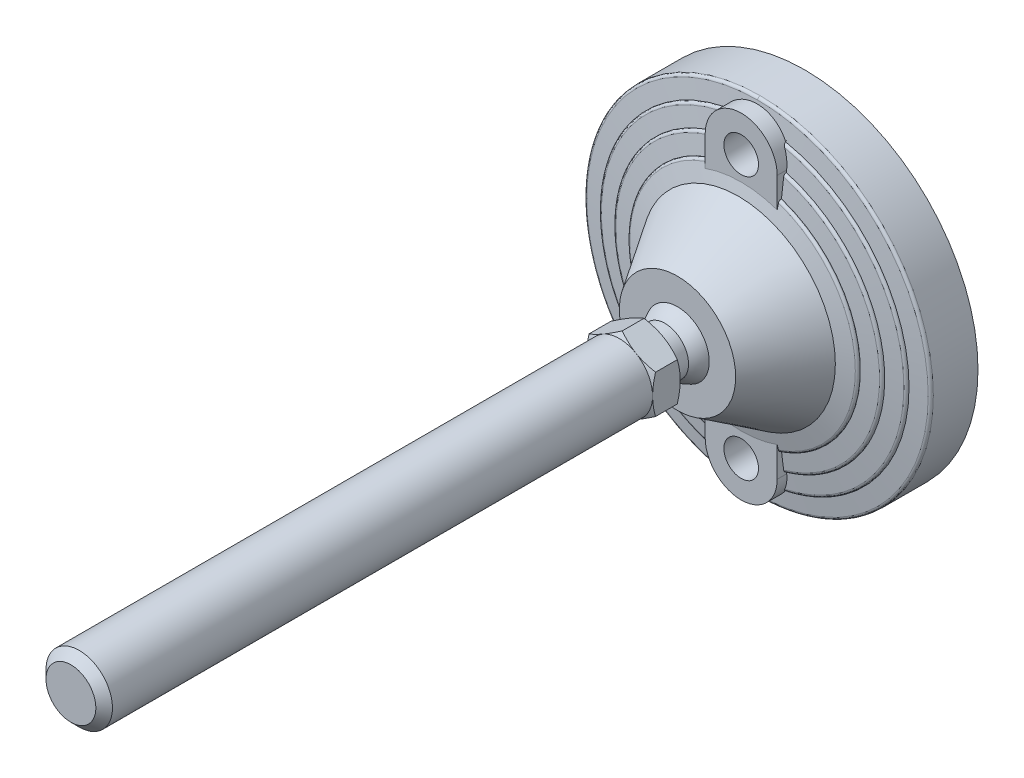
ISO-10303-21;
HEADER;
FILE_DESCRIPTION(('STEP AP214'),'2;1');
FILE_NAME('part.step','',(''),(''),'','','');
FILE_SCHEMA(('AUTOMOTIVE_DESIGN { 1 0 10303 214 1 1 1 1 }'));
ENDSEC;
DATA;
#1=APPLICATION_CONTEXT('core data for automotive mechanical design processes');
#2=APPLICATION_PROTOCOL_DEFINITION('international standard','automotive_design',2000,#1);
#3=PRODUCT_CONTEXT('',#1,'mechanical');
#4=PRODUCT('Part','Part','',(#3));
#5=PRODUCT_RELATED_PRODUCT_CATEGORY('part','',(#4));
#6=PRODUCT_DEFINITION_FORMATION('','',#4);
#7=PRODUCT_DEFINITION_CONTEXT('part definition',#1,'design');
#8=PRODUCT_DEFINITION('design','',#6,#7);
#9=PRODUCT_DEFINITION_SHAPE('','',#8);
#10=(LENGTH_UNIT() NAMED_UNIT(*) SI_UNIT(.MILLI.,.METRE.));
#11=(NAMED_UNIT(*) PLANE_ANGLE_UNIT() SI_UNIT($,.RADIAN.));
#12=(NAMED_UNIT(*) SI_UNIT($,.STERADIAN.) SOLID_ANGLE_UNIT());
#13=UNCERTAINTY_MEASURE_WITH_UNIT(LENGTH_MEASURE(1.E-05),#10,'distance_accuracy_value','');
#14=(GEOMETRIC_REPRESENTATION_CONTEXT(3) GLOBAL_UNCERTAINTY_ASSIGNED_CONTEXT((#13)) GLOBAL_UNIT_ASSIGNED_CONTEXT((#10,
#11,#12)) REPRESENTATION_CONTEXT('',''));
#15=CARTESIAN_POINT('',(0.,0.,0.));
#16=DIRECTION('',(0.,0.,1.));
#17=DIRECTION('',(1.,0.,0.));
#18=AXIS2_PLACEMENT_3D('',#15,#16,#17);
#19=CARTESIAN_POINT('',(-12.,14.022683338,60.));
#20=DIRECTION('',(0.,0.,1.));
#21=DIRECTION('',(0.,-1.,0.));
#22=AXIS2_PLACEMENT_3D('',#19,#20,#21);
#23=PLANE('',#22);
#24=CARTESIAN_POINT('',(0.,0.,60.));
#25=DIRECTION('',(0.,0.,-1.));
#26=DIRECTION('',(1.,0.,0.));
#27=AXIS2_PLACEMENT_3D('',#24,#25,#26);
#28=CIRCLE('',#27,8.5);
#29=CARTESIAN_POINT('',(8.5,0.,60.));
#30=VERTEX_POINT('',#29);
#31=EDGE_CURVE('E559',#30,#30,#28,.T.);
#32=ORIENTED_EDGE('',*,*,#31,.F.);
#33=EDGE_LOOP('',(#32));
#34=FACE_BOUND('',#33,.T.);
#35=CARTESIAN_POINT('',(0.,0.,60.));
#36=DIRECTION('',(0.,0.,1.));
#37=DIRECTION('',(0.,-1.,0.));
#38=AXIS2_PLACEMENT_3D('',#35,#36,#37);
#39=CIRCLE('',#38,12.);
#40=CARTESIAN_POINT('',(6.00000000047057,-10.3923048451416,60.));
#41=VERTEX_POINT('',#40);
#42=CARTESIAN_POINT('',(-6.00000000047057,-10.3923048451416,60.));
#43=VERTEX_POINT('',#42);
#44=EDGE_CURVE('E26',#41,#43,#39,.F.);
#45=ORIENTED_EDGE('',*,*,#44,.T.);
#46=CARTESIAN_POINT('',(-12.,0.,60.));
#47=VERTEX_POINT('',#46);
#48=EDGE_CURVE('E9',#43,#47,#39,.F.);
#49=ORIENTED_EDGE('',*,*,#48,.T.);
#50=CARTESIAN_POINT('',(-6.00000000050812,10.3923048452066,60.));
#51=VERTEX_POINT('',#50);
#52=EDGE_CURVE('E25',#47,#51,#39,.F.);
#53=ORIENTED_EDGE('',*,*,#52,.T.);
#54=CARTESIAN_POINT('',(6.00000000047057,10.3923048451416,60.));
#55=VERTEX_POINT('',#54);
#56=EDGE_CURVE('E239',#51,#55,#39,.F.);
#57=ORIENTED_EDGE('',*,*,#56,.T.);
#58=CARTESIAN_POINT('',(0.,0.,60.));
#59=DIRECTION('',(0.,0.,-1.));
#60=DIRECTION('',(0.,1.,0.));
#61=AXIS2_PLACEMENT_3D('',#58,#59,#60);
#62=CIRCLE('',#61,12.);
#63=CARTESIAN_POINT('',(12.,0.,60.));
#64=VERTEX_POINT('',#63);
#65=EDGE_CURVE('E253',#55,#64,#62,.T.);
#66=ORIENTED_EDGE('',*,*,#65,.T.);
#67=EDGE_CURVE('E263',#64,#41,#39,.F.);
#68=ORIENTED_EDGE('',*,*,#67,.T.);
#69=EDGE_LOOP('',(#45,#49,#53,#57,#66,#68));
#70=FACE_BOUND('',#69,.T.);
#71=ADVANCED_FACE('F14',(#34,#70),#23,.F.);
#72=CARTESIAN_POINT('',(-55.851524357,55.66,0.));
#73=DIRECTION('',(0.,0.,1.));
#74=DIRECTION('',(0.,-1.,0.));
#75=AXIS2_PLACEMENT_3D('',#72,#73,#74);
#76=PLANE('',#75);
#77=CARTESIAN_POINT('',(0.,0.,0.));
#78=DIRECTION('',(0.,0.,-1.));
#79=DIRECTION('',(0.,1.,0.));
#80=AXIS2_PLACEMENT_3D('',#77,#78,#79);
#81=CIRCLE('',#80,55.);
#82=CARTESIAN_POINT('',(0.,55.,0.));
#83=VERTEX_POINT('',#82);
#84=EDGE_CURVE('E556',#83,#83,#81,.F.);
#85=ORIENTED_EDGE('',*,*,#84,.F.);
#86=EDGE_LOOP('',(#85));
#87=FACE_BOUND('',#86,.T.);
#88=ADVANCED_FACE('F1286',(#87),#76,.F.);
#89=CARTESIAN_POINT('',(0.,0.,60.));
#90=DIRECTION('',(0.,0.,-1.));
#91=DIRECTION('',(1.,0.,0.));
#92=AXIS2_PLACEMENT_3D('',#89,#90,#91);
#93=CYLINDRICAL_SURFACE('',#92,8.5);
#94=ORIENTED_EDGE('',*,*,#31,.T.);
#95=EDGE_LOOP('',(#94));
#96=FACE_BOUND('',#95,.T.);
#97=CARTESIAN_POINT('',(0.,0.,53.5000000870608));
#98=DIRECTION('',(0.,0.,-1.));
#99=DIRECTION('',(-1.,0.,0.));
#100=AXIS2_PLACEMENT_3D('',#97,#98,#99);
#101=CIRCLE('',#100,8.49999990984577);
#102=CARTESIAN_POINT('',(-8.49999990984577,0.,53.5000000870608));
#103=VERTEX_POINT('',#102);
#104=EDGE_CURVE('E555',#103,#103,#101,.T.);
#105=ORIENTED_EDGE('',*,*,#104,.F.);
#106=EDGE_LOOP('',(#105));
#107=FACE_BOUND('',#106,.T.);
#108=ADVANCED_FACE('F1296',(#96,#107),#93,.T.);
#109=CARTESIAN_POINT('',(0.,0.,3.));
#110=DIRECTION('',(0.,0.,-1.));
#111=DIRECTION('',(0.,1.,0.));
#112=AXIS2_PLACEMENT_3D('',#109,#110,#111);
#113=CYLINDRICAL_SURFACE('',#112,55.);
#114=ORIENTED_EDGE('',*,*,#84,.T.);
#115=EDGE_LOOP('',(#114));
#116=FACE_BOUND('',#115,.T.);
#117=CARTESIAN_POINT('',(0.,0.,3.));
#118=DIRECTION('',(0.,0.,-1.));
#119=DIRECTION('',(0.,1.,0.));
#120=AXIS2_PLACEMENT_3D('',#117,#118,#119);
#121=CIRCLE('',#120,55.);
#122=CARTESIAN_POINT('',(0.,55.,3.));
#123=VERTEX_POINT('',#122);
#124=EDGE_CURVE('E552',#123,#123,#121,.T.);
#125=ORIENTED_EDGE('',*,*,#124,.T.);
#126=EDGE_LOOP('',(#125));
#127=FACE_BOUND('',#126,.T.);
#128=ADVANCED_FACE('F371',(#116,#127),#113,.T.);
#129=CARTESIAN_POINT('',(0.,0.,44.678860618));
#130=DIRECTION('',(0.,0.,-1.));
#131=DIRECTION('',(1.,0.,0.));
#132=AXIS2_PLACEMENT_3D('',#129,#130,#131);
#133=SPHERICAL_SURFACE('',#132,12.25);
#134=CARTESIAN_POINT('',(0.,0.,49.));
#135=DIRECTION('',(0.,0.,-1.));
#136=DIRECTION('',(0.,1.,0.));
#137=AXIS2_PLACEMENT_3D('',#134,#135,#136);
#138=CIRCLE('',#137,11.4625588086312);
#139=CARTESIAN_POINT('',(0.,11.4625588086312,49.));
#140=VERTEX_POINT('',#139);
#141=EDGE_CURVE('E549',#140,#140,#138,.F.);
#142=ORIENTED_EDGE('',*,*,#141,.T.);
#143=EDGE_LOOP('',(#142));
#144=FACE_BOUND('',#143,.T.);
#145=ORIENTED_EDGE('',*,*,#104,.T.);
#146=EDGE_LOOP('',(#145));
#147=FACE_BOUND('',#146,.T.);
#148=ADVANCED_FACE('F366',(#144,#147),#133,.T.);
#149=CARTESIAN_POINT('',(-6.346764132,-41.175,3.));
#150=DIRECTION('',(0.,0.,1.));
#151=DIRECTION('',(0.,-1.,0.));
#152=AXIS2_PLACEMENT_3D('',#149,#150,#151);
#153=PLANE('',#152);
#154=CARTESIAN_POINT('',(0.,-47.5,3.));
#155=DIRECTION('',(0.,0.,1.));
#156=DIRECTION('',(0.,-1.,0.));
#157=AXIS2_PLACEMENT_3D('',#154,#155,#156);
#158=CIRCLE('',#157,6.25);
#159=CARTESIAN_POINT('',(0.,-53.75,3.));
#160=VERTEX_POINT('',#159);
#161=EDGE_CURVE('E545',#160,#160,#158,.T.);
#162=ORIENTED_EDGE('',*,*,#161,.T.);
#163=EDGE_LOOP('',(#162));
#164=FACE_BOUND('',#163,.T.);
#165=ADVANCED_FACE('F370',(#164),#153,.T.);
#166=CARTESIAN_POINT('',(-63.467641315,63.25,3.));
#167=DIRECTION('',(0.,0.,1.));
#168=DIRECTION('',(0.,-1.,0.));
#169=AXIS2_PLACEMENT_3D('',#166,#167,#168);
#170=PLANE('',#169);
#171=ORIENTED_EDGE('',*,*,#124,.F.);
#172=EDGE_LOOP('',(#171));
#173=FACE_BOUND('',#172,.T.);
#174=CARTESIAN_POINT('',(0.,0.,3.));
#175=DIRECTION('',(0.,0.,-1.));
#176=DIRECTION('',(0.,1.,0.));
#177=AXIS2_PLACEMENT_3D('',#174,#175,#176);
#178=CIRCLE('',#177,62.5);
#179=CARTESIAN_POINT('',(0.,62.5,3.));
#180=VERTEX_POINT('',#179);
#181=EDGE_CURVE('E541',#180,#180,#178,.F.);
#182=ORIENTED_EDGE('',*,*,#181,.F.);
#183=EDGE_LOOP('',(#182));
#184=FACE_BOUND('',#183,.T.);
#185=ADVANCED_FACE('F763',(#173,#184),#170,.F.);
#186=CARTESIAN_POINT('',(-21.325127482,-21.252,49.));
#187=DIRECTION('',(0.,0.,-1.));
#188=DIRECTION('',(0.,1.,0.));
#189=AXIS2_PLACEMENT_3D('',#186,#187,#188);
#190=PLANE('',#189);
#191=ORIENTED_EDGE('',*,*,#141,.F.);
#192=EDGE_LOOP('',(#191));
#193=FACE_BOUND('',#192,.T.);
#194=CARTESIAN_POINT('',(0.,0.,49.));
#195=DIRECTION('',(0.,0.,-1.));
#196=DIRECTION('',(1.,0.,0.));
#197=AXIS2_PLACEMENT_3D('',#194,#195,#196);
#198=CIRCLE('',#197,21.);
#199=CARTESIAN_POINT('',(21.,0.,49.));
#200=VERTEX_POINT('',#199);
#201=EDGE_CURVE('E413',#200,#200,#198,.T.);
#202=ORIENTED_EDGE('',*,*,#201,.F.);
#203=EDGE_LOOP('',(#202));
#204=FACE_BOUND('',#203,.T.);
#205=ADVANCED_FACE('F378',(#193,#204),#190,.F.);
#206=CARTESIAN_POINT('',(0.,-47.5,3.));
#207=DIRECTION('',(0.,0.,1.));
#208=DIRECTION('',(0.,-1.,0.));
#209=AXIS2_PLACEMENT_3D('',#206,#207,#208);
#210=CYLINDRICAL_SURFACE('',#209,6.25);
#211=ORIENTED_EDGE('',*,*,#161,.F.);
#212=EDGE_LOOP('',(#211));
#213=FACE_BOUND('',#212,.T.);
#214=CARTESIAN_POINT('',(0.,-47.5,26.));
#215=DIRECTION('',(0.,0.,1.));
#216=DIRECTION('',(0.,-1.,0.));
#217=AXIS2_PLACEMENT_3D('',#214,#215,#216);
#218=CIRCLE('',#217,6.25);
#219=CARTESIAN_POINT('',(0.,-53.75,26.));
#220=VERTEX_POINT('',#219);
#221=EDGE_CURVE('E749',#220,#220,#218,.T.);
#222=ORIENTED_EDGE('',*,*,#221,.T.);
#223=EDGE_LOOP('',(#222));
#224=FACE_BOUND('',#223,.T.);
#225=ADVANCED_FACE('F374',(#213,#224),#210,.F.);
#226=CARTESIAN_POINT('',(-6.346764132,53.825,3.));
#227=DIRECTION('',(0.,0.,1.));
#228=DIRECTION('',(0.,-1.,0.));
#229=AXIS2_PLACEMENT_3D('',#226,#227,#228);
#230=PLANE('',#229);
#231=CARTESIAN_POINT('',(0.,47.5,3.));
#232=DIRECTION('',(0.,0.,1.));
#233=DIRECTION('',(0.,-1.,0.));
#234=AXIS2_PLACEMENT_3D('',#231,#232,#233);
#235=CIRCLE('',#234,6.25);
#236=CARTESIAN_POINT('',(0.,41.25,3.));
#237=VERTEX_POINT('',#236);
#238=EDGE_CURVE('E607',#237,#237,#235,.T.);
#239=ORIENTED_EDGE('',*,*,#238,.T.);
#240=EDGE_LOOP('',(#239));
#241=FACE_BOUND('',#240,.T.);
#242=ADVANCED_FACE('F377',(#241),#230,.T.);
#243=CARTESIAN_POINT('',(12.406354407,39.602176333,24.568111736));
#244=CARTESIAN_POINT('',(59.707464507,24.78394183,24.568111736));
#245=CARTESIAN_POINT('',(59.707464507,-24.78394183,24.568111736));
#246=CARTESIAN_POINT('',(12.406354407,-39.602176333,24.568111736));
#247=CARTESIAN_POINT('',(12.406354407,39.602176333,25.044046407));
#248=CARTESIAN_POINT('',(59.707464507,24.78394183,25.044046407));
#249=CARTESIAN_POINT('',(59.707464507,-24.78394183,25.044046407));
#250=CARTESIAN_POINT('',(12.406354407,-39.602176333,25.044046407));
#251=CARTESIAN_POINT('',(12.31903347,39.323440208,25.419805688));
#252=CARTESIAN_POINT('',(59.287219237,24.609502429,25.419805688));
#253=CARTESIAN_POINT('',(59.287219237,-24.609502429,25.419805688));
#254=CARTESIAN_POINT('',(12.31903347,-39.323440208,25.419805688));
#255=CARTESIAN_POINT('',(12.18115046,38.883305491,25.53720891));
#256=CARTESIAN_POINT('',(58.623636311,24.334056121,25.53720891));
#257=CARTESIAN_POINT('',(58.623636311,-24.334056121,25.53720891));
#258=CARTESIAN_POINT('',(12.18115046,-38.883305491,25.53720891));
#259=(BOUNDED_SURFACE() B_SPLINE_SURFACE(3,3,((#243,#244,#245,#246),(#247,#248,#249,#250),(#251,
#252,#253,#254),(#255,#256,#257,#258)),.UNSPECIFIED.,.F.,.F.,
.F.) B_SPLINE_SURFACE_WITH_KNOTS((4,4),(4,4),(0.,1.),(0.,1.),
.UNSPECIFIED.) GEOMETRIC_REPRESENTATION_ITEM() RATIONAL_B_SPLINE_SURFACE(((1.,0.532632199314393,
0.532632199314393,1.),(0.859679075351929,0.457892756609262,0.457892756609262,0.859679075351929),
(0.859679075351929,0.457892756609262,0.457892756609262,0.859679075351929),(1.,0.532632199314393,
0.532632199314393,1.))) REPRESENTATION_ITEM('') SURFACE());
#260=CARTESIAN_POINT('',(0.,0.,25.5372089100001));
#261=DIRECTION('',(0.,0.,-1.));
#262=DIRECTION('',(0.,1.,0.));
#263=AXIS2_PLACEMENT_3D('',#260,#261,#262);
#264=CIRCLE('',#263,40.746679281);
#265=CARTESIAN_POINT('',(13.,-38.6172483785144,25.537208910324));
#266=VERTEX_POINT('',#265);
#267=CARTESIAN_POINT('',(13.,38.6172483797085,25.5372089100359));
#268=VERTEX_POINT('',#267);
#269=EDGE_CURVE('E742',#266,#268,#264,.F.);
#270=CARTESIAN_POINT('',(13.,-39.4112927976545,24.5681117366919));
#271=CARTESIAN_POINT('',(13.,-39.4112933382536,24.59521048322));
#272=CARTESIAN_POINT('',(13.,-39.4101321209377,24.6222958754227));
#273=CARTESIAN_POINT('',(13.,-39.405504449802,24.6762650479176));
#274=CARTESIAN_POINT('',(13.,-39.4020383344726,24.7031488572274));
#275=CARTESIAN_POINT('',(13.,-39.3882336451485,24.7831079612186));
#276=CARTESIAN_POINT('',(13.,-39.3744885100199,24.8356344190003));
#277=CARTESIAN_POINT('',(13.,-39.3384084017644,24.937608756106));
#278=CARTESIAN_POINT('',(13.,-39.3160736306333,24.9870567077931));
#279=CARTESIAN_POINT('',(13.,-39.2635909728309,25.0816017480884));
#280=CARTESIAN_POINT('',(13.,-39.233444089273,25.1266993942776));
#281=CARTESIAN_POINT('',(13.,-39.1656058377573,25.2123360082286));
#282=CARTESIAN_POINT('',(13.,-39.1277714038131,25.2527614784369));
#283=CARTESIAN_POINT('',(13.,-39.0461074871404,25.327071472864));
#284=CARTESIAN_POINT('',(13.,-39.0022718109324,25.3609491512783));
#285=CARTESIAN_POINT('',(13.,-38.9043172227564,25.4250520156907));
#286=CARTESIAN_POINT('',(13.,-38.8495953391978,25.454364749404));
#287=CARTESIAN_POINT('',(13.,-38.7644641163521,25.4909906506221));
#288=CARTESIAN_POINT('',(13.,-38.7355751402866,25.5019763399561));
#289=CARTESIAN_POINT('',(13.,-38.6769796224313,25.5214626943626));
#290=CARTESIAN_POINT('',(13.,-38.6472733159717,25.5299640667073));
#291=CARTESIAN_POINT('',(13.,-38.6172483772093,25.5372089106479));
#292=B_SPLINE_CURVE_WITH_KNOTS('',3,(#270,#271,#272,#273,#274,#275,#276,#277,#278,#279,#280,
#281,#282,#283,#284,#285,#286,#287,#288,#289,#290,#291),.UNSPECIFIED.,.F.,.F.,(4,2,2,2,2,2,2,2,
2,2,4),(0.,0.0812450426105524,0.162478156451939,0.324519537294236,0.486557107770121,
0.648573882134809,0.813939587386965,0.979477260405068,1.16468654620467,1.25731455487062,
1.34991616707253),.UNSPECIFIED.);
#293=CARTESIAN_POINT('',(13.,-39.4112927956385,24.568111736));
#294=VERTEX_POINT('',#293);
#295=EDGE_CURVE('E405',#294,#266,#292,.T.);
#296=CARTESIAN_POINT('',(0.,0.,24.568111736));
#297=DIRECTION('',(0.,0.,-1.));
#298=DIRECTION('',(0.,1.,0.));
#299=AXIS2_PLACEMENT_3D('',#296,#297,#298);
#300=CIRCLE('',#299,41.5);
#301=CARTESIAN_POINT('',(13.,39.4112927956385,24.5681117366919));
#302=VERTEX_POINT('',#301);
#303=EDGE_CURVE('E548',#302,#294,#300,.T.);
#304=CARTESIAN_POINT('',(13.,38.6172483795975,25.5372089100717));
#305=CARTESIAN_POINT('',(13.,38.6757273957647,25.5231434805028));
#306=CARTESIAN_POINT('',(13.,38.7330575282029,25.5042077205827));
#307=CARTESIAN_POINT('',(13.,38.843898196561,25.4570874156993));
#308=CARTESIAN_POINT('',(13.,38.8974017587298,25.4288864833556));
#309=CARTESIAN_POINT('',(13.,38.9989209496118,25.3637346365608));
#310=CARTESIAN_POINT('',(13.,39.0469285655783,25.3267711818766));
#311=CARTESIAN_POINT('',(13.,39.1357078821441,25.2450475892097));
#312=CARTESIAN_POINT('',(13.,39.1764870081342,25.2002955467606));
#313=CARTESIAN_POINT('',(13.,39.2479885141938,25.1059931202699));
#314=CARTESIAN_POINT('',(13.,39.2790300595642,25.0566848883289));
#315=CARTESIAN_POINT('',(13.,39.3318958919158,24.9533393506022));
#316=CARTESIAN_POINT('',(13.,39.3537228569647,24.8993034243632));
#317=CARTESIAN_POINT('',(13.,39.3839717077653,24.7991363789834));
#318=CARTESIAN_POINT('',(13.,39.3941848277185,24.7535382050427));
#319=CARTESIAN_POINT('',(13.,39.4078594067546,24.6613400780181));
#320=CARTESIAN_POINT('',(13.,39.411320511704,24.6147400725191));
#321=CARTESIAN_POINT('',(13.,39.4112927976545,24.5681117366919));
#322=B_SPLINE_CURVE_WITH_KNOTS('',3,(#304,#305,#306,#307,#308,#309,#310,#311,#312,#313,#314,
#315,#316,#317,#318,#319,#320,#321),.UNSPECIFIED.,.F.,.F.,(4,2,2,2,2,2,2,2,4),(0.,
0.180276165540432,0.360872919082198,0.541729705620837,0.722399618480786,0.896310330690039,
1.07017046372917,1.20986980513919,1.34957647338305),.UNSPECIFIED.);
#323=EDGE_CURVE('E396',#268,#302,#322,.T.);
#324=ORIENTED_EDGE('',*,*,#269,.F.);
#325=ORIENTED_EDGE('',*,*,#295,.F.);
#326=ORIENTED_EDGE('',*,*,#303,.F.);
#327=ORIENTED_EDGE('',*,*,#323,.F.);
#328=EDGE_LOOP('',(#324,#325,#326,#327));
#329=FACE_BOUND('',#328,.T.);
#330=ADVANCED_FACE('F380',(#329),#259,.T.);
#331=CARTESIAN_POINT('',(0.,0.,24.568111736));
#332=DIRECTION('',(0.,0.,-1.));
#333=DIRECTION('',(0.,1.,0.));
#334=AXIS2_PLACEMENT_3D('',#331,#332,#333);
#335=CYLINDRICAL_SURFACE('',#334,41.5);
#336=CARTESIAN_POINT('',(0.,0.,24.454545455));
#337=DIRECTION('',(0.,0.,-1.));
#338=DIRECTION('',(0.,1.,0.));
#339=AXIS2_PLACEMENT_3D('',#336,#337,#338);
#340=CIRCLE('',#339,41.5);
#341=CARTESIAN_POINT('',(13.,39.4112927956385,24.454545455));
#342=VERTEX_POINT('',#341);
#343=CARTESIAN_POINT('',(13.,-39.4112927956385,24.4545454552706));
#344=VERTEX_POINT('',#343);
#345=EDGE_CURVE('E740',#342,#344,#340,.T.);
#346=ORIENTED_EDGE('',*,*,#345,.F.);
#347=DIRECTION('',(0.,0.,-1.));
#348=VECTOR('',#347,1.);
#349=CARTESIAN_POINT('',(13.,39.4112927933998,24.2785712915));
#350=LINE('',#349,#348);
#351=EDGE_CURVE('E632',#302,#342,#350,.T.);
#352=ORIENTED_EDGE('',*,*,#351,.F.);
#353=ORIENTED_EDGE('',*,*,#303,.T.);
#354=DIRECTION('',(0.,0.,1.));
#355=VECTOR('',#354,1.);
#356=CARTESIAN_POINT('',(13.,-39.4112927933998,24.2785712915));
#357=LINE('',#356,#355);
#358=EDGE_CURVE('E414',#344,#294,#357,.T.);
#359=ORIENTED_EDGE('',*,*,#358,.F.);
#360=EDGE_LOOP('',(#346,#352,#353,#359));
#361=FACE_BOUND('',#360,.T.);
#362=ADVANCED_FACE('F386',(#361),#335,.T.);
#363=CARTESIAN_POINT('',(0.,0.,24.454545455));
#364=DIRECTION('',(0.,0.,-1.));
#365=DIRECTION('',(0.,1.,0.));
#366=AXIS2_PLACEMENT_3D('',#363,#364,#365);
#367=CONICAL_SURFACE('',#366,41.5,1.4442041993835);
#368=ORIENTED_EDGE('',*,*,#345,.T.);
#369=CARTESIAN_POINT('',(13.0000000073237,-45.8176832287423,23.6748403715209));
#370=CARTESIAN_POINT('',(13.0000000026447,-45.2838642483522,23.7402005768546));
#371=CARTESIAN_POINT('',(13.000000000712,-44.7500350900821,23.8054777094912));
#372=CARTESIAN_POINT('',(12.999999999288,-43.6823542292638,23.9358466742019));
#373=CARTESIAN_POINT('',(12.9999999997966,-43.1485025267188,24.0009385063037));
#374=CARTESIAN_POINT('',(13.0000000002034,-42.0807742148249,24.1309177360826));
#375=CARTESIAN_POINT('',(13.0000000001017,-41.5468976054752,24.195805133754));
#376=CARTESIAN_POINT('',(12.9999999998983,-40.4791166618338,24.3253520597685));
#377=CARTESIAN_POINT('',(12.9999999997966,-39.9452123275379,24.3900115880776));
#378=CARTESIAN_POINT('',(13.,-39.4112927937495,24.4545454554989));
#379=B_SPLINE_CURVE_WITH_KNOTS('',3,(#369,#370,#371,#372,#373,#374,#375,#376,#377,#378),
.UNSPECIFIED.,.F.,.F.,(4,2,2,2,4),(0.,1.61341623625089,3.22683223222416,4.84024827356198,
6.4536645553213),.UNSPECIFIED.);
#380=CARTESIAN_POINT('',(13.,-45.8176832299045,23.674840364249));
#381=VERTEX_POINT('',#380);
#382=EDGE_CURVE('E416',#381,#344,#379,.T.);
#383=ORIENTED_EDGE('',*,*,#382,.F.);
#384=CARTESIAN_POINT('',(-7.48558333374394E-10,0.,23.674840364));
#385=DIRECTION('',(0.,0.,-1.));
#386=DIRECTION('',(0.,1.,0.));
#387=AXIS2_PLACEMENT_3D('',#384,#385,#386);
#388=CIRCLE('',#387,47.6262542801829);
#389=CARTESIAN_POINT('',(13.,45.8176832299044,23.6748403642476));
#390=VERTEX_POINT('',#389);
#391=EDGE_CURVE('E363',#390,#381,#388,.T.);
#392=ORIENTED_EDGE('',*,*,#391,.F.);
#393=CARTESIAN_POINT('',(13.,39.4112927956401,24.4545454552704));
#394=CARTESIAN_POINT('',(13.,39.9452123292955,24.3900115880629));
#395=CARTESIAN_POINT('',(13.,40.4791166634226,24.3253520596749));
#396=CARTESIAN_POINT('',(13.,41.5468976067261,24.195805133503));
#397=CARTESIAN_POINT('',(13.,42.0807742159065,24.1309177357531));
#398=CARTESIAN_POINT('',(13.,43.1485025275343,24.0009385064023));
#399=CARTESIAN_POINT('',(13.,43.6823542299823,23.9358466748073));
#400=CARTESIAN_POINT('',(13.,44.7500350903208,23.805477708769));
#401=CARTESIAN_POINT('',(13.,45.283864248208,23.7402005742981));
#402=CARTESIAN_POINT('',(13.,45.8176832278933,23.6748403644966));
#403=B_SPLINE_CURVE_WITH_KNOTS('',3,(#393,#394,#395,#396,#397,#398,#399,#400,#401,#402),
.UNSPECIFIED.,.F.,.F.,(4,2,2,2,4),(0.,1.61341628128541,3.22683232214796,4.84024831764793,
6.45366455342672),.UNSPECIFIED.);
#404=EDGE_CURVE('E626',#342,#390,#403,.T.);
#405=ORIENTED_EDGE('',*,*,#404,.F.);
#406=EDGE_LOOP('',(#368,#383,#392,#405));
#407=FACE_BOUND('',#406,.T.);
#408=ADVANCED_FACE('F516',(#407),#367,.T.);
#409=CARTESIAN_POINT('',(12.269850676,46.922284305,22.669623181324));
#410=CARTESIAN_POINT('',(72.557631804,31.157449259,22.6696231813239));
#411=CARTESIAN_POINT('',(72.557631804,-31.157449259,22.6696231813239));
#412=CARTESIAN_POINT('',(12.269850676,-46.922284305,22.669623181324));
#413=CARTESIAN_POINT('',(12.269850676,46.922284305,22.6740296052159));
#414=CARTESIAN_POINT('',(72.557631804,31.157449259,22.674029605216));
#415=CARTESIAN_POINT('',(72.557631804,-31.157449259,22.674029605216));
#416=CARTESIAN_POINT('',(12.269850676,-46.922284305,22.6740296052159));
#417=CARTESIAN_POINT('',(12.269850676,46.922284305,22.678436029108));
#418=CARTESIAN_POINT('',(72.557631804,31.157449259,22.678436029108));
#419=CARTESIAN_POINT('',(72.557631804,-31.157449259,22.678436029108));
#420=CARTESIAN_POINT('',(12.269850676,-46.922284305,22.678436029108));
#421=CARTESIAN_POINT('',(12.269850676,46.922284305,22.682842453));
#422=CARTESIAN_POINT('',(72.557631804,31.157449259,22.682842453));
#423=CARTESIAN_POINT('',(72.557631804,-31.157449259,22.682842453));
#424=CARTESIAN_POINT('',(12.269850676,-46.922284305,22.682842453));
#425=CARTESIAN_POINT('',(12.269850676,46.922284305,23.211436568));
#426=CARTESIAN_POINT('',(72.557631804,31.157449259,23.211436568));
#427=CARTESIAN_POINT('',(72.557631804,-31.157449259,23.211436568));
#428=CARTESIAN_POINT('',(12.269850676,-46.922284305,23.211436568));
#429=CARTESIAN_POINT('',(12.181461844,46.584268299,23.608103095));
#430=CARTESIAN_POINT('',(72.034945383,30.93299905,23.608103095));
#431=CARTESIAN_POINT('',(72.034945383,-30.93299905,23.608103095));
#432=CARTESIAN_POINT('',(12.181461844,-46.584268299,23.608103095));
#433=CARTESIAN_POINT('',(12.048804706,46.076961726,23.674840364));
#434=CARTESIAN_POINT('',(71.250478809,30.596136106,23.674840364));
#435=CARTESIAN_POINT('',(71.250478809,-30.596136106,23.674840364));
#436=CARTESIAN_POINT('',(12.048804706,-46.076961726,23.674840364));
#437=(BOUNDED_SURFACE() B_SPLINE_SURFACE(3,3,((#409,#410,#411,#412),(#413,#414,#415,#416),(#417,
#418,#419,#420),(#421,#422,#423,#424),(#425,#426,#427,#428),(#429,#430,#431,#432),(#433,#434,
#435,#436)),.UNSPECIFIED.,.F.,.F.,.F.) B_SPLINE_SURFACE_WITH_KNOTS((4,3,4),(4,4),(-0.01,0.,1.),
(0.,1.),.UNSPECIFIED.) GEOMETRIC_REPRESENTATION_ITEM() RATIONAL_B_SPLINE_SURFACE(((1.,
0.501991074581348,0.501991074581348,1.),(1.,0.501991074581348,0.501991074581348,1.),(1.,
0.501991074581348,0.501991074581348,1.),(1.,0.501991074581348,0.501991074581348,1.),
(0.833611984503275,0.418465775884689,0.418465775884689,0.833611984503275),(0.833611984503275,
0.418465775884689,0.418465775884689,0.833611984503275),(1.,0.501991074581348,0.501991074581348,1.))) REPRESENTATION_ITEM('') SURFACE());
#438=CARTESIAN_POINT('',(13.,-46.7252608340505,22.6777848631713));
#439=CARTESIAN_POINT('',(13.,-46.7253979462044,22.7054287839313));
#440=CARTESIAN_POINT('',(13.,-46.7243484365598,22.7330653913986));
#441=CARTESIAN_POINT('',(13.,-46.7198870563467,22.7881439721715));
#442=CARTESIAN_POINT('',(13.,-46.7164754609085,22.815585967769));
#443=CARTESIAN_POINT('',(13.,-46.7027375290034,22.8972169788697));
#444=CARTESIAN_POINT('',(13.,-46.6889086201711,22.9508576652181));
#445=CARTESIAN_POINT('',(13.,-46.6523707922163,23.0550506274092));
#446=CARTESIAN_POINT('',(13.,-46.6296523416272,23.105599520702));
#447=CARTESIAN_POINT('',(13.,-46.5760978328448,23.2021956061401));
#448=CARTESIAN_POINT('',(13.,-46.5452617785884,23.2482428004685));
#449=CARTESIAN_POINT('',(13.,-46.4762858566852,23.3348542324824));
#450=CARTESIAN_POINT('',(13.,-46.4381108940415,23.375390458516));
#451=CARTESIAN_POINT('',(13.,-46.3556866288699,23.4497572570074));
#452=CARTESIAN_POINT('',(13.,-46.3114344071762,23.483584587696));
#453=CARTESIAN_POINT('',(13.,-46.2164675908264,23.5448274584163));
#454=CARTESIAN_POINT('',(13.,-46.165579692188,23.5719736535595));
#455=CARTESIAN_POINT('',(13.,-46.0601083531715,23.6176355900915));
#456=CARTESIAN_POINT('',(13.,-46.0055288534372,23.6361603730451));
#457=CARTESIAN_POINT('',(13.,-45.9281089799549,23.6556819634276));
#458=CARTESIAN_POINT('',(13.,-45.9061721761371,23.6604842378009));
#459=CARTESIAN_POINT('',(13.,-45.8620822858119,23.6686997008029));
#460=CARTESIAN_POINT('',(13.,-45.8399296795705,23.6721154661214));
#461=CARTESIAN_POINT('',(13.0000000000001,-45.817683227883,23.6748403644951));
#462=B_SPLINE_CURVE_WITH_KNOTS('',3,(#438,#439,#440,#441,#442,#443,#444,#445,#446,#447,#448,
#449,#450,#451,#452,#453,#454,#455,#456,#457,#458,#459,#460,#461),.UNSPECIFIED.,.F.,.F.,(4,2,2,
2,2,2,2,2,2,2,2,4),(0.,0.0828810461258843,0.165752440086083,0.331061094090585,0.49654748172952,
0.66203378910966,0.828332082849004,0.994710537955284,1.16697834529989,1.3390650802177,
1.40639957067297,1.47360834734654),.UNSPECIFIED.);
#463=CARTESIAN_POINT('',(13.0000000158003,-46.7252608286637,22.6777848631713));
#464=VERTEX_POINT('',#463);
#465=EDGE_CURVE('E540',#464,#381,#462,.T.);
#466=CARTESIAN_POINT('',(13.0000000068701,46.7252608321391,22.6727272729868));
#467=CARTESIAN_POINT('',(13.3212147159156,46.635891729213,22.6727272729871));
#468=CARTESIAN_POINT('',(13.6414983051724,46.5432129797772,22.6727272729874));
#469=CARTESIAN_POINT('',(14.2801231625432,46.3512597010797,22.672727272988));
#470=CARTESIAN_POINT('',(14.59846420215,46.2519844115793,22.6727272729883));
#471=CARTESIAN_POINT('',(15.5526106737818,45.9435979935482,22.6727272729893));
#472=CARTESIAN_POINT('',(16.1852411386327,45.7245656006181,22.6727272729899));
#473=CARTESIAN_POINT('',(17.4409289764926,45.2604918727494,22.6727272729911));
#474=CARTESIAN_POINT('',(18.063985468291,45.01544815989,22.6727272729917));
#475=CARTESIAN_POINT('',(19.3000708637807,44.4995075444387,22.672727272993));
#476=CARTESIAN_POINT('',(19.9130888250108,44.228584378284,22.6727272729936));
#477=CARTESIAN_POINT('',(21.1274202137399,43.6615551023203,22.6727272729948));
#478=CARTESIAN_POINT('',(21.7287319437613,43.3654453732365,22.6727272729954));
#479=CARTESIAN_POINT('',(23.5288179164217,42.4321391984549,22.6727272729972));
#480=CARTESIAN_POINT('',(24.7079785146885,41.7565378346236,22.6727272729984));
#481=CARTESIAN_POINT('',(27.005751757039,40.308619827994,22.6727272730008));
#482=CARTESIAN_POINT('',(28.124340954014,39.5362661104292,22.672727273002));
#483=CARTESIAN_POINT('',(30.2940548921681,37.8994558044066,22.6727272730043));
#484=CARTESIAN_POINT('',(31.3451007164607,37.0348945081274,22.6727272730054));
#485=CARTESIAN_POINT('',(33.3707378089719,35.2206260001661,22.6727272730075));
#486=CARTESIAN_POINT('',(34.3453363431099,34.2709268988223,22.6727272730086));
#487=CARTESIAN_POINT('',(36.2141318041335,32.2900336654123,22.6727272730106));
#488=CARTESIAN_POINT('',(37.1080775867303,31.258602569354,22.6727272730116));
#489=CARTESIAN_POINT('',(38.8059105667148,29.1240638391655,22.6727272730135));
#490=CARTESIAN_POINT('',(39.6097954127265,28.0209543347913,22.6727272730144));
#491=CARTESIAN_POINT('',(41.1215543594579,25.7512426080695,22.6727272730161));
#492=CARTESIAN_POINT('',(41.829455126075,24.5846581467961,22.6727272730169));
#493=CARTESIAN_POINT('',(43.1444737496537,22.1960153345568,22.6727272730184));
#494=CARTESIAN_POINT('',(43.7515922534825,20.9739573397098,22.6727272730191));
#495=CARTESIAN_POINT('',(44.8608053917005,18.4828923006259,22.6727272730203));
#496=CARTESIAN_POINT('',(45.3628870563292,17.2138794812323,22.6727272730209));
#497=CARTESIAN_POINT('',(46.2583633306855,14.6380667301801,22.6727272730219));
#498=CARTESIAN_POINT('',(46.6517577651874,13.3312667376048,22.6727272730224));
#499=CARTESIAN_POINT('',(47.3270705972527,10.689137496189,22.6727272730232));
#500=CARTESIAN_POINT('',(47.6089860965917,9.35380750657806,22.6727272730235));
#501=CARTESIAN_POINT('',(48.0593220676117,6.66414532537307,22.672727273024));
#502=CARTESIAN_POINT('',(48.2277425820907,5.30981314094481,22.6727272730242));
#503=CARTESIAN_POINT('',(48.449886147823,2.59183878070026,22.6727272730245));
#504=CARTESIAN_POINT('',(48.5036145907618,1.22819704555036,22.6727272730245));
#505=CARTESIAN_POINT('',(48.4960080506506,-1.49876561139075,22.6727272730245));
#506=CARTESIAN_POINT('',(48.4346730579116,-2.86208653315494,22.6727272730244));
#507=CARTESIAN_POINT('',(48.1973677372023,-5.57880747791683,22.6727272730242));
#508=CARTESIAN_POINT('',(48.0213896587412,-6.93220682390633,22.672727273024));
#509=CARTESIAN_POINT('',(47.5560413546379,-9.61936956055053,22.6727272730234));
#510=CARTESIAN_POINT('',(47.2666711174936,-10.9531329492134,22.6727272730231));
#511=CARTESIAN_POINT('',(46.5765756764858,-13.5916227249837,22.6727272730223));
#512=CARTESIAN_POINT('',(46.1758433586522,-14.8963472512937,22.6727272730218));
#513=CARTESIAN_POINT('',(45.2658742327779,-17.467402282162,22.6727272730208));
#514=CARTESIAN_POINT('',(44.7566374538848,-18.7337327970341,22.6727272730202));
#515=CARTESIAN_POINT('',(43.6334165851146,-21.218718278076,22.6727272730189));
#516=CARTESIAN_POINT('',(43.019453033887,-22.4373825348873,22.6727272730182));
#517=CARTESIAN_POINT('',(41.6909757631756,-24.8187625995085,22.6727272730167));
#518=CARTESIAN_POINT('',(40.9764619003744,-25.9814783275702,22.6727272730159));
#519=CARTESIAN_POINT('',(39.706302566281,-27.8655028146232,22.6727272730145));
#520=CARTESIAN_POINT('',(39.1770724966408,-28.6047764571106,22.6727272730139));
#521=CARTESIAN_POINT('',(38.0778809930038,-30.0524665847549,22.6727272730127));
#522=CARTESIAN_POINT('',(37.5079195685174,-30.7608830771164,22.6727272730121));
#523=CARTESIAN_POINT('',(36.3291070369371,-32.1445499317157,22.6727272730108));
#524=CARTESIAN_POINT('',(35.7202564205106,-32.8198007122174,22.6727272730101));
#525=CARTESIAN_POINT('',(34.4653645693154,-34.1352484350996,22.6727272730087));
#526=CARTESIAN_POINT('',(33.8193109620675,-34.7754335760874,22.672727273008));
#527=CARTESIAN_POINT('',(32.4922294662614,-36.0184899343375,22.6727272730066));
#528=CARTESIAN_POINT('',(31.8112009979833,-36.6213605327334,22.6727272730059));
#529=CARTESIAN_POINT('',(30.4163089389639,-37.7878929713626,22.6727272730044));
#530=CARTESIAN_POINT('',(29.7024437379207,-38.3515528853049,22.6727272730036));
#531=CARTESIAN_POINT('',(28.1769516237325,-39.4879139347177,22.672727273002));
#532=CARTESIAN_POINT('',(27.3623770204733,-40.0566641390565,22.6727272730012));
#533=CARTESIAN_POINT('',(25.6997855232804,-41.1431320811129,22.6727272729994));
#534=CARTESIAN_POINT('',(24.8517655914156,-41.6608451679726,22.6727272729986));
#535=CARTESIAN_POINT('',(23.1254909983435,-42.6432641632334,22.6727272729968));
#536=CARTESIAN_POINT('',(22.247234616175,-43.1079670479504,22.6727272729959));
#537=CARTESIAN_POINT('',(20.4623876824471,-43.9832963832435,22.6727272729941));
#538=CARTESIAN_POINT('',(19.5557530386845,-44.3938329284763,22.6727272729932));
#539=CARTESIAN_POINT('',(17.7189637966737,-45.1583612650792,22.6727272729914));
#540=CARTESIAN_POINT('',(16.7888095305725,-45.5123538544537,22.6727272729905));
#541=CARTESIAN_POINT('',(14.9085132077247,-46.1625049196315,22.6727272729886));
#542=CARTESIAN_POINT('',(13.9583713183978,-46.4586638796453,22.6727272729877));
#543=CARTESIAN_POINT('',(13.0000000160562,-46.7252608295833,22.6727272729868));
#544=B_SPLINE_CURVE_WITH_KNOTS('',3,(#466,#467,#468,#469,#470,#471,#472,#473,#474,#475,#476,
#477,#478,#479,#480,#481,#482,#483,#484,#485,#486,#487,#488,#489,#490,#491,#492,#493,#494,#495,
#496,#497,#498,#499,#500,#501,#502,#503,#504,#505,#506,#507,#508,#509,#510,#511,#512,#513,#514,
#515,#516,#517,#518,#519,#520,#521,#522,#523,#524,#525,#526,#527,#528,#529,#530,#531,#532,#533,
#534,#535,#536,#537,#538,#539,#540,#541,#542,#543),.UNSPECIFIED.,.F.,.F.,(4,2,2,2,2,2,2,2,2,2,2,
2,2,2,2,2,2,2,2,2,2,2,2,2,2,2,2,2,2,2,2,2,2,2,2,2,2,2,4),(0.,1.00020816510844,2.00053180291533,
4.00833027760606,6.01631246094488,8.02635452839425,10.0366859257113,14.10842820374,
18.1817355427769,22.259718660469,26.3373137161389,30.4271967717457,34.5171865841,
38.6060377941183,42.6948627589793,46.7841923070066,50.8735284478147,54.9629708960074,
59.0524118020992,63.1416604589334,67.2309094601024,71.3204349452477,75.4099608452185,
79.4997480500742,83.5895341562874,87.6785191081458,91.767509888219,94.4937471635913,
97.2199838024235,99.9461860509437,102.673300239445,105.400459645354,108.12775293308,
111.106299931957,114.085118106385,117.064106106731,120.047978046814,123.031807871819,
126.015612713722),.UNSPECIFIED.);
#545=CARTESIAN_POINT('',(13.0000000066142,46.7252608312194,22.6777848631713));
#546=VERTEX_POINT('',#545);
#547=EDGE_CURVE('E506',#546,#464,#544,.T.);
#548=CARTESIAN_POINT('',(13.,45.817683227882,23.6748403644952));
#549=CARTESIAN_POINT('',(13.,45.8768916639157,23.6676266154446));
#550=CARTESIAN_POINT('',(13.,45.9354849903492,23.655431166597));
#551=CARTESIAN_POINT('',(13.,46.0498761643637,23.621476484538));
#552=CARTESIAN_POINT('',(13.,46.1056719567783,23.5997103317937));
#553=CARTESIAN_POINT('',(13.,46.2128716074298,23.5469963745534));
#554=CARTESIAN_POINT('',(13.,46.2642705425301,23.5160384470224));
#555=CARTESIAN_POINT('',(13.,46.336724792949,23.4633763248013));
#556=CARTESIAN_POINT('',(13.,46.3600988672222,23.4447881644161));
#557=CARTESIAN_POINT('',(13.,46.405165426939,23.405625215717));
#558=CARTESIAN_POINT('',(13.,46.4268560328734,23.3850482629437));
#559=CARTESIAN_POINT('',(13.,46.4880645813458,23.3216088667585));
#560=CARTESIAN_POINT('',(13.,46.5249454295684,23.2761439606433));
#561=CARTESIAN_POINT('',(13.,46.5901806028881,23.1794685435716));
#562=CARTESIAN_POINT('',(13.,46.6185381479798,23.1282602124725));
#563=CARTESIAN_POINT('',(13.,46.653488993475,23.049293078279));
#564=CARTESIAN_POINT('',(13.,46.6637514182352,23.0231112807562));
#565=CARTESIAN_POINT('',(13.,46.6819716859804,22.9699855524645));
#566=CARTESIAN_POINT('',(13.,46.6899313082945,22.9430422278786));
#567=CARTESIAN_POINT('',(13.,46.7102220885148,22.8614024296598));
#568=CARTESIAN_POINT('',(13.,46.7190275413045,22.8057552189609));
#569=CARTESIAN_POINT('',(13.,46.7237631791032,22.737878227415));
#570=CARTESIAN_POINT('',(13.,46.7243742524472,22.7258595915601));
#571=CARTESIAN_POINT('',(13.,46.7251497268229,22.7018236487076));
#572=CARTESIAN_POINT('',(13.,46.7253147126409,22.6898063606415));
#573=CARTESIAN_POINT('',(13.,46.7252608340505,22.6777848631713));
#574=B_SPLINE_CURVE_WITH_KNOTS('',3,(#548,#549,#550,#551,#552,#553,#554,#555,#556,#557,#558,
#559,#560,#561,#562,#563,#564,#565,#566,#567,#568,#569,#570,#571,#572,#573),.UNSPECIFIED.,.F.,
.F.,(4,2,2,2,2,2,2,2,2,2,2,2,4),(0.,0.17871866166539,0.357566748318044,0.536612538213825,
0.626107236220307,0.715700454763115,0.890396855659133,1.06502717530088,1.14929679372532,
1.23350112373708,1.40145319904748,1.43755286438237,1.47360518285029),.UNSPECIFIED.);
#575=EDGE_CURVE('E455',#390,#546,#574,.T.);
#576=ORIENTED_EDGE('',*,*,#391,.T.);
#577=ORIENTED_EDGE('',*,*,#465,.F.);
#578=ORIENTED_EDGE('',*,*,#547,.F.);
#579=ORIENTED_EDGE('',*,*,#575,.F.);
#580=EDGE_LOOP('',(#576,#577,#578,#579));
#581=FACE_BOUND('',#580,.T.);
#582=ADVANCED_FACE('F509',(#581),#437,.T.);
#583=CARTESIAN_POINT('',(0.,62.5,19.119206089));
#584=CARTESIAN_POINT('',(125.,62.5,19.119206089));
#585=CARTESIAN_POINT('',(125.,-62.5,19.119206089));
#586=CARTESIAN_POINT('',(0.,-62.5,19.119206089));
#587=CARTESIAN_POINT('',(0.,62.5,19.647800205));
#588=CARTESIAN_POINT('',(125.,62.5000000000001,19.647800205));
#589=CARTESIAN_POINT('',(125.,-62.5000000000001,19.647800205));
#590=CARTESIAN_POINT('',(0.,-62.5,19.647800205));
#591=CARTESIAN_POINT('',(0.,62.150618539,20.044466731));
#592=CARTESIAN_POINT('',(124.301237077,62.150618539,20.044466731));
#593=CARTESIAN_POINT('',(124.301237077,-62.150618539,20.044466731));
#594=CARTESIAN_POINT('',(0.,-62.150618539,20.044466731));
#595=CARTESIAN_POINT('',(0.,61.62625428,20.111204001));
#596=CARTESIAN_POINT('',(123.252508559,61.6262542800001,20.111204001));
#597=CARTESIAN_POINT('',(123.252508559,-61.6262542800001,20.111204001));
#598=CARTESIAN_POINT('',(0.,-61.62625428,20.111204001));
#599=(BOUNDED_SURFACE() B_SPLINE_SURFACE(3,3,((#583,#584,#585,#586),(#587,#588,#589,#590),(#591,
#592,#593,#594),(#595,#596,#597,#598)),.UNSPECIFIED.,.F.,.F.,
.F.) B_SPLINE_SURFACE_WITH_KNOTS((4,4),(4,4),(0.,1.),(0.,1.),
.UNSPECIFIED.) GEOMETRIC_REPRESENTATION_ITEM() RATIONAL_B_SPLINE_SURFACE(((1.,0.333333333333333,
0.333333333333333,1.),(0.833611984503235,0.277870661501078,0.277870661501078,0.833611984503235),
(0.833611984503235,0.277870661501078,0.277870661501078,0.833611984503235),(1.,0.333333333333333,
0.333333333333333,1.))) REPRESENTATION_ITEM('') SURFACE());
#600=CARTESIAN_POINT('',(0.,0.,19.119206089));
#601=DIRECTION('',(0.,0.,1.));
#602=DIRECTION('',(0.,-1.,0.));
#603=AXIS2_PLACEMENT_3D('',#600,#601,#602);
#604=CIRCLE('',#603,62.5);
#605=CARTESIAN_POINT('',(-9.61422321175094E-09,-62.5,19.119206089));
#606=VERTEX_POINT('',#605);
#607=CARTESIAN_POINT('',(-2.80605088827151E-09,62.5,19.119206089));
#608=VERTEX_POINT('',#607);
#609=EDGE_CURVE('E544',#606,#608,#604,.T.);
#610=CARTESIAN_POINT('',(0.,62.5,19.119206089));
#611=CARTESIAN_POINT('',(0.,62.5,19.647800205));
#612=CARTESIAN_POINT('',(0.,62.150618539,20.044466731));
#613=CARTESIAN_POINT('',(0.,61.62625428,20.111204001));
#614=(BOUNDED_CURVE() B_SPLINE_CURVE(3,(#610,#611,#612,#613),.UNSPECIFIED.,.F.,
.F.) B_SPLINE_CURVE_WITH_KNOTS((4,4),(0.,1.),
.UNSPECIFIED.) CURVE() GEOMETRIC_REPRESENTATION_ITEM() RATIONAL_B_SPLINE_CURVE((1.,
0.833611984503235,0.833611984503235,1.)) REPRESENTATION_ITEM(''));
#615=CARTESIAN_POINT('',(-8.30046746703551E-09,61.6262542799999,20.1112040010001));
#616=VERTEX_POINT('',#615);
#617=EDGE_CURVE('E700',#616,#608,#614,.F.);
#618=CARTESIAN_POINT('',(0.,0.,20.1112040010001));
#619=DIRECTION('',(0.,0.,-1.));
#620=DIRECTION('',(0.,1.,0.));
#621=AXIS2_PLACEMENT_3D('',#618,#619,#620);
#622=CIRCLE('',#621,61.62625428);
#623=CARTESIAN_POINT('',(-1.57996950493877E-08,-61.6262542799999,20.1112040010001));
#624=VERTEX_POINT('',#623);
#625=EDGE_CURVE('E644',#624,#616,#622,.F.);
#626=CARTESIAN_POINT('',(0.,-62.5,19.119206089));
#627=CARTESIAN_POINT('',(0.,-62.5,19.647800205));
#628=CARTESIAN_POINT('',(0.,-62.150618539,20.044466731));
#629=CARTESIAN_POINT('',(0.,-61.62625428,20.111204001));
#630=(BOUNDED_CURVE() B_SPLINE_CURVE(3,(#626,#627,#628,#629),.UNSPECIFIED.,.F.,
.F.) B_SPLINE_CURVE_WITH_KNOTS((4,4),(0.,1.),
.UNSPECIFIED.) CURVE() GEOMETRIC_REPRESENTATION_ITEM() RATIONAL_B_SPLINE_CURVE((1.,
0.833611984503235,0.833611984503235,1.)) REPRESENTATION_ITEM(''));
#631=EDGE_CURVE('E704',#606,#624,#630,.T.);
#632=ORIENTED_EDGE('',*,*,#609,.T.);
#633=ORIENTED_EDGE('',*,*,#617,.F.);
#634=ORIENTED_EDGE('',*,*,#625,.F.);
#635=ORIENTED_EDGE('',*,*,#631,.F.);
#636=EDGE_LOOP('',(#632,#633,#634,#635));
#637=FACE_BOUND('',#636,.T.);
#638=ADVANCED_FACE('F515',(#637),#599,.T.);
#639=CARTESIAN_POINT('',(0.,0.,19.119206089));
#640=DIRECTION('',(0.,0.,-1.));
#641=DIRECTION('',(0.,1.,0.));
#642=AXIS2_PLACEMENT_3D('',#639,#640,#641);
#643=CYLINDRICAL_SURFACE('',#642,62.5);
#644=ORIENTED_EDGE('',*,*,#609,.F.);
#645=CARTESIAN_POINT('',(0.,0.,19.119206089));
#646=DIRECTION('',(0.,0.,1.));
#647=DIRECTION('',(0.,-1.,0.));
#648=AXIS2_PLACEMENT_3D('',#645,#646,#647);
#649=CIRCLE('',#648,62.5);
#650=EDGE_CURVE('E703',#608,#606,#649,.T.);
#651=ORIENTED_EDGE('',*,*,#650,.F.);
#652=EDGE_LOOP('',(#644,#651));
#653=FACE_BOUND('',#652,.T.);
#654=ORIENTED_EDGE('',*,*,#181,.T.);
#655=EDGE_LOOP('',(#654));
#656=FACE_BOUND('',#655,.T.);
#657=ADVANCED_FACE('F428',(#653,#656),#643,.T.);
#658=CARTESIAN_POINT('',(13.,-47.5,22.557142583));
#659=DIRECTION('',(1.,0.,0.));
#660=DIRECTION('',(0.,1.,0.));
#661=AXIS2_PLACEMENT_3D('',#658,#659,#660);
#662=PLANE('',#661);
#663=ORIENTED_EDGE('',*,*,#358,.T.);
#664=ORIENTED_EDGE('',*,*,#295,.T.);
#665=CARTESIAN_POINT('',(12.999999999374,-36.6937824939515,25.9999999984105));
#666=CARTESIAN_POINT('',(12.999999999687,-37.0144078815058,25.9230665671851));
#667=CARTESIAN_POINT('',(12.9999999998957,-37.3350093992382,25.8460339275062));
#668=CARTESIAN_POINT('',(13.0000000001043,-37.9761646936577,25.6917702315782));
#669=CARTESIAN_POINT('',(13.0000000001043,-38.2967184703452,25.6145391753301));
#670=CARTESIAN_POINT('',(13.,-38.6172483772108,25.5372089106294));
#671=B_SPLINE_CURVE_WITH_KNOTS('',3,(#665,#666,#667,#668,#669,#670),.UNSPECIFIED.,.F.,.F.,(4,2,
4),(0.,0.989178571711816,1.97835713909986),.UNSPECIFIED.);
#672=CARTESIAN_POINT('',(13.,-36.6937824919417,25.9999999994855));
#673=VERTEX_POINT('',#672);
#674=EDGE_CURVE('E435',#673,#266,#671,.T.);
#675=ORIENTED_EDGE('',*,*,#674,.F.);
#676=DIRECTION('',(0.,-1.,0.));
#677=VECTOR('',#676,1.);
#678=CARTESIAN_POINT('',(13.,-48.6192575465,26.));
#679=LINE('',#678,#677);
#680=CARTESIAN_POINT('',(13.,-47.5000000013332,26.));
#681=VERTEX_POINT('',#680);
#682=EDGE_CURVE('E640',#673,#681,#679,.T.);
#683=ORIENTED_EDGE('',*,*,#682,.T.);
#684=DIRECTION('',(0.,0.,1.));
#685=VECTOR('',#684,1.);
#686=CARTESIAN_POINT('',(13.,-47.5000000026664,23.1100363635));
#687=LINE('',#686,#685);
#688=CARTESIAN_POINT('',(13.,-47.4999998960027,22.5776765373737));
#689=VERTEX_POINT('',#688);
#690=EDGE_CURVE('E729',#689,#681,#687,.T.);
#691=ORIENTED_EDGE('',*,*,#690,.F.);
#692=CARTESIAN_POINT('',(13.,-46.7246498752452,22.6728021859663));
#693=CARTESIAN_POINT('',(13.,-46.8538759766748,22.6569570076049));
#694=CARTESIAN_POINT('',(13.,-46.9831015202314,22.6411072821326));
#695=CARTESIAN_POINT('',(13.,-47.241551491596,22.6093987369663));
#696=CARTESIAN_POINT('',(13.,-47.370775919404,22.5935399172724));
#697=CARTESIAN_POINT('',(13.,-47.499999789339,22.5776765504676));
#698=B_SPLINE_CURVE_WITH_KNOTS('',3,(#692,#693,#694,#695,#696,#697),.UNSPECIFIED.,.F.,.F.,(4,2,
4),(0.,0.390581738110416,0.781163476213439),.UNSPECIFIED.);
#699=EDGE_CURVE('E453',#464,#689,#698,.T.);
#700=ORIENTED_EDGE('',*,*,#699,.F.);
#701=ORIENTED_EDGE('',*,*,#465,.T.);
#702=ORIENTED_EDGE('',*,*,#382,.T.);
#703=EDGE_LOOP('',(#663,#664,#675,#683,#691,#700,#701,#702));
#704=FACE_BOUND('',#703,.T.);
#705=ADVANCED_FACE('F422',(#704),#662,.T.);
#706=CARTESIAN_POINT('',(0.,0.,49.));
#707=DIRECTION('',(0.,0.,-1.));
#708=DIRECTION('',(1.,0.,0.));
#709=AXIS2_PLACEMENT_3D('',#706,#707,#708);
#710=CONICAL_SURFACE('',#709,21.,0.566729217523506);
#711=ORIENTED_EDGE('',*,*,#201,.T.);
#712=EDGE_LOOP('',(#711));
#713=FACE_BOUND('',#712,.T.);
#714=CARTESIAN_POINT('',(0.,0.,27.));
#715=DIRECTION('',(0.,0.,-1.));
#716=DIRECTION('',(0.,1.,0.));
#717=AXIS2_PLACEMENT_3D('',#714,#715,#716);
#718=CIRCLE('',#717,35.);
#719=CARTESIAN_POINT('',(0.,35.,27.));
#720=VERTEX_POINT('',#719);
#721=EDGE_CURVE('E647',#720,#720,#718,.T.);
#722=ORIENTED_EDGE('',*,*,#721,.F.);
#723=EDGE_LOOP('',(#722));
#724=FACE_BOUND('',#723,.T.);
#725=ADVANCED_FACE('F427',(#713,#724),#710,.T.);
#726=CARTESIAN_POINT('',(-13.,-60.687838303,26.));
#727=DIRECTION('',(0.,0.,-1.));
#728=DIRECTION('',(0.,1.,0.));
#729=AXIS2_PLACEMENT_3D('',#726,#727,#728);
#730=PLANE('',#729);
#731=ORIENTED_EDGE('',*,*,#221,.F.);
#732=EDGE_LOOP('',(#731));
#733=FACE_BOUND('',#732,.T.);
#734=ORIENTED_EDGE('',*,*,#682,.F.);
#735=CARTESIAN_POINT('',(0.,0.,25.999999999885));
#736=DIRECTION('',(0.,0.,-1.));
#737=DIRECTION('',(1.,0.,0.));
#738=AXIS2_PLACEMENT_3D('',#735,#736,#737);
#739=CIRCLE('',#738,38.9285714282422);
#740=CARTESIAN_POINT('',(-13.,-36.6937824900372,25.9999999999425));
#741=VERTEX_POINT('',#740);
#742=EDGE_CURVE('E973',#741,#673,#739,.F.);
#743=ORIENTED_EDGE('',*,*,#742,.F.);
#744=DIRECTION('',(0.,1.,0.));
#745=VECTOR('',#744,1.);
#746=CARTESIAN_POINT('',(-13.,-42.064472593,26.));
#747=LINE('',#746,#745);
#748=CARTESIAN_POINT('',(-13.,-47.5,26.));
#749=VERTEX_POINT('',#748);
#750=EDGE_CURVE('E645',#749,#741,#747,.T.);
#751=ORIENTED_EDGE('',*,*,#750,.F.);
#752=CARTESIAN_POINT('',(0.,-47.5,26.));
#753=DIRECTION('',(0.,0.,-1.));
#754=DIRECTION('',(1.,0.,0.));
#755=AXIS2_PLACEMENT_3D('',#752,#753,#754);
#756=CIRCLE('',#755,13.);
#757=EDGE_CURVE('E732',#681,#749,#756,.T.);
#758=ORIENTED_EDGE('',*,*,#757,.F.);
#759=EDGE_LOOP('',(#734,#743,#751,#758));
#760=FACE_BOUND('',#759,.T.);
#761=ADVANCED_FACE('F431',(#733,#760),#730,.F.);
#762=CARTESIAN_POINT('',(0.,47.5,3.));
#763=DIRECTION('',(0.,0.,1.));
#764=DIRECTION('',(0.,-1.,0.));
#765=AXIS2_PLACEMENT_3D('',#762,#763,#764);
#766=CYLINDRICAL_SURFACE('',#765,6.25);
#767=ORIENTED_EDGE('',*,*,#238,.F.);
#768=EDGE_LOOP('',(#767));
#769=FACE_BOUND('',#768,.T.);
#770=CARTESIAN_POINT('',(0.,47.5,26.));
#771=DIRECTION('',(0.,0.,1.));
#772=DIRECTION('',(0.,-1.,0.));
#773=AXIS2_PLACEMENT_3D('',#770,#771,#772);
#774=CIRCLE('',#773,6.25);
#775=CARTESIAN_POINT('',(0.,41.25,26.));
#776=VERTEX_POINT('',#775);
#777=EDGE_CURVE('E724',#776,#776,#774,.T.);
#778=ORIENTED_EDGE('',*,*,#777,.T.);
#779=EDGE_LOOP('',(#778));
#780=FACE_BOUND('',#779,.T.);
#781=ADVANCED_FACE('F465',(#769,#780),#766,.F.);
#782=CARTESIAN_POINT('',(13.,36.628945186,22.557142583));
#783=DIRECTION('',(1.,0.,0.));
#784=DIRECTION('',(0.,1.,0.));
#785=AXIS2_PLACEMENT_3D('',#782,#783,#784);
#786=PLANE('',#785);
#787=DIRECTION('',(0.,0.,-1.));
#788=VECTOR('',#787,1.);
#789=CARTESIAN_POINT('',(13.,47.4999999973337,23.1100363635));
#790=LINE('',#789,#788);
#791=CARTESIAN_POINT('',(13.,47.4999999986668,26.));
#792=VERTEX_POINT('',#791);
#793=CARTESIAN_POINT('',(13.,47.499999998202,22.5776765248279));
#794=VERTEX_POINT('',#793);
#795=EDGE_CURVE('E718',#792,#794,#790,.T.);
#796=ORIENTED_EDGE('',*,*,#795,.F.);
#797=DIRECTION('',(0.,-1.,0.));
#798=VECTOR('',#797,1.);
#799=CARTESIAN_POINT('',(13.,48.5968912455,26.));
#800=LINE('',#799,#798);
#801=CARTESIAN_POINT('',(13.,36.6937824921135,25.9999999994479));
#802=VERTEX_POINT('',#801);
#803=EDGE_CURVE('E654',#792,#802,#800,.T.);
#804=ORIENTED_EDGE('',*,*,#803,.T.);
#805=CARTESIAN_POINT('',(13.,36.6937824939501,25.9999999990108));
#806=CARTESIAN_POINT('',(13.,37.6335857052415,25.7745100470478));
#807=CARTESIAN_POINT('',(13.,38.6172483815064,25.5372089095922));
#808=B_SPLINE_CURVE_WITH_KNOTS('',2,(#805,#806,#807),.UNSPECIFIED.,.F.,.F.,(3,3),(0.,1.),.UNSPECIFIED.);
#809=EDGE_CURVE('E603',#802,#268,#808,.T.);
#810=ORIENTED_EDGE('',*,*,#809,.T.);
#811=ORIENTED_EDGE('',*,*,#323,.T.);
#812=ORIENTED_EDGE('',*,*,#351,.T.);
#813=ORIENTED_EDGE('',*,*,#404,.T.);
#814=ORIENTED_EDGE('',*,*,#575,.T.);
#815=CARTESIAN_POINT('',(13.,47.499999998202,22.5776765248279));
#816=CARTESIAN_POINT('',(13.,47.3707760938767,22.5935398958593));
#817=CARTESIAN_POINT('',(13.,47.2415516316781,22.6093987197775));
#818=CARTESIAN_POINT('',(13.,46.9831015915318,22.6411072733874));
#819=CARTESIAN_POINT('',(13.,46.8538760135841,22.6569570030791));
#820=CARTESIAN_POINT('',(13.,46.724649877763,22.6728021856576));
#821=B_SPLINE_CURVE_WITH_KNOTS('',3,(#815,#816,#817,#818,#819,#820),.UNSPECIFIED.,.F.,.F.,(4,2,
4),(0.,0.390581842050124,0.781163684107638),.UNSPECIFIED.);
#822=EDGE_CURVE('E508',#794,#546,#821,.T.);
#823=ORIENTED_EDGE('',*,*,#822,.F.);
#824=EDGE_LOOP('',(#796,#804,#810,#811,#812,#813,#814,#823));
#825=FACE_BOUND('',#824,.T.);
#826=ADVANCED_FACE('F463',(#825),#786,.T.);
#827=CARTESIAN_POINT('',(0.,0.,22.672727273));
#828=DIRECTION('',(0.,0.,-1.));
#829=DIRECTION('',(0.,1.,0.));
#830=AXIS2_PLACEMENT_3D('',#827,#828,#829);
#831=CONICAL_SURFACE('',#830,48.5,1.44420419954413);
#832=ORIENTED_EDGE('',*,*,#822,.T.);
#833=ORIENTED_EDGE('',*,*,#547,.T.);
#834=ORIENTED_EDGE('',*,*,#699,.T.);
#835=CARTESIAN_POINT('',(11.5932568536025,-53.3818700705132,21.8930221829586));
#836=CARTESIAN_POINT('',(11.7613010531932,-53.0507456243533,21.9296661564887));
#837=CARTESIAN_POINT('',(11.9150335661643,-52.7124850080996,21.9673922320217));
#838=CARTESIAN_POINT('',(12.1930253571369,-52.0241209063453,22.0448334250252));
#839=CARTESIAN_POINT('',(12.3172727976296,-51.6740127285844,22.0845493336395));
#840=CARTESIAN_POINT('',(12.53321332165,-50.9714687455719,22.16498494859));
#841=CARTESIAN_POINT('',(12.6254861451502,-50.6192069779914,22.2056706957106));
#842=CARTESIAN_POINT('',(12.780106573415,-49.9085284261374,22.2885418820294));
#843=CARTESIAN_POINT('',(12.8424702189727,-49.5501150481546,22.3307265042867));
#844=CARTESIAN_POINT('',(12.9262918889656,-48.910751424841,22.4067383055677));
#845=CARTESIAN_POINT('',(12.9538012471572,-48.6305476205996,22.4403063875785));
#846=CARTESIAN_POINT('',(12.9907296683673,-48.066897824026,22.5083749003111));
#847=CARTESIAN_POINT('',(13.0000099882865,-47.78344335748,22.5428804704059));
#848=CARTESIAN_POINT('',(13.,-47.4999997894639,22.5776765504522));
#849=B_SPLINE_CURVE_WITH_KNOTS('',3,(#835,#836,#837,#838,#839,#840,#841,#842,#843,#844,#845,
#846,#847,#848),.UNSPECIFIED.,.F.,.F.,(4,2,2,2,2,2,4),(0.,1.11904065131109,2.23852981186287,
3.33650467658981,4.43389001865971,5.28395886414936,6.14047298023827),.UNSPECIFIED.);
#850=CARTESIAN_POINT('',(11.5932568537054,-53.3818700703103,21.8930221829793));
#851=VERTEX_POINT('',#850);
#852=EDGE_CURVE('E490',#851,#689,#849,.T.);
#853=ORIENTED_EDGE('',*,*,#852,.F.);
#854=CARTESIAN_POINT('',(-6.43539041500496E-11,0.,21.893022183));
#855=DIRECTION('',(0.,0.,-1.));
#856=DIRECTION('',(0.,1.,0.));
#857=AXIS2_PLACEMENT_3D('',#854,#855,#856);
#858=CIRCLE('',#857,54.6262542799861);
#859=CARTESIAN_POINT('',(11.5932568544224,53.3818700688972,21.8930221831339));
#860=VERTEX_POINT('',#859);
#861=EDGE_CURVE('E641',#860,#851,#858,.T.);
#862=ORIENTED_EDGE('',*,*,#861,.F.);
#863=CARTESIAN_POINT('',(13.,47.499999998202,22.5776765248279));
#864=CARTESIAN_POINT('',(13.0000412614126,47.8703415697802,22.5322107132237));
#865=CARTESIAN_POINT('',(12.9841765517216,48.2407469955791,22.487238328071));
#866=CARTESIAN_POINT('',(12.9208802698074,48.9791698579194,22.3985010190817));
#867=CARTESIAN_POINT('',(12.873434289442,49.3471861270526,22.3547366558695));
#868=CARTESIAN_POINT('',(12.7484369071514,50.070931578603,22.2695070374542));
#869=CARTESIAN_POINT('',(12.6714831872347,50.4267608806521,22.2280137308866));
#870=CARTESIAN_POINT('',(12.4879990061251,51.1307124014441,22.1466643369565));
#871=CARTESIAN_POINT('',(12.3814849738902,51.4788387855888,22.106807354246));
#872=CARTESIAN_POINT('',(12.166853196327,52.0877128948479,22.0376853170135));
#873=CARTESIAN_POINT('',(12.0645073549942,52.3504706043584,22.0080576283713));
#874=CARTESIAN_POINT('',(11.8420691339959,52.870860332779,21.9497450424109));
#875=CARTESIAN_POINT('',(11.7218478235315,53.1284382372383,21.9210690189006));
#876=CARTESIAN_POINT('',(11.5932568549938,53.3818700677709,21.8930221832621));
#877=B_SPLINE_CURVE_WITH_KNOTS('',3,(#863,#864,#865,#866,#867,#868,#869,#870,#871,#872,#873,
#874,#875,#876),.UNSPECIFIED.,.F.,.F.,(4,2,2,2,2,2,4),(0.,1.11903694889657,2.23858477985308,
3.33656129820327,4.43392880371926,5.283972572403,6.14047502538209),.UNSPECIFIED.);
#878=EDGE_CURVE('E482',#794,#860,#877,.T.);
#879=ORIENTED_EDGE('',*,*,#878,.F.);
#880=EDGE_LOOP('',(#832,#833,#834,#853,#862,#879));
#881=FACE_BOUND('',#880,.T.);
#882=ADVANCED_FACE('F457',(#881),#831,.T.);
#883=CARTESIAN_POINT('',(10.12472555,54.568671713,20.887804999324));
#884=CARTESIAN_POINT('',(88.74549149,39.9812967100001,20.8878049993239));
#885=CARTESIAN_POINT('',(88.74549149,-39.9812967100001,20.8878049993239));
#886=CARTESIAN_POINT('',(10.12472555,-54.568671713,20.887804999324));
#887=CARTESIAN_POINT('',(10.12472555,54.568671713,20.892211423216));
#888=CARTESIAN_POINT('',(88.74549149,39.9812967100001,20.892211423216));
#889=CARTESIAN_POINT('',(88.74549149,-39.9812967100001,20.892211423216));
#890=CARTESIAN_POINT('',(10.12472555,-54.568671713,20.892211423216));
#891=CARTESIAN_POINT('',(10.12472555,54.568671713,20.896617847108));
#892=CARTESIAN_POINT('',(88.74549149,39.9812967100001,20.896617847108));
#893=CARTESIAN_POINT('',(88.74549149,-39.9812967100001,20.896617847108));
#894=CARTESIAN_POINT('',(10.12472555,-54.568671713,20.896617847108));
#895=CARTESIAN_POINT('',(10.12472555,54.568671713,20.901024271));
#896=CARTESIAN_POINT('',(88.74549149,39.9812967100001,20.901024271));
#897=CARTESIAN_POINT('',(88.74549149,-39.9812967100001,20.901024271));
#898=CARTESIAN_POINT('',(10.12472555,-54.568671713,20.901024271));
#899=CARTESIAN_POINT('',(10.12472555,54.568671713,21.429618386));
#900=CARTESIAN_POINT('',(88.7454914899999,39.98129671,21.429618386));
#901=CARTESIAN_POINT('',(88.7454914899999,-39.98129671,21.429618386));
#902=CARTESIAN_POINT('',(10.12472555,-54.568671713,21.429618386));
#903=CARTESIAN_POINT('',(10.060988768,54.2251531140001,21.826284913));
#904=CARTESIAN_POINT('',(88.186824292,39.729607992,21.826284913));
#905=CARTESIAN_POINT('',(88.186824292,-39.729607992,21.826284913));
#906=CARTESIAN_POINT('',(10.060988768,-54.2251531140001,21.826284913));
#907=CARTESIAN_POINT('',(9.965330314,53.709588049,21.893022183));
#908=CARTESIAN_POINT('',(87.348356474,39.351864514,21.893022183));
#909=CARTESIAN_POINT('',(87.348356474,-39.351864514,21.893022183));
#910=CARTESIAN_POINT('',(9.965330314,-53.709588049,21.893022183));
#911=(BOUNDED_SURFACE() B_SPLINE_SURFACE(3,3,((#883,#884,#885,#886),(#887,#888,#889,#890),(#891,
#892,#893,#894),(#895,#896,#897,#898),(#899,#900,#901,#902),(#903,#904,#905,#906),(#907,#908,
#909,#910)),.UNSPECIFIED.,.F.,.F.,.F.) B_SPLINE_SURFACE_WITH_KNOTS((4,3,4),(4,4),(-0.01,0.,1.),
(0.,1.),.UNSPECIFIED.) GEOMETRIC_REPRESENTATION_ITEM() RATIONAL_B_SPLINE_SURFACE(((1.,
0.454951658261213,0.454951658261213,1.),(1.,0.454951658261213,0.454951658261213,1.),(1.,
0.454951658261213,0.454951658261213,1.),(1.,0.454951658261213,0.454951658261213,1.),
(0.833611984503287,0.379253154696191,0.379253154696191,0.833611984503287),(0.833611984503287,
0.379253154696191,0.379253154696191,0.833611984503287),(1.,0.454951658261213,0.454951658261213,1.))) REPRESENTATION_ITEM('') SURFACE());
#912=CARTESIAN_POINT('',(0.,0.,20.890909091));
#913=DIRECTION('',(0.,0.,-1.));
#914=DIRECTION('',(1.,0.,0.));
#915=AXIS2_PLACEMENT_3D('',#912,#913,#914);
#916=CIRCLE('',#915,55.5);
#917=CARTESIAN_POINT('',(11.0210073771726,54.3947368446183,20.8959666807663));
#918=VERTEX_POINT('',#917);
#919=CARTESIAN_POINT('',(11.02100737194,-54.3947368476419,20.8959666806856));
#920=VERTEX_POINT('',#919);
#921=EDGE_CURVE('E690',#918,#920,#916,.T.);
#922=CARTESIAN_POINT('',(11.5932568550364,53.381870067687,21.8930221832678));
#923=CARTESIAN_POINT('',(11.5742588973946,53.4193168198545,21.8888715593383));
#924=CARTESIAN_POINT('',(11.5551583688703,53.4565124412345,21.8831357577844));
#925=CARTESIAN_POINT('',(11.5168510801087,53.5302460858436,21.8684898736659));
#926=CARTESIAN_POINT('',(11.4976442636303,53.5667837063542,21.8595779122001));
#927=CARTESIAN_POINT('',(11.4398026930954,53.675569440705,21.827948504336));
#928=CARTESIAN_POINT('',(11.4011915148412,53.7465090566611,21.8003901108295));
#929=CARTESIAN_POINT('',(11.3310664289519,53.8727053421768,21.7372637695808));
#930=CARTESIAN_POINT('',(11.2993422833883,53.9287360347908,21.7034638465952));
#931=CARTESIAN_POINT('',(11.2382417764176,54.0349557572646,21.6261176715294));
#932=CARTESIAN_POINT('',(11.2088591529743,54.0851605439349,21.5825986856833));
#933=CARTESIAN_POINT('',(11.1609968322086,54.1658664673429,21.497795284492));
#934=CARTESIAN_POINT('',(11.1416342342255,54.1981465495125,21.4587049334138));
#935=CARTESIAN_POINT('',(11.106123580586,54.2568626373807,21.3750125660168));
#936=CARTESIAN_POINT('',(11.0899722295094,54.2833046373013,21.3304162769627));
#937=CARTESIAN_POINT('',(11.0645457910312,54.3246839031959,21.2447155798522));
#938=CARTESIAN_POINT('',(11.0545578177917,54.3408324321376,21.204409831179));
#939=CARTESIAN_POINT('',(11.0382174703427,54.3671681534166,21.1212219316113));
#940=CARTESIAN_POINT('',(11.0318575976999,54.3773676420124,21.0783452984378));
#941=CARTESIAN_POINT('',(11.0253158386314,54.3878463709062,21.0119053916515));
#942=CARTESIAN_POINT('',(11.0236343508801,54.3905364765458,20.9888429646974));
#943=CARTESIAN_POINT('',(11.0214382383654,54.3940481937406,20.9425113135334));
#944=CARTESIAN_POINT('',(11.0209241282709,54.3948689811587,20.9192420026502));
#945=CARTESIAN_POINT('',(11.0210073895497,54.394736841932,20.8959666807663));
#946=B_SPLINE_CURVE_WITH_KNOTS('',3,(#922,#923,#924,#925,#926,#927,#928,#929,#930,#931,#932,
#933,#934,#935,#936,#937,#938,#939,#940,#941,#942,#943,#944,#945),.UNSPECIFIED.,.F.,.F.,(4,2,2,
2,2,2,2,2,2,2,2,4),(0.,0.126511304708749,0.253097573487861,0.507880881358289,0.72528839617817,
0.94209348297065,1.10433476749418,1.26640868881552,1.39953909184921,1.53239333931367,
1.60213777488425,1.67191295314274),.UNSPECIFIED.);
#947=EDGE_CURVE('E876',#860,#918,#946,.T.);
#948=CARTESIAN_POINT('',(11.0210073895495,-54.394736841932,20.8959666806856));
#949=CARTESIAN_POINT('',(11.0209229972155,-54.3948706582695,20.9190661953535));
#950=CARTESIAN_POINT('',(11.0214299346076,-54.3940613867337,20.9421693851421));
#951=CARTESIAN_POINT('',(11.0235945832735,-54.3906001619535,20.9881652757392));
#952=CARTESIAN_POINT('',(11.0252513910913,-54.3879496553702,21.0110581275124));
#953=CARTESIAN_POINT('',(11.0296648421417,-54.3808799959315,21.0562576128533));
#954=CARTESIAN_POINT('',(11.0324119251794,-54.3764762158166,21.0785675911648));
#955=CARTESIAN_POINT('',(11.0389383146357,-54.3659943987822,21.1226321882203));
#956=CARTESIAN_POINT('',(11.0427177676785,-54.3599161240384,21.1443867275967));
#957=CARTESIAN_POINT('',(11.0554767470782,-54.3393489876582,21.2085228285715));
#958=CARTESIAN_POINT('',(11.0658887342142,-54.3225090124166,21.2498921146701));
#959=CARTESIAN_POINT('',(11.0898158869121,-54.2835467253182,21.3291278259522));
#960=CARTESIAN_POINT('',(11.1033381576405,-54.2614123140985,21.3669859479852));
#961=CARTESIAN_POINT('',(11.1384598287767,-54.2034507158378,21.4526827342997));
#962=CARTESIAN_POINT('',(11.1611616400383,-54.1656369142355,21.4987283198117));
#963=CARTESIAN_POINT('',(11.2095892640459,-54.0838726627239,21.5831368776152));
#964=CARTESIAN_POINT('',(11.2353209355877,-54.0399102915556,21.6214845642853));
#965=CARTESIAN_POINT('',(11.2968188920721,-53.9332517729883,21.7012510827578));
#966=CARTESIAN_POINT('',(11.3332423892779,-53.8689452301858,21.7400048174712));
#967=CARTESIAN_POINT('',(11.4074242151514,-53.7351050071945,21.8050561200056));
#968=CARTESIAN_POINT('',(11.4451825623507,-53.6655712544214,21.831353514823));
#969=CARTESIAN_POINT('',(11.5014324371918,-53.5595886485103,21.8613792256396));
#970=CARTESIAN_POINT('',(11.5199102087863,-53.5243893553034,21.8697736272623));
#971=CARTESIAN_POINT('',(11.5567095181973,-53.4534911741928,21.8836000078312));
#972=CARTESIAN_POINT('',(11.5750313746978,-53.417794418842,21.8890420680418));
#973=CARTESIAN_POINT('',(11.5932568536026,-53.3818700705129,21.893022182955));
#974=B_SPLINE_CURVE_WITH_KNOTS('',3,(#948,#949,#950,#951,#952,#953,#954,#955,#956,#957,#958,
#959,#960,#961,#962,#963,#964,#965,#966,#967,#968,#969,#970,#971,#972,#973),.UNSPECIFIED.,.F.,
.F.,(4,2,2,2,2,2,2,2,2,2,2,2,4),(0.,0.0692678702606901,0.138481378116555,0.207100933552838,
0.275730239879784,0.412641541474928,0.549868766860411,0.740100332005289,0.93070598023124,
1.17976894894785,1.42883537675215,1.55063397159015,1.67201400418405),.UNSPECIFIED.);
#975=EDGE_CURVE('E687',#920,#851,#974,.T.);
#976=ORIENTED_EDGE('',*,*,#921,.F.);
#977=ORIENTED_EDGE('',*,*,#947,.F.);
#978=ORIENTED_EDGE('',*,*,#861,.T.);
#979=ORIENTED_EDGE('',*,*,#975,.F.);
#980=EDGE_LOOP('',(#976,#977,#978,#979));
#981=FACE_BOUND('',#980,.T.);
#982=ADVANCED_FACE('F462',(#981),#911,.T.);
#983=CARTESIAN_POINT('',(0.,-62.5,19.119206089));
#984=CARTESIAN_POINT('',(-125.,-62.5,19.119206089));
#985=CARTESIAN_POINT('',(-125.,62.5,19.119206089));
#986=CARTESIAN_POINT('',(0.,62.5,19.119206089));
#987=CARTESIAN_POINT('',(0.,-62.5,19.647800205));
#988=CARTESIAN_POINT('',(-125.,-62.5000000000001,19.647800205));
#989=CARTESIAN_POINT('',(-125.,62.5000000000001,19.647800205));
#990=CARTESIAN_POINT('',(0.,62.5,19.647800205));
#991=CARTESIAN_POINT('',(0.,-62.150618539,20.044466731));
#992=CARTESIAN_POINT('',(-124.301237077,-62.150618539,20.044466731));
#993=CARTESIAN_POINT('',(-124.301237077,62.150618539,20.044466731));
#994=CARTESIAN_POINT('',(0.,62.150618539,20.044466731));
#995=CARTESIAN_POINT('',(0.,-61.62625428,20.111204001));
#996=CARTESIAN_POINT('',(-123.252508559,-61.6262542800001,20.111204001));
#997=CARTESIAN_POINT('',(-123.252508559,61.6262542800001,20.111204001));
#998=CARTESIAN_POINT('',(0.,61.62625428,20.111204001));
#999=(BOUNDED_SURFACE() B_SPLINE_SURFACE(3,3,((#983,#984,#985,#986),(#987,#988,#989,#990),(#991,
#992,#993,#994),(#995,#996,#997,#998)),.UNSPECIFIED.,.F.,.F.,
.F.) B_SPLINE_SURFACE_WITH_KNOTS((4,4),(4,4),(0.,1.),(0.,1.),
.UNSPECIFIED.) GEOMETRIC_REPRESENTATION_ITEM() RATIONAL_B_SPLINE_SURFACE(((1.,0.333333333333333,
0.333333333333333,1.),(0.833611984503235,0.277870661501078,0.277870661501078,0.833611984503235),
(0.833611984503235,0.277870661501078,0.277870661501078,0.833611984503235),(1.,0.333333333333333,
0.333333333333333,1.))) REPRESENTATION_ITEM('') SURFACE());
#1000=CARTESIAN_POINT('',(0.,0.,20.1112040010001));
#1001=DIRECTION('',(0.,0.,-1.));
#1002=DIRECTION('',(0.,1.,0.));
#1003=AXIS2_PLACEMENT_3D('',#1000,#1001,#1002);
#1004=CIRCLE('',#1003,61.62625428);
#1005=EDGE_CURVE('E693',#616,#624,#1004,.F.);
#1006=ORIENTED_EDGE('',*,*,#617,.T.);
#1007=ORIENTED_EDGE('',*,*,#650,.T.);
#1008=ORIENTED_EDGE('',*,*,#631,.T.);
#1009=ORIENTED_EDGE('',*,*,#1005,.F.);
#1010=EDGE_LOOP('',(#1006,#1007,#1008,#1009));
#1011=FACE_BOUND('',#1010,.T.);
#1012=ADVANCED_FACE('F852',(#1011),#999,.T.);
#1013=CARTESIAN_POINT('',(0.,-47.5,26.));
#1014=DIRECTION('',(0.,0.,-1.));
#1015=DIRECTION('',(1.,0.,0.));
#1016=AXIS2_PLACEMENT_3D('',#1013,#1014,#1015);
#1017=CYLINDRICAL_SURFACE('',#1016,13.);
#1018=CARTESIAN_POINT('',(11.0212529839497,-54.3943442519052,20.8909518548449));
#1019=CARTESIAN_POINT('',(10.8279142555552,-54.7034885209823,20.8572775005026));
#1020=CARTESIAN_POINT('',(10.6214505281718,-55.0045428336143,20.8247251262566));
#1021=CARTESIAN_POINT('',(10.1838418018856,-55.5883982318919,20.761993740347));
#1022=CARTESIAN_POINT('',(9.95269731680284,-55.8711996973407,20.7318146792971));
#1023=CARTESIAN_POINT('',(9.46740937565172,-56.4163523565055,20.6739724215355));
#1024=CARTESIAN_POINT('',(9.21327751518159,-56.6787137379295,20.6463079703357));
#1025=CARTESIAN_POINT('',(8.68370436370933,-57.1812448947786,20.5935909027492));
#1026=CARTESIAN_POINT('',(8.40826348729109,-57.4214151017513,20.5685382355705));
#1027=CARTESIAN_POINT('',(7.83782458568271,-57.8779598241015,20.5211307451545));
#1028=CARTESIAN_POINT('',(7.54281473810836,-58.0943197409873,20.4987775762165));
#1029=CARTESIAN_POINT('',(6.93547493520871,-58.5014930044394,20.4568757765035));
#1030=CARTESIAN_POINT('',(6.6231450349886,-58.6923064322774,20.4373271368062));
#1031=CARTESIAN_POINT('',(5.98347109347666,-59.0469378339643,20.4011162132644));
#1032=CARTESIAN_POINT('',(5.65613123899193,-59.2107632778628,20.384453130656));
#1033=CARTESIAN_POINT('',(4.9886923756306,-59.5102765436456,20.3540716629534));
#1034=CARTESIAN_POINT('',(4.64859345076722,-59.645964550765,20.3403532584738));
#1035=CARTESIAN_POINT('',(3.95859762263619,-59.8880172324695,20.3159327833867));
#1036=CARTESIAN_POINT('',(3.60871655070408,-59.9944265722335,20.3052261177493));
#1037=CARTESIAN_POINT('',(2.90115937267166,-60.1774131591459,20.2868421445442));
#1038=CARTESIAN_POINT('',(2.54348325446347,-60.2539903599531,20.2791648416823));
#1039=CARTESIAN_POINT('',(1.8228199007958,-60.376760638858,20.2668675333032));
#1040=CARTESIAN_POINT('',(1.45983150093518,-60.4229469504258,20.2622482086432));
#1041=CARTESIAN_POINT('',(0.731228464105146,-60.4845665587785,20.2560871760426));
#1042=CARTESIAN_POINT('',(0.365613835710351,-60.4999999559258,20.2545454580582));
#1043=CARTESIAN_POINT('',(-0.364119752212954,-60.5000000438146,20.2545454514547));
#1044=CARTESIAN_POINT('',(-0.728238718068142,-60.484692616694,20.2560745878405));
#1045=CARTESIAN_POINT('',(-1.45388119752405,-60.4235754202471,20.2621853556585));
#1046=CARTESIAN_POINT('',(-1.81540471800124,-60.377765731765,20.2667669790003));
#1047=CARTESIAN_POINT('',(-2.53319266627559,-60.2559952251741,20.278963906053));
#1048=CARTESIAN_POINT('',(-2.88945838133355,-60.1800419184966,20.2865784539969));
#1049=CARTESIAN_POINT('',(-3.5942903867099,-59.9985402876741,20.3048124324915));
#1050=CARTESIAN_POINT('',(-3.9428566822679,-59.8929919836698,20.3154318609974));
#1051=CARTESIAN_POINT('',(-4.62977653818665,-59.6530863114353,20.3396338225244));
#1052=CARTESIAN_POINT('',(-4.9681313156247,-59.5187323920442,20.3532160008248));
#1053=CARTESIAN_POINT('',(-5.63227981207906,-59.2221876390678,20.3832923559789));
#1054=CARTESIAN_POINT('',(-5.95807349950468,-59.059996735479,20.3997865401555));
#1055=CARTESIAN_POINT('',(-6.59489843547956,-58.7089052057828,20.4356288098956));
#1056=CARTESIAN_POINT('',(-6.90592525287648,-58.5199966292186,20.45497774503));
#1057=CARTESIAN_POINT('',(-7.51093018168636,-58.116876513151,20.4964507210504));
#1058=CARTESIAN_POINT('',(-7.80490813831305,-57.9026647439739,20.5185747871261));
#1059=CARTESIAN_POINT('',(-8.37802701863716,-57.4470929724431,20.5658633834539));
#1060=CARTESIAN_POINT('',(-8.6568793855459,-57.2053740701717,20.5910685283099));
#1061=CARTESIAN_POINT('',(-9.19291505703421,-56.6992507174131,20.6441454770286));
#1062=CARTESIAN_POINT('',(-9.45009760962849,-56.4348454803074,20.6720173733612));
#1063=CARTESIAN_POINT('',(-9.94109957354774,-55.8851277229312,20.7303301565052));
#1064=CARTESIAN_POINT('',(-10.1749040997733,-55.5998020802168,20.7607726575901));
#1065=CARTESIAN_POINT('',(-10.6173529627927,-55.0105165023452,20.8240792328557));
#1066=CARTESIAN_POINT('',(-10.8259970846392,-54.7065564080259,20.8569433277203));
#1067=CARTESIAN_POINT('',(-11.0212529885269,-54.3943442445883,20.8909518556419));
#1068=B_SPLINE_CURVE_WITH_KNOTS('',3,(#1018,#1019,#1020,#1021,#1022,#1023,#1024,#1025,#1026,
#1027,#1028,#1029,#1030,#1031,#1032,#1033,#1034,#1035,#1036,#1037,#1038,#1039,#1040,#1041,#1042,
#1043,#1044,#1045,#1046,#1047,#1048,#1049,#1050,#1051,#1052,#1053,#1054,#1055,#1056,#1057,#1058,
#1059,#1060,#1061,#1062,#1063,#1064,#1065,#1066,#1067),.UNSPECIFIED.,.F.,.F.,(4,2,2,2,2,2,2,2,2,
2,2,2,2,2,2,2,2,2,2,2,2,2,2,2,4),(0.,1.09819800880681,2.19637315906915,3.29399740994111,
4.39160031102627,5.48987246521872,6.5881411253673,7.68610528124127,8.78406220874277,
9.88033477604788,10.9766090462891,12.0731273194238,13.1696420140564,14.261675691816,
15.3537064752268,16.445465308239,17.5372233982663,18.6288508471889,19.7204810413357,
20.8124367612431,21.9044023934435,23.0127408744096,24.1211178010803,25.2301960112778,
26.3392836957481),.UNSPECIFIED.);
#1069=CARTESIAN_POINT('',(-11.0210073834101,-54.3947368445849,20.8959666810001));
#1070=VERTEX_POINT('',#1069);
#1071=EDGE_CURVE('E697',#920,#1070,#1068,.T.);
#1072=ORIENTED_EDGE('',*,*,#1071,.F.);
#1073=ORIENTED_EDGE('',*,*,#975,.T.);
#1074=ORIENTED_EDGE('',*,*,#852,.T.);
#1075=ORIENTED_EDGE('',*,*,#690,.T.);
#1076=ORIENTED_EDGE('',*,*,#757,.T.);
#1077=DIRECTION('',(0.,0.,1.));
#1078=VECTOR('',#1077,1.);
#1079=CARTESIAN_POINT('',(-13.,-47.5,24.2785712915));
#1080=LINE('',#1079,#1078);
#1081=CARTESIAN_POINT('',(-13.,-47.500000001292,22.5776765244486));
#1082=VERTEX_POINT('',#1081);
#1083=EDGE_CURVE('E648',#1082,#749,#1080,.T.);
#1084=ORIENTED_EDGE('',*,*,#1083,.F.);
#1085=CARTESIAN_POINT('',(-11.5932568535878,-53.3818700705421,21.8930221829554));
#1086=CARTESIAN_POINT('',(-11.7613010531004,-53.0507456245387,21.9296661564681));
#1087=CARTESIAN_POINT('',(-11.915033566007,-52.7124850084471,21.9673922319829));
#1088=CARTESIAN_POINT('',(-12.1930253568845,-52.0241209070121,22.0448334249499));
#1089=CARTESIAN_POINT('',(-12.3172727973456,-51.6740127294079,22.0845493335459));
#1090=CARTESIAN_POINT('',(-12.5332133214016,-50.9714687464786,22.1649849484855));
#1091=CARTESIAN_POINT('',(-12.625486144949,-50.6192069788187,22.2056706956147));
#1092=CARTESIAN_POINT('',(-12.7801065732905,-49.908528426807,22.2885418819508));
#1093=CARTESIAN_POINT('',(-12.8424702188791,-49.5501150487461,22.3307265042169));
#1094=CARTESIAN_POINT('',(-12.9262918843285,-48.9107514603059,22.4067383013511));
#1095=CARTESIAN_POINT('',(-12.9538012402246,-48.6305476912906,22.4403063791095));
#1096=CARTESIAN_POINT('',(-12.9907296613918,-48.0668979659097,22.5083748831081));
#1097=CARTESIAN_POINT('',(-13.0000099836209,-47.7834435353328,22.5428804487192));
#1098=CARTESIAN_POINT('',(-13.,-47.5000000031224,22.5776765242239));
#1099=B_SPLINE_CURVE_WITH_KNOTS('',3,(#1085,#1086,#1087,#1088,#1089,#1090,#1091,#1092,#1093,
#1094,#1095,#1096,#1097,#1098),.UNSPECIFIED.,.F.,.F.,(4,2,2,2,2,2,4),(0.,1.11904065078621,
2.23852981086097,3.33650467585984,4.43389001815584,5.28395875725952,6.14047276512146),.UNSPECIFIED.);
#1100=CARTESIAN_POINT('',(-11.5932568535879,-53.381870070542,21.8930221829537));
#1101=VERTEX_POINT('',#1100);
#1102=EDGE_CURVE('E670',#1101,#1082,#1099,.T.);
#1103=ORIENTED_EDGE('',*,*,#1102,.F.);
#1104=CARTESIAN_POINT('',(-11.0210073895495,-54.394736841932,20.8959666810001));
#1105=CARTESIAN_POINT('',(-11.0209229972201,-54.3948706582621,20.9190661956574));
#1106=CARTESIAN_POINT('',(-11.0214299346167,-54.3940613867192,20.9421693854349));
#1107=CARTESIAN_POINT('',(-11.0235945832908,-54.3906001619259,20.988165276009));
#1108=CARTESIAN_POINT('',(-11.0252513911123,-54.3879496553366,21.0110581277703));
#1109=CARTESIAN_POINT('',(-11.0296648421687,-54.3808799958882,21.0562576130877));
#1110=CARTESIAN_POINT('',(-11.0324119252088,-54.3764762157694,21.0785675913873));
#1111=CARTESIAN_POINT('',(-11.0389383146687,-54.3659943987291,21.1226321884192));
#1112=CARTESIAN_POINT('',(-11.0427177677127,-54.3599161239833,21.1443867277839));
#1113=CARTESIAN_POINT('',(-11.0554767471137,-54.3393489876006,21.2085228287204));
#1114=CARTESIAN_POINT('',(-11.0658887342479,-54.3225090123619,21.2498921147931));
#1115=CARTESIAN_POINT('',(-11.0898158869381,-54.2835467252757,21.3291278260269));
#1116=CARTESIAN_POINT('',(-11.1033381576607,-54.2614123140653,21.3669859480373));
#1117=CARTESIAN_POINT('',(-11.1384598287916,-54.2034507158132,21.452682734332));
#1118=CARTESIAN_POINT('',(-11.161161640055,-54.1656369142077,21.4987283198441));
#1119=CARTESIAN_POINT('',(-11.2095892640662,-54.0838726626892,21.5831368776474));
#1120=CARTESIAN_POINT('',(-11.2353209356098,-54.0399102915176,21.621484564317));
#1121=CARTESIAN_POINT('',(-11.2968188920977,-53.9332517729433,21.7012510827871));
#1122=CARTESIAN_POINT('',(-11.3332423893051,-53.8689452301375,21.7400048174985));
#1123=CARTESIAN_POINT('',(-11.4074242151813,-53.7351050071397,21.8050561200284));
#1124=CARTESIAN_POINT('',(-11.4451825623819,-53.6655712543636,21.8313535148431));
#1125=CARTESIAN_POINT('',(-11.5014324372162,-53.559588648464,21.8613792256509));
#1126=CARTESIAN_POINT('',(-11.5199102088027,-53.5243893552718,21.8697736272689));
#1127=CARTESIAN_POINT('',(-11.5567095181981,-53.4534911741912,21.8836000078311));
#1128=CARTESIAN_POINT('',(-11.5750313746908,-53.4177944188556,21.8890420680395));
#1129=CARTESIAN_POINT('',(-11.593256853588,-53.3818700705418,21.8930221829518));
#1130=B_SPLINE_CURVE_WITH_KNOTS('',3,(#1104,#1105,#1106,#1107,#1108,#1109,#1110,#1111,#1112,
#1113,#1114,#1115,#1116,#1117,#1118,#1119,#1120,#1121,#1122,#1123,#1124,#1125,#1126,#1127,#1128,
#1129),.UNSPECIFIED.,.F.,.F.,(4,2,2,2,2,2,2,2,2,2,2,2,4),(0.,0.0692678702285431,
0.138481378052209,0.207100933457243,0.275730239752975,0.41264154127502,0.549868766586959,
0.740100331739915,0.930705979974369,1.17976894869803,1.42883537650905,1.55063397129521,
1.67201400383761),.UNSPECIFIED.);
#1131=EDGE_CURVE('E671',#1070,#1101,#1130,.T.);
#1132=ORIENTED_EDGE('',*,*,#1131,.F.);
#1133=EDGE_LOOP('',(#1072,#1073,#1074,#1075,#1076,#1084,#1103,#1132));
#1134=FACE_BOUND('',#1133,.T.);
#1135=ADVANCED_FACE('F849',(#1134),#1017,.T.);
#1136=CARTESIAN_POINT('',(-13.,-36.628945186,22.557142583));
#1137=DIRECTION('',(-1.,0.,0.));
#1138=DIRECTION('',(0.,-1.,0.));
#1139=AXIS2_PLACEMENT_3D('',#1136,#1137,#1138);
#1140=PLANE('',#1139);
#1141=ORIENTED_EDGE('',*,*,#1083,.T.);
#1142=ORIENTED_EDGE('',*,*,#750,.T.);
#1143=CARTESIAN_POINT('',(-13.0000000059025,-38.6172483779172,25.5372089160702));
#1144=CARTESIAN_POINT('',(-13.0000000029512,-38.2967184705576,25.6145391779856));
#1145=CARTESIAN_POINT('',(-13.0000000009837,-37.9761646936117,25.6917702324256));
#1146=CARTESIAN_POINT('',(-12.9999999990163,-37.3350093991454,25.8460339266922));
#1147=CARTESIAN_POINT('',(-12.9999999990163,-37.0144078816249,25.9230665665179));
#1148=CARTESIAN_POINT('',(-13.,-36.6937824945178,25.9999999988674));
#1149=B_SPLINE_CURVE_WITH_KNOTS('',3,(#1143,#1144,#1145,#1146,#1147,#1148),.UNSPECIFIED.,.F.,
.F.,(4,2,4),(0.,0.989178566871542,1.97835713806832),.UNSPECIFIED.);
#1150=CARTESIAN_POINT('',(-13.,-38.6172483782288,25.5372089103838));
#1151=VERTEX_POINT('',#1150);
#1152=EDGE_CURVE('E728',#1151,#741,#1149,.T.);
#1153=ORIENTED_EDGE('',*,*,#1152,.F.);
#1154=CARTESIAN_POINT('',(-13.,-39.4112927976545,24.5681117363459));
#1155=CARTESIAN_POINT('',(-13.,-39.4112933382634,24.5952104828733));
#1156=CARTESIAN_POINT('',(-13.,-39.4101321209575,24.6222958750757));
#1157=CARTESIAN_POINT('',(-13.,-39.4055044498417,24.6762650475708));
#1158=CARTESIAN_POINT('',(-13.,-39.4020383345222,24.7031488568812));
#1159=CARTESIAN_POINT('',(-13.,-39.3882336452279,24.7831079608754));
#1160=CARTESIAN_POINT('',(-13.,-39.3744885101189,24.8356344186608));
#1161=CARTESIAN_POINT('',(-13.,-39.3384084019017,24.9376087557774));
#1162=CARTESIAN_POINT('',(-13.,-39.3160736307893,24.9870567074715));
#1163=CARTESIAN_POINT('',(-13.,-39.2635909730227,25.0816017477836));
#1164=CARTESIAN_POINT('',(-13.,-39.2334440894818,25.1266993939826));
#1165=CARTESIAN_POINT('',(-13.,-39.1656058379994,25.2123360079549));
#1166=CARTESIAN_POINT('',(-13.,-39.1277714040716,25.2527614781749));
#1167=CARTESIAN_POINT('',(-13.,-39.0461074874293,25.327071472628));
#1168=CARTESIAN_POINT('',(-13.,-39.0022718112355,25.3609491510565));
#1169=CARTESIAN_POINT('',(-13.,-38.9043172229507,25.4250520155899));
#1170=CARTESIAN_POINT('',(-13.,-38.8495953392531,25.4543647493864));
#1171=CARTESIAN_POINT('',(-13.,-38.7644641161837,25.4909906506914));
#1172=CARTESIAN_POINT('',(-13.,-38.7355751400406,25.5019763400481));
#1173=CARTESIAN_POINT('',(-13.,-38.676979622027,25.5214626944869));
#1174=CARTESIAN_POINT('',(-13.,-38.6472733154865,25.5299640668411));
#1175=CARTESIAN_POINT('',(-13.,-38.6172483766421,25.5372089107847));
#1176=B_SPLINE_CURVE_WITH_KNOTS('',3,(#1154,#1155,#1156,#1157,#1158,#1159,#1160,#1161,#1162,
#1163,#1164,#1165,#1166,#1167,#1168,#1169,#1170,#1171,#1172,#1173,#1174,#1175),.UNSPECIFIED.,
.F.,.F.,(4,2,2,2,2,2,2,2,2,2,4),(0.,0.0812450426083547,0.162478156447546,0.324519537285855,
0.48655710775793,0.648573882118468,0.813939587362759,0.979477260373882,1.16468654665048,
1.25731455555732,1.34991616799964),.UNSPECIFIED.);
#1177=CARTESIAN_POINT('',(-13.000000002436,-39.4112927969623,24.5681117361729));
#1178=VERTEX_POINT('',#1177);
#1179=EDGE_CURVE('E652',#1178,#1151,#1176,.T.);
#1180=ORIENTED_EDGE('',*,*,#1179,.F.);
#1181=DIRECTION('',(0.,0.,1.));
#1182=VECTOR('',#1181,1.);
#1183=CARTESIAN_POINT('',(-13.000000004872,-39.4112927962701,24.5113285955));
#1184=LINE('',#1183,#1182);
#1185=CARTESIAN_POINT('',(-13.000000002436,-39.4112927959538,24.4545454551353));
#1186=VERTEX_POINT('',#1185);
#1187=EDGE_CURVE('E679',#1186,#1178,#1184,.T.);
#1188=ORIENTED_EDGE('',*,*,#1187,.F.);
#1189=CARTESIAN_POINT('',(-13.0000000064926,-45.8176832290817,23.6748403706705));
#1190=CARTESIAN_POINT('',(-13.0000000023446,-45.2838642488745,23.7402005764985));
#1191=CARTESIAN_POINT('',(-13.0000000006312,-44.7500350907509,23.8054777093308));
#1192=CARTESIAN_POINT('',(-12.9999999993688,-43.6823542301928,23.9358466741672));
#1193=CARTESIAN_POINT('',(-12.9999999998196,-43.1485025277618,24.0009385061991));
#1194=CARTESIAN_POINT('',(-13.0000000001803,-42.080774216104,24.1309177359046));
#1195=CARTESIAN_POINT('',(-13.0000000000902,-41.5468976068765,24.1958051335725));
#1196=CARTESIAN_POINT('',(-12.9999999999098,-40.4791166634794,24.3253520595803));
#1197=CARTESIAN_POINT('',(-12.9999999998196,-39.9452123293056,24.3900115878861));
#1198=CARTESIAN_POINT('',(-13.,-39.4112927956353,24.4545454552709));
#1199=B_SPLINE_CURVE_WITH_KNOTS('',3,(#1189,#1190,#1191,#1192,#1193,#1194,#1195,#1196,#1197,
#1198),.UNSPECIFIED.,.F.,.F.,(4,2,2,2,4),(0.,1.61341623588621,3.22683223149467,4.84024827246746,
6.45366455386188),.UNSPECIFIED.);
#1200=CARTESIAN_POINT('',(-13.0000000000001,-45.8176832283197,23.674840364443));
#1201=VERTEX_POINT('',#1200);
#1202=EDGE_CURVE('E680',#1201,#1186,#1199,.T.);
#1203=ORIENTED_EDGE('',*,*,#1202,.F.);
#1204=CARTESIAN_POINT('',(-13.,-46.7252608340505,22.6777848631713));
#1205=CARTESIAN_POINT('',(-13.,-46.7253979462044,22.7054287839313));
#1206=CARTESIAN_POINT('',(-13.,-46.7243484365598,22.7330653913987));
#1207=CARTESIAN_POINT('',(-13.,-46.7198870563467,22.7881439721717));
#1208=CARTESIAN_POINT('',(-13.,-46.7164754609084,22.8155859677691));
#1209=CARTESIAN_POINT('',(-13.,-46.7027375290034,22.89721697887));
#1210=CARTESIAN_POINT('',(-13.,-46.688908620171,22.9508576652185));
#1211=CARTESIAN_POINT('',(-13.,-46.6523707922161,23.0550506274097));
#1212=CARTESIAN_POINT('',(-13.,-46.629652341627,23.1055995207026));
#1213=CARTESIAN_POINT('',(-13.,-46.5760978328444,23.2021956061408));
#1214=CARTESIAN_POINT('',(-13.,-46.5452617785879,23.2482428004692));
#1215=CARTESIAN_POINT('',(-13.,-46.4762858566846,23.3348542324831));
#1216=CARTESIAN_POINT('',(-13.,-46.4381108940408,23.3753904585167));
#1217=CARTESIAN_POINT('',(-13.,-46.3556866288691,23.449757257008));
#1218=CARTESIAN_POINT('',(-13.,-46.3114344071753,23.4835845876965));
#1219=CARTESIAN_POINT('',(-13.,-46.2164675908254,23.5448274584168));
#1220=CARTESIAN_POINT('',(-13.,-46.1655796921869,23.5719736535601));
#1221=CARTESIAN_POINT('',(-13.,-46.0601083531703,23.6176355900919));
#1222=CARTESIAN_POINT('',(-13.,-46.005528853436,23.6361603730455));
#1223=CARTESIAN_POINT('',(-13.,-45.9281089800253,23.6556819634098));
#1224=CARTESIAN_POINT('',(-13.,-45.90617217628,23.6604842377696));
#1225=CARTESIAN_POINT('',(-13.,-45.8620822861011,23.6686997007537));
#1226=CARTESIAN_POINT('',(-13.0000000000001,-45.8399296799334,23.6721154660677));
#1227=CARTESIAN_POINT('',(-13.0000000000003,-45.81768322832,23.6748403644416));
#1228=B_SPLINE_CURVE_WITH_KNOTS('',3,(#1204,#1205,#1206,#1207,#1208,#1209,#1210,#1211,#1212,
#1213,#1214,#1215,#1216,#1217,#1218,#1219,#1220,#1221,#1222,#1223,#1224,#1225,#1226,#1227),
.UNSPECIFIED.,.F.,.F.,(4,2,2,2,2,2,2,2,2,2,2,4),(0.,0.0828810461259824,0.165752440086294,
0.331061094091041,0.496547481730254,0.66203378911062,0.828332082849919,0.994710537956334,
1.16697834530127,1.33906508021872,1.40639957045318,1.47360834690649),.UNSPECIFIED.);
#1229=CARTESIAN_POINT('',(-13.0000000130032,-46.7252608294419,22.6777848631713));
#1230=VERTEX_POINT('',#1229);
#1231=EDGE_CURVE('E684',#1230,#1201,#1228,.T.);
#1232=ORIENTED_EDGE('',*,*,#1231,.F.);
#1233=CARTESIAN_POINT('',(-12.999999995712,-47.5000000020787,22.5776765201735));
#1234=CARTESIAN_POINT('',(-12.999999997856,-47.3707760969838,22.5935398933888));
#1235=CARTESIAN_POINT('',(-12.9999999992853,-47.2415516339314,22.6093987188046));
#1236=CARTESIAN_POINT('',(-13.0000000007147,-46.9831015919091,22.6411072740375));
#1237=CARTESIAN_POINT('',(-13.0000000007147,-46.8538760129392,22.6569570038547));
#1238=CARTESIAN_POINT('',(-13.,-46.7246498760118,22.6728021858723));
#1239=B_SPLINE_CURVE_WITH_KNOTS('',3,(#1233,#1234,#1235,#1236,#1237,#1238),.UNSPECIFIED.,.F.,
.F.,(4,2,4),(0.,0.390581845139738,0.781163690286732),.UNSPECIFIED.);
#1240=EDGE_CURVE('E993',#1082,#1230,#1239,.T.);
#1241=ORIENTED_EDGE('',*,*,#1240,.F.);
#1242=EDGE_LOOP('',(#1141,#1142,#1153,#1180,#1188,#1203,#1232,#1241));
#1243=FACE_BOUND('',#1242,.T.);
#1244=ADVANCED_FACE('F620',(#1243),#1140,.T.);
#1245=CARTESIAN_POINT('',(0.,0.,27.));
#1246=DIRECTION('',(0.,0.,-1.));
#1247=DIRECTION('',(1.,0.,0.));
#1248=AXIS2_PLACEMENT_3D('',#1245,#1246,#1247);
#1249=CONICAL_SURFACE('',#1248,35.,1.32154418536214);
#1250=ORIENTED_EDGE('',*,*,#721,.T.);
#1251=EDGE_LOOP('',(#1250));
#1252=FACE_BOUND('',#1251,.T.);
#1253=ORIENTED_EDGE('',*,*,#1152,.T.);
#1254=ORIENTED_EDGE('',*,*,#742,.T.);
#1255=ORIENTED_EDGE('',*,*,#674,.T.);
#1256=ORIENTED_EDGE('',*,*,#269,.T.);
#1257=ORIENTED_EDGE('',*,*,#809,.F.);
#1258=CARTESIAN_POINT('',(0.,0.,25.999999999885));
#1259=DIRECTION('',(0.,0.,-1.));
#1260=DIRECTION('',(1.,0.,0.));
#1261=AXIS2_PLACEMENT_3D('',#1258,#1259,#1260);
#1262=CIRCLE('',#1261,38.9285714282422);
#1263=CARTESIAN_POINT('',(-13.,36.6937824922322,25.9999999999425));
#1264=VERTEX_POINT('',#1263);
#1265=EDGE_CURVE('E657',#802,#1264,#1262,.F.);
#1266=ORIENTED_EDGE('',*,*,#1265,.T.);
#1267=CARTESIAN_POINT('',(-13.,38.6172483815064,25.5372089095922));
#1268=CARTESIAN_POINT('',(-13.,37.6335856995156,25.7745100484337));
#1269=CARTESIAN_POINT('',(-13.,36.6937824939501,25.9999999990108));
#1270=B_SPLINE_CURVE_WITH_KNOTS('',2,(#1267,#1268,#1269),.UNSPECIFIED.,.F.,.F.,(3,3),(0.,1.),.UNSPECIFIED.);
#1271=CARTESIAN_POINT('',(-13.,38.6172483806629,25.5372089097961));
#1272=VERTEX_POINT('',#1271);
#1273=EDGE_CURVE('E608',#1272,#1264,#1270,.T.);
#1274=ORIENTED_EDGE('',*,*,#1273,.F.);
#1275=CARTESIAN_POINT('',(0.,0.,25.53720891));
#1276=DIRECTION('',(0.,0.,-1.));
#1277=DIRECTION('',(1.,0.,0.));
#1278=AXIS2_PLACEMENT_3D('',#1275,#1276,#1277);
#1279=CIRCLE('',#1278,40.746679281);
#1280=EDGE_CURVE('E653',#1151,#1272,#1279,.T.);
#1281=ORIENTED_EDGE('',*,*,#1280,.F.);
#1282=EDGE_LOOP('',(#1253,#1254,#1255,#1256,#1257,#1266,#1274,#1281));
#1283=FACE_BOUND('',#1282,.T.);
#1284=ADVANCED_FACE('F856',(#1252,#1283),#1249,.T.);
#1285=CARTESIAN_POINT('',(-12.269850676,-46.922284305,22.669623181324));
#1286=CARTESIAN_POINT('',(-72.557631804,-31.157449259,22.6696231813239));
#1287=CARTESIAN_POINT('',(-72.557631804,31.157449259,22.6696231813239));
#1288=CARTESIAN_POINT('',(-12.269850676,46.922284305,22.669623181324));
#1289=CARTESIAN_POINT('',(-12.269850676,-46.922284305,22.6740296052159));
#1290=CARTESIAN_POINT('',(-72.557631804,-31.157449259,22.674029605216));
#1291=CARTESIAN_POINT('',(-72.557631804,31.157449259,22.674029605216));
#1292=CARTESIAN_POINT('',(-12.269850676,46.922284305,22.6740296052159));
#1293=CARTESIAN_POINT('',(-12.269850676,-46.922284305,22.678436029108));
#1294=CARTESIAN_POINT('',(-72.557631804,-31.157449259,22.678436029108));
#1295=CARTESIAN_POINT('',(-72.557631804,31.157449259,22.678436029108));
#1296=CARTESIAN_POINT('',(-12.269850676,46.922284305,22.678436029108));
#1297=CARTESIAN_POINT('',(-12.269850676,-46.922284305,22.682842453));
#1298=CARTESIAN_POINT('',(-72.557631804,-31.157449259,22.682842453));
#1299=CARTESIAN_POINT('',(-72.557631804,31.157449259,22.682842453));
#1300=CARTESIAN_POINT('',(-12.269850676,46.922284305,22.682842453));
#1301=CARTESIAN_POINT('',(-12.269850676,-46.922284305,23.211436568));
#1302=CARTESIAN_POINT('',(-72.5576318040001,-31.157449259,23.211436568));
#1303=CARTESIAN_POINT('',(-72.5576318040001,31.157449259,23.211436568));
#1304=CARTESIAN_POINT('',(-12.269850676,46.922284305,23.211436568));
#1305=CARTESIAN_POINT('',(-12.181461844,-46.584268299,23.608103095));
#1306=CARTESIAN_POINT('',(-72.0349453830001,-30.93299905,23.608103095));
#1307=CARTESIAN_POINT('',(-72.0349453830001,30.93299905,23.608103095));
#1308=CARTESIAN_POINT('',(-12.181461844,46.584268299,23.608103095));
#1309=CARTESIAN_POINT('',(-12.048804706,-46.076961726,23.674840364));
#1310=CARTESIAN_POINT('',(-71.250478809,-30.596136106,23.674840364));
#1311=CARTESIAN_POINT('',(-71.250478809,30.596136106,23.674840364));
#1312=CARTESIAN_POINT('',(-12.048804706,46.076961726,23.674840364));
#1313=(BOUNDED_SURFACE() B_SPLINE_SURFACE(3,3,((#1285,#1286,#1287,#1288),(#1289,#1290,#1291,
#1292),(#1293,#1294,#1295,#1296),(#1297,#1298,#1299,#1300),(#1301,#1302,#1303,#1304),(#1305,
#1306,#1307,#1308),(#1309,#1310,#1311,#1312)),.UNSPECIFIED.,.F.,.F.,
.F.) B_SPLINE_SURFACE_WITH_KNOTS((4,3,4),(4,4),(-0.01,0.,1.),(0.,1.),
.UNSPECIFIED.) GEOMETRIC_REPRESENTATION_ITEM() RATIONAL_B_SPLINE_SURFACE(((1.,0.501991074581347,
0.501991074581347,1.),(1.,0.501991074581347,0.501991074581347,1.),(1.,0.501991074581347,
0.501991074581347,1.),(1.,0.501991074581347,0.501991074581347,1.),(0.833611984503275,
0.418465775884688,0.418465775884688,0.833611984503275),(0.833611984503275,0.418465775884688,
0.418465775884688,0.833611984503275),(1.,0.501991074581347,0.501991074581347,1.))) REPRESENTATION_ITEM('') SURFACE());
#1314=CARTESIAN_POINT('',(0.,0.,22.672727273));
#1315=DIRECTION('',(0.,0.,-1.));
#1316=DIRECTION('',(0.,1.,0.));
#1317=AXIS2_PLACEMENT_3D('',#1314,#1315,#1316);
#1318=CIRCLE('',#1317,48.5);
#1319=CARTESIAN_POINT('',(-13.0000000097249,46.7252608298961,22.6777848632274));
#1320=VERTEX_POINT('',#1319);
#1321=EDGE_CURVE('E999',#1230,#1320,#1318,.T.);
#1322=CARTESIAN_POINT('',(0.,0.,23.6748403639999));
#1323=DIRECTION('',(0.,0.,-1.));
#1324=DIRECTION('',(0.,1.,0.));
#1325=AXIS2_PLACEMENT_3D('',#1322,#1323,#1324);
#1326=CIRCLE('',#1325,47.62625428);
#1327=CARTESIAN_POINT('',(-13.,45.8176832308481,23.6748403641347));
#1328=VERTEX_POINT('',#1327);
#1329=EDGE_CURVE('E681',#1328,#1201,#1326,.F.);
#1330=CARTESIAN_POINT('',(-13.,46.7252608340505,22.6777848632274));
#1331=CARTESIAN_POINT('',(-13.,46.725397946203,22.7054287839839));
#1332=CARTESIAN_POINT('',(-13.,46.7243484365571,22.7330653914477));
#1333=CARTESIAN_POINT('',(-13.,46.7198870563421,22.7881439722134));
#1334=CARTESIAN_POINT('',(-13.,46.7164754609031,22.8155859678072));
#1335=CARTESIAN_POINT('',(-13.,46.7027375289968,22.8972169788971));
#1336=CARTESIAN_POINT('',(-13.,46.6889086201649,22.9508576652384));
#1337=CARTESIAN_POINT('',(-13.,46.6523707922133,23.0550506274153));
#1338=CARTESIAN_POINT('',(-13.,46.6296523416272,23.1055995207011));
#1339=CARTESIAN_POINT('',(-13.,46.5760978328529,23.2021956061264));
#1340=CARTESIAN_POINT('',(-13.,46.5452617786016,23.2482428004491));
#1341=CARTESIAN_POINT('',(-13.,46.4762858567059,23.3348542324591));
#1342=CARTESIAN_POINT('',(-13.,46.4381108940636,23.3753904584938));
#1343=CARTESIAN_POINT('',(-13.,46.3556866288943,23.4497572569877));
#1344=CARTESIAN_POINT('',(-13.,46.3114344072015,23.4835845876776));
#1345=CARTESIAN_POINT('',(-13.,46.2164675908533,23.544827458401));
#1346=CARTESIAN_POINT('',(-13.,46.1655796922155,23.5719736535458));
#1347=CARTESIAN_POINT('',(-13.,46.0601083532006,23.6176355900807));
#1348=CARTESIAN_POINT('',(-13.,46.0055288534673,23.6361603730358));
#1349=CARTESIAN_POINT('',(-13.,45.9281089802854,23.655681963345));
#1350=CARTESIAN_POINT('',(-13.,45.9061721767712,23.6604842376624));
#1351=CARTESIAN_POINT('',(-13.,45.8620822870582,23.6686997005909));
#1352=CARTESIAN_POINT('',(-13.,45.8399296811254,23.6721154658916));
#1353=CARTESIAN_POINT('',(-13.0000000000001,45.8176832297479,23.6748403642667));
#1354=B_SPLINE_CURVE_WITH_KNOTS('',3,(#1330,#1331,#1332,#1333,#1334,#1335,#1336,#1337,#1338,
#1339,#1340,#1341,#1342,#1343,#1344,#1345,#1346,#1347,#1348,#1349,#1350,#1351,#1352,#1353),
.UNSPECIFIED.,.F.,.F.,(4,2,2,2,2,2,2,2,2,2,2,4),(0.,0.082881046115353,0.165752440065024,
0.331061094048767,0.496547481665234,0.662033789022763,0.828332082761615,0.994710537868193,
1.16697834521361,1.33906508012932,1.40639956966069,1.47360834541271),.UNSPECIFIED.);
#1355=EDGE_CURVE('E1005',#1320,#1328,#1354,.T.);
#1356=ORIENTED_EDGE('',*,*,#1321,.F.);
#1357=ORIENTED_EDGE('',*,*,#1231,.T.);
#1358=ORIENTED_EDGE('',*,*,#1329,.F.);
#1359=ORIENTED_EDGE('',*,*,#1355,.F.);
#1360=EDGE_LOOP('',(#1356,#1357,#1358,#1359));
#1361=FACE_BOUND('',#1360,.T.);
#1362=ADVANCED_FACE('F946',(#1361),#1313,.T.);
#1363=CARTESIAN_POINT('',(0.,0.,24.454545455));
#1364=DIRECTION('',(0.,0.,-1.));
#1365=DIRECTION('',(0.,1.,0.));
#1366=AXIS2_PLACEMENT_3D('',#1363,#1364,#1365);
#1367=CONICAL_SURFACE('',#1366,41.5,1.4442041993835);
#1368=CARTESIAN_POINT('',(0.,0.,24.454545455));
#1369=DIRECTION('',(0.,0.,-1.));
#1370=DIRECTION('',(0.,1.,0.));
#1371=AXIS2_PLACEMENT_3D('',#1368,#1369,#1370);
#1372=CIRCLE('',#1371,41.5);
#1373=CARTESIAN_POINT('',(-13.,39.4112927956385,24.4545454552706));
#1374=VERTEX_POINT('',#1373);
#1375=EDGE_CURVE('E676',#1374,#1186,#1372,.F.);
#1376=ORIENTED_EDGE('',*,*,#1375,.F.);
#1377=CARTESIAN_POINT('',(-13.0000000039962,45.8176832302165,23.6748403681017));
#1378=CARTESIAN_POINT('',(-13.0000000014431,45.2838642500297,23.7402005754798));
#1379=CARTESIAN_POINT('',(-13.0000000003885,44.7500350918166,23.8054777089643));
#1380=CARTESIAN_POINT('',(-12.9999999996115,43.6823542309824,23.9358466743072));
#1381=CARTESIAN_POINT('',(-12.999999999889,43.1485025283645,24.0009385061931));
#1382=CARTESIAN_POINT('',(-13.000000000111,42.0807742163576,24.1309177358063));
#1383=CARTESIAN_POINT('',(-13.0000000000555,41.5468976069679,24.1958051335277));
#1384=CARTESIAN_POINT('',(-12.9999999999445,40.479116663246,24.3253520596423));
#1385=CARTESIAN_POINT('',(-12.999999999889,39.9452123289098,24.3900115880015));
#1386=CARTESIAN_POINT('',(-13.,39.4112927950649,24.4545454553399));
#1387=B_SPLINE_CURVE_WITH_KNOTS('',3,(#1377,#1378,#1379,#1380,#1381,#1382,#1383,#1384,#1385,
#1386),.UNSPECIFIED.,.F.,.F.,(4,2,2,2,4),(0.,1.61341623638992,3.22683223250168,4.84024827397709,
6.45366455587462),.UNSPECIFIED.);
#1388=EDGE_CURVE('E662',#1328,#1374,#1387,.T.);
#1389=ORIENTED_EDGE('',*,*,#1388,.F.);
#1390=ORIENTED_EDGE('',*,*,#1329,.T.);
#1391=ORIENTED_EDGE('',*,*,#1202,.T.);
#1392=EDGE_LOOP('',(#1376,#1389,#1390,#1391));
#1393=FACE_BOUND('',#1392,.T.);
#1394=ADVANCED_FACE('F943',(#1393),#1367,.T.);
#1395=CARTESIAN_POINT('',(0.,0.,24.568111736));
#1396=DIRECTION('',(0.,0.,-1.));
#1397=DIRECTION('',(0.,1.,0.));
#1398=AXIS2_PLACEMENT_3D('',#1395,#1396,#1397);
#1399=CYLINDRICAL_SURFACE('',#1398,41.5);
#1400=ORIENTED_EDGE('',*,*,#1375,.T.);
#1401=ORIENTED_EDGE('',*,*,#1187,.T.);
#1402=CARTESIAN_POINT('',(-2.87009131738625E-10,0.,24.568111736));
#1403=DIRECTION('',(0.,0.,1.));
#1404=DIRECTION('',(0.,-1.,0.));
#1405=AXIS2_PLACEMENT_3D('',#1402,#1403,#1404);
#1406=CIRCLE('',#1405,41.4999999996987);
#1407=CARTESIAN_POINT('',(-13.,39.4112927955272,24.568111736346));
#1408=VERTEX_POINT('',#1407);
#1409=EDGE_CURVE('E649',#1408,#1178,#1406,.T.);
#1410=ORIENTED_EDGE('',*,*,#1409,.F.);
#1411=DIRECTION('',(0.,0.,1.));
#1412=VECTOR('',#1411,1.);
#1413=CARTESIAN_POINT('',(-13.,39.4112927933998,24.2785712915));
#1414=LINE('',#1413,#1412);
#1415=EDGE_CURVE('E658',#1374,#1408,#1414,.T.);
#1416=ORIENTED_EDGE('',*,*,#1415,.F.);
#1417=EDGE_LOOP('',(#1400,#1401,#1410,#1416));
#1418=FACE_BOUND('',#1417,.T.);
#1419=ADVANCED_FACE('F919',(#1418),#1399,.T.);
#1420=CARTESIAN_POINT('',(-12.406354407,-39.602176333,24.568111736));
#1421=CARTESIAN_POINT('',(-59.707464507,-24.78394183,24.568111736));
#1422=CARTESIAN_POINT('',(-59.707464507,24.78394183,24.568111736));
#1423=CARTESIAN_POINT('',(-12.406354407,39.602176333,24.568111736));
#1424=CARTESIAN_POINT('',(-12.406354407,-39.602176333,25.044046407));
#1425=CARTESIAN_POINT('',(-59.707464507,-24.78394183,25.044046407));
#1426=CARTESIAN_POINT('',(-59.707464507,24.78394183,25.044046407));
#1427=CARTESIAN_POINT('',(-12.406354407,39.602176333,25.044046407));
#1428=CARTESIAN_POINT('',(-12.31903347,-39.323440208,25.419805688));
#1429=CARTESIAN_POINT('',(-59.287219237,-24.609502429,25.419805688));
#1430=CARTESIAN_POINT('',(-59.287219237,24.609502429,25.419805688));
#1431=CARTESIAN_POINT('',(-12.31903347,39.323440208,25.419805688));
#1432=CARTESIAN_POINT('',(-12.18115046,-38.883305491,25.53720891));
#1433=CARTESIAN_POINT('',(-58.623636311,-24.334056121,25.53720891));
#1434=CARTESIAN_POINT('',(-58.623636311,24.334056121,25.53720891));
#1435=CARTESIAN_POINT('',(-12.18115046,38.883305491,25.53720891));
#1436=(BOUNDED_SURFACE() B_SPLINE_SURFACE(3,3,((#1420,#1421,#1422,#1423),(#1424,#1425,#1426,
#1427),(#1428,#1429,#1430,#1431),(#1432,#1433,#1434,#1435)),.UNSPECIFIED.,.F.,.F.,
.F.) B_SPLINE_SURFACE_WITH_KNOTS((4,4),(4,4),(0.,1.),(0.,1.),
.UNSPECIFIED.) GEOMETRIC_REPRESENTATION_ITEM() RATIONAL_B_SPLINE_SURFACE(((1.,0.532632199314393,
0.532632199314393,1.),(0.859679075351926,0.45789275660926,0.45789275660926,0.859679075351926),
(0.859679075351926,0.45789275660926,0.45789275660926,0.859679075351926),(1.,0.532632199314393,
0.532632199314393,1.))) REPRESENTATION_ITEM('') SURFACE());
#1437=CARTESIAN_POINT('',(-13.,39.4112927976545,24.5681117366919));
#1438=CARTESIAN_POINT('',(-13.,39.4112933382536,24.59521048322));
#1439=CARTESIAN_POINT('',(-13.,39.4101321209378,24.6222958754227));
#1440=CARTESIAN_POINT('',(-13.,39.405504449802,24.6762650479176));
#1441=CARTESIAN_POINT('',(-13.,39.4020383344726,24.7031488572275));
#1442=CARTESIAN_POINT('',(-13.,39.3882336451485,24.7831079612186));
#1443=CARTESIAN_POINT('',(-13.,39.3744885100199,24.8356344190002));
#1444=CARTESIAN_POINT('',(-13.,39.3384084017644,24.9376087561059));
#1445=CARTESIAN_POINT('',(-13.,39.3160736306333,24.987056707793));
#1446=CARTESIAN_POINT('',(-13.,39.263590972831,25.0816017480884));
#1447=CARTESIAN_POINT('',(-13.,39.233444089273,25.1266993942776));
#1448=CARTESIAN_POINT('',(-13.,39.1656058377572,25.2123360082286));
#1449=CARTESIAN_POINT('',(-13.,39.1277714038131,25.252761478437));
#1450=CARTESIAN_POINT('',(-13.,39.0461074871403,25.3270714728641));
#1451=CARTESIAN_POINT('',(-13.,39.0022718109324,25.3609491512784));
#1452=CARTESIAN_POINT('',(-13.,38.9043172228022,25.4250520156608));
#1453=CARTESIAN_POINT('',(-13.,38.8495953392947,25.4543647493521));
#1454=CARTESIAN_POINT('',(-13.,38.76446411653,25.4909906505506));
#1455=CARTESIAN_POINT('',(-13.,38.7355751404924,25.5019763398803));
#1456=CARTESIAN_POINT('',(-13.,38.6769796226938,25.5214626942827));
#1457=CARTESIAN_POINT('',(-13.,38.6472733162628,25.5299640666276));
#1458=CARTESIAN_POINT('',(-13.,38.6172483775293,25.5372089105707));
#1459=B_SPLINE_CURVE_WITH_KNOTS('',3,(#1437,#1438,#1439,#1440,#1441,#1442,#1443,#1444,#1445,
#1446,#1447,#1448,#1449,#1450,#1451,#1452,#1453,#1454,#1455,#1456,#1457,#1458),.UNSPECIFIED.,
.F.,.F.,(4,2,2,2,2,2,2,2,2,2,4),(0.,0.0812450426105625,0.162478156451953,0.32451953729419,
0.486557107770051,0.648573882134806,0.813939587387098,0.979477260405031,1.16468654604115,
1.25731455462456,1.34991616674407),.UNSPECIFIED.);
#1460=EDGE_CURVE('E661',#1408,#1272,#1459,.T.);
#1461=ORIENTED_EDGE('',*,*,#1409,.T.);
#1462=ORIENTED_EDGE('',*,*,#1179,.T.);
#1463=ORIENTED_EDGE('',*,*,#1280,.T.);
#1464=ORIENTED_EDGE('',*,*,#1460,.F.);
#1465=EDGE_LOOP('',(#1461,#1462,#1463,#1464));
#1466=FACE_BOUND('',#1465,.T.);
#1467=ADVANCED_FACE('F912',(#1466),#1436,.T.);
#1468=CARTESIAN_POINT('',(-13.,36.550945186,26.));
#1469=DIRECTION('',(0.,0.,-1.));
#1470=DIRECTION('',(0.,1.,0.));
#1471=AXIS2_PLACEMENT_3D('',#1468,#1469,#1470);
#1472=PLANE('',#1471);
#1473=ORIENTED_EDGE('',*,*,#777,.F.);
#1474=EDGE_LOOP('',(#1473));
#1475=FACE_BOUND('',#1474,.T.);
#1476=ORIENTED_EDGE('',*,*,#1265,.F.);
#1477=ORIENTED_EDGE('',*,*,#803,.F.);
#1478=CARTESIAN_POINT('',(0.,47.5,26.));
#1479=DIRECTION('',(0.,0.,-1.));
#1480=DIRECTION('',(1.,0.,0.));
#1481=AXIS2_PLACEMENT_3D('',#1478,#1479,#1480);
#1482=CIRCLE('',#1481,13.);
#1483=CARTESIAN_POINT('',(-13.,47.4999999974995,26.));
#1484=VERTEX_POINT('',#1483);
#1485=EDGE_CURVE('E897',#1484,#792,#1482,.T.);
#1486=ORIENTED_EDGE('',*,*,#1485,.F.);
#1487=DIRECTION('',(0.,1.,0.));
#1488=VECTOR('',#1487,1.);
#1489=CARTESIAN_POINT('',(-13.,42.064472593,26.));
#1490=LINE('',#1489,#1488);
#1491=EDGE_CURVE('E663',#1264,#1484,#1490,.T.);
#1492=ORIENTED_EDGE('',*,*,#1491,.F.);
#1493=EDGE_LOOP('',(#1476,#1477,#1486,#1492));
#1494=FACE_BOUND('',#1493,.T.);
#1495=ADVANCED_FACE('F918',(#1475,#1494),#1472,.F.);
#1496=CARTESIAN_POINT('',(0.,0.,20.890909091));
#1497=DIRECTION('',(0.,0.,-1.));
#1498=DIRECTION('',(1.,0.,0.));
#1499=AXIS2_PLACEMENT_3D('',#1496,#1497,#1498);
#1500=CONICAL_SURFACE('',#1499,55.5,1.44420419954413);
#1501=ORIENTED_EDGE('',*,*,#921,.T.);
#1502=ORIENTED_EDGE('',*,*,#1071,.T.);
#1503=CARTESIAN_POINT('',(0.,0.,20.890909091));
#1504=DIRECTION('',(0.,0.,-1.));
#1505=DIRECTION('',(1.,0.,0.));
#1506=AXIS2_PLACEMENT_3D('',#1503,#1504,#1505);
#1507=CIRCLE('',#1506,55.5);
#1508=CARTESIAN_POINT('',(-11.0210073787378,54.3947368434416,20.8959666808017));
#1509=VERTEX_POINT('',#1508);
#1510=EDGE_CURVE('E696',#1509,#1070,#1507,.F.);
#1511=ORIENTED_EDGE('',*,*,#1510,.F.);
#1512=CARTESIAN_POINT('',(11.021252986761,54.3943442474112,20.8909518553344));
#1513=CARTESIAN_POINT('',(10.8279142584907,54.70348851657,20.8572775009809));
#1514=CARTESIAN_POINT('',(10.621450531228,55.004542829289,20.8247251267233));
#1515=CARTESIAN_POINT('',(10.183841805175,55.5883982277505,20.76199374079));
#1516=CARTESIAN_POINT('',(9.95269732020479,55.8711996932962,20.7318146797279));
#1517=CARTESIAN_POINT('',(9.4674093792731,56.4163523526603,20.6739724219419));
#1518=CARTESIAN_POINT('',(9.21327751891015,56.6787137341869,20.6463079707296));
#1519=CARTESIAN_POINT('',(8.68370436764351,57.1812448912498,20.593590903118));
#1520=CARTESIAN_POINT('',(8.40826349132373,57.4214150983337,20.5685382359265));
#1521=CARTESIAN_POINT('',(7.83782458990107,57.8779598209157,20.5211307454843));
#1522=CARTESIAN_POINT('',(7.54281474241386,58.0943197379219,20.4987775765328));
#1523=CARTESIAN_POINT('',(6.93547493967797,58.5014930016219,20.4568757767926));
#1524=CARTESIAN_POINT('',(6.62314503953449,58.6923064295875,20.4373271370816));
#1525=CARTESIAN_POINT('',(5.98347109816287,59.046937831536,20.4011162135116));
#1526=CARTESIAN_POINT('',(5.65613124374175,59.2107632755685,20.3844531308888));
#1527=CARTESIAN_POINT('',(4.98869238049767,59.5102765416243,20.3540716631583));
#1528=CARTESIAN_POINT('',(4.648593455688,59.6459645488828,20.340353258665));
#1529=CARTESIAN_POINT('',(3.95859762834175,59.8880172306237,20.3159327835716));
#1530=CARTESIAN_POINT('',(3.60871655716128,59.9944265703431,20.3052261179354));
#1531=CARTESIAN_POINT('',(2.90115938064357,60.1774131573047,20.286842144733));
#1532=CARTESIAN_POINT('',(2.54348326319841,60.2539903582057,20.2791648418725));
#1533=CARTESIAN_POINT('',(1.82281991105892,60.376760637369,20.2668675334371));
#1534=CARTESIAN_POINT('',(1.45983151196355,60.4229469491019,20.2622482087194));
#1535=CARTESIAN_POINT('',(0.731228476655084,60.4845665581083,20.2560871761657));
#1536=CARTESIAN_POINT('',(0.365613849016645,60.4999999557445,20.2545454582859));
#1537=CARTESIAN_POINT('',(-0.364119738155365,60.5000000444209,20.254545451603));
#1538=CARTESIAN_POINT('',(-0.728238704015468,60.4846926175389,20.256074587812));
#1539=CARTESIAN_POINT('',(-1.45388118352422,60.4235754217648,20.2621853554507));
#1540=CARTESIAN_POINT('',(-1.81540470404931,60.3777657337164,20.26676697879));
#1541=CARTESIAN_POINT('',(-2.5331926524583,60.2559952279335,20.2789639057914));
#1542=CARTESIAN_POINT('',(-2.88945836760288,60.1800419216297,20.2865784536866));
#1543=CARTESIAN_POINT('',(-3.59429037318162,59.9985402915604,20.3048124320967));
#1544=CARTESIAN_POINT('',(-3.94285666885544,59.8929919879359,20.3154318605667));
#1545=CARTESIAN_POINT('',(-4.62977652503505,59.6530863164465,20.3396338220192));
#1546=CARTESIAN_POINT('',(-4.96813130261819,59.518732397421,20.3532160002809));
#1547=CARTESIAN_POINT('',(-5.63227979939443,59.2221876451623,20.3832923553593));
#1548=CARTESIAN_POINT('',(-5.95807348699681,59.0599967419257,20.399786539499));
#1549=CARTESIAN_POINT('',(-6.594898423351,58.7089052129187,20.4356288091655));
#1550=CARTESIAN_POINT('',(-6.90592524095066,58.5199966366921,20.4549777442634));
#1551=CARTESIAN_POINT('',(-7.51093017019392,58.1168765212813,20.4964507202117));
#1552=CARTESIAN_POINT('',(-7.80490812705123,57.9026647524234,20.5185747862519));
#1553=CARTESIAN_POINT('',(-8.37802700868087,57.4470929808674,20.5658633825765));
#1554=CARTESIAN_POINT('',(-8.65687937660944,57.2053740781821,20.5910685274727));
#1555=CARTESIAN_POINT('',(-9.19291505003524,56.6992507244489,20.6441454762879));
#1556=CARTESIAN_POINT('',(-9.45009760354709,56.4348454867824,20.6720173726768));
#1557=CARTESIAN_POINT('',(-9.94109956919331,55.88512772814,20.7303301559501));
#1558=CARTESIAN_POINT('',(-10.1749040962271,55.5998020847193,20.7607726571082));
#1559=CARTESIAN_POINT('',(-10.617352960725,55.0105165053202,20.8240792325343));
#1560=CARTESIAN_POINT('',(-10.8259970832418,54.7065564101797,20.8569433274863));
#1561=CARTESIAN_POINT('',(-11.0212529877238,54.394344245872,20.8909518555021));
#1562=B_SPLINE_CURVE_WITH_KNOTS('',3,(#1512,#1513,#1514,#1515,#1516,#1517,#1518,#1519,#1520,
#1521,#1522,#1523,#1524,#1525,#1526,#1527,#1528,#1529,#1530,#1531,#1532,#1533,#1534,#1535,#1536,
#1537,#1538,#1539,#1540,#1541,#1542,#1543,#1544,#1545,#1546,#1547,#1548,#1549,#1550,#1551,#1552,
#1553,#1554,#1555,#1556,#1557,#1558,#1559,#1560,#1561),.UNSPECIFIED.,.F.,.F.,(4,2,2,2,2,2,2,2,2,
2,2,2,2,2,2,2,2,2,2,2,2,2,2,2,4),(0.,1.09819800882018,2.19637315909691,3.29399740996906,
4.3916003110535,5.48987246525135,6.58814112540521,7.68610528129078,8.78406220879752,
9.88033477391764,10.9766090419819,12.0731273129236,13.1696420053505,14.2616756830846,
15.353706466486,16.4454652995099,17.5372233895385,18.6288508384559,19.7204810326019,
20.8124367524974,21.9044023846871,23.0127408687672,24.121117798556,25.2301960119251,
26.3392836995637),.UNSPECIFIED.);
#1563=EDGE_CURVE('E818',#918,#1509,#1562,.T.);
#1564=ORIENTED_EDGE('',*,*,#1563,.F.);
#1565=EDGE_LOOP('',(#1501,#1502,#1511,#1564));
#1566=FACE_BOUND('',#1565,.T.);
#1567=ORIENTED_EDGE('',*,*,#1005,.T.);
#1568=ORIENTED_EDGE('',*,*,#625,.T.);
#1569=EDGE_LOOP('',(#1567,#1568));
#1570=FACE_BOUND('',#1569,.T.);
#1571=ADVANCED_FACE('F829',(#1566,#1570),#1500,.T.);
#1572=CARTESIAN_POINT('',(-10.12472555,-54.568671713,20.887804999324));
#1573=CARTESIAN_POINT('',(-88.74549149,-39.9812967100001,20.8878049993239));
#1574=CARTESIAN_POINT('',(-88.74549149,39.9812967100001,20.8878049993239));
#1575=CARTESIAN_POINT('',(-10.12472555,54.568671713,20.887804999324));
#1576=CARTESIAN_POINT('',(-10.12472555,-54.568671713,20.892211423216));
#1577=CARTESIAN_POINT('',(-88.74549149,-39.9812967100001,20.892211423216));
#1578=CARTESIAN_POINT('',(-88.74549149,39.9812967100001,20.892211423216));
#1579=CARTESIAN_POINT('',(-10.12472555,54.568671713,20.892211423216));
#1580=CARTESIAN_POINT('',(-10.12472555,-54.568671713,20.896617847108));
#1581=CARTESIAN_POINT('',(-88.74549149,-39.9812967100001,20.896617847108));
#1582=CARTESIAN_POINT('',(-88.74549149,39.9812967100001,20.896617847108));
#1583=CARTESIAN_POINT('',(-10.12472555,54.568671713,20.896617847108));
#1584=CARTESIAN_POINT('',(-10.12472555,-54.568671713,20.901024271));
#1585=CARTESIAN_POINT('',(-88.74549149,-39.9812967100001,20.901024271));
#1586=CARTESIAN_POINT('',(-88.74549149,39.9812967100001,20.901024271));
#1587=CARTESIAN_POINT('',(-10.12472555,54.568671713,20.901024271));
#1588=CARTESIAN_POINT('',(-10.12472555,-54.568671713,21.429618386));
#1589=CARTESIAN_POINT('',(-88.7454914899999,-39.98129671,21.429618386));
#1590=CARTESIAN_POINT('',(-88.7454914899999,39.98129671,21.429618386));
#1591=CARTESIAN_POINT('',(-10.12472555,54.568671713,21.429618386));
#1592=CARTESIAN_POINT('',(-10.060988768,-54.2251531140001,21.826284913));
#1593=CARTESIAN_POINT('',(-88.186824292,-39.729607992,21.826284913));
#1594=CARTESIAN_POINT('',(-88.186824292,39.729607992,21.826284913));
#1595=CARTESIAN_POINT('',(-10.060988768,54.2251531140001,21.826284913));
#1596=CARTESIAN_POINT('',(-9.965330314,-53.709588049,21.893022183));
#1597=CARTESIAN_POINT('',(-87.348356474,-39.351864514,21.893022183));
#1598=CARTESIAN_POINT('',(-87.348356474,39.351864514,21.893022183));
#1599=CARTESIAN_POINT('',(-9.965330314,53.709588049,21.893022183));
#1600=(BOUNDED_SURFACE() B_SPLINE_SURFACE(3,3,((#1572,#1573,#1574,#1575),(#1576,#1577,#1578,
#1579),(#1580,#1581,#1582,#1583),(#1584,#1585,#1586,#1587),(#1588,#1589,#1590,#1591),(#1592,
#1593,#1594,#1595),(#1596,#1597,#1598,#1599)),.UNSPECIFIED.,.F.,.F.,
.F.) B_SPLINE_SURFACE_WITH_KNOTS((4,3,4),(4,4),(-0.01,0.,1.),(0.,1.),
.UNSPECIFIED.) GEOMETRIC_REPRESENTATION_ITEM() RATIONAL_B_SPLINE_SURFACE(((1.,0.454951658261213,
0.454951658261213,1.),(1.,0.454951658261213,0.454951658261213,1.),(1.,0.454951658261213,
0.454951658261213,1.),(1.,0.454951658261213,0.454951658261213,1.),(0.833611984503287,
0.379253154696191,0.379253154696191,0.833611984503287),(0.833611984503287,0.379253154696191,
0.379253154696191,0.833611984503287),(1.,0.454951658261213,0.454951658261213,1.))) REPRESENTATION_ITEM('') SURFACE());
#1601=CARTESIAN_POINT('',(0.,0.,21.893022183));
#1602=DIRECTION('',(0.,0.,-1.));
#1603=DIRECTION('',(0.,1.,0.));
#1604=AXIS2_PLACEMENT_3D('',#1601,#1602,#1603);
#1605=CIRCLE('',#1604,54.62625428);
#1606=CARTESIAN_POINT('',(-11.593256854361,53.3818700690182,21.8930221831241));
#1607=VERTEX_POINT('',#1606);
#1608=EDGE_CURVE('E667',#1607,#1101,#1605,.F.);
#1609=CARTESIAN_POINT('',(-11.0210073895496,54.394736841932,20.8959666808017));
#1610=CARTESIAN_POINT('',(-11.0209229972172,54.3948706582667,20.919066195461));
#1611=CARTESIAN_POINT('',(-11.0214299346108,54.3940613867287,20.9421693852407));
#1612=CARTESIAN_POINT('',(-11.0235945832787,54.3906001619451,20.9881652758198));
#1613=CARTESIAN_POINT('',(-11.0252513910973,54.3879496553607,21.011058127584));
#1614=CARTESIAN_POINT('',(-11.029664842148,54.3808799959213,21.0562576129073));
#1615=CARTESIAN_POINT('',(-11.0324119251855,54.3764762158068,21.0785675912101));
#1616=CARTESIAN_POINT('',(-11.0389383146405,54.3659943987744,21.1226321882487));
#1617=CARTESIAN_POINT('',(-11.0427177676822,54.3599161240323,21.1443867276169));
#1618=CARTESIAN_POINT('',(-11.0554767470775,54.3393489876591,21.2085228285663));
#1619=CARTESIAN_POINT('',(-11.065888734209,54.322509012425,21.2498921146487));
#1620=CARTESIAN_POINT('',(-11.0898158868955,54.2835467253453,21.3291278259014));
#1621=CARTESIAN_POINT('',(-11.103338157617,54.261412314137,21.3669859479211));
#1622=CARTESIAN_POINT('',(-11.1384598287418,54.2034507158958,21.4526827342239));
#1623=CARTESIAN_POINT('',(-11.1611616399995,54.1656369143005,21.4987283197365));
#1624=CARTESIAN_POINT('',(-11.2095892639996,54.0838726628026,21.5831368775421));
#1625=CARTESIAN_POINT('',(-11.2353209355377,54.0399102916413,21.6214845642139));
#1626=CARTESIAN_POINT('',(-11.2968188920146,53.9332517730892,21.7012510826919));
#1627=CARTESIAN_POINT('',(-11.3332423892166,53.8689452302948,21.7400048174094));
#1628=CARTESIAN_POINT('',(-11.4074242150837,53.7351050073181,21.8050561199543));
#1629=CARTESIAN_POINT('',(-11.4451825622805,53.6655712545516,21.8313535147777));
#1630=CARTESIAN_POINT('',(-11.5014324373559,53.559588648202,21.861379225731));
#1631=CARTESIAN_POINT('',(-11.5199102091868,53.5243893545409,21.8697736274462));
#1632=CARTESIAN_POINT('',(-11.5567095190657,53.4534911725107,21.8836000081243));
#1633=CARTESIAN_POINT('',(-11.5750313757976,53.4177944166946,21.8890420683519));
#1634=CARTESIAN_POINT('',(-11.5932568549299,53.3818700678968,21.8930221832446));
#1635=B_SPLINE_CURVE_WITH_KNOTS('',3,(#1609,#1610,#1611,#1612,#1613,#1614,#1615,#1616,#1617,
#1618,#1619,#1620,#1621,#1622,#1623,#1624,#1625,#1626,#1627,#1628,#1629,#1630,#1631,#1632,#1633,
#1634),.UNSPECIFIED.,.F.,.F.,(4,2,2,2,2,2,2,2,2,2,2,2,4),(0.,0.0692678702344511,
0.138481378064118,0.20710093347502,0.275730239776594,0.412641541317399,0.549868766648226,
0.740100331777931,0.930705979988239,1.17976894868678,1.42883537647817,1.55063397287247,
1.67201400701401),.UNSPECIFIED.);
#1636=EDGE_CURVE('E816',#1509,#1607,#1635,.T.);
#1637=ORIENTED_EDGE('',*,*,#1608,.F.);
#1638=ORIENTED_EDGE('',*,*,#1636,.F.);
#1639=ORIENTED_EDGE('',*,*,#1510,.T.);
#1640=ORIENTED_EDGE('',*,*,#1131,.T.);
#1641=EDGE_LOOP('',(#1637,#1638,#1639,#1640));
#1642=FACE_BOUND('',#1641,.T.);
#1643=ADVANCED_FACE('F824',(#1642),#1600,.T.);
#1644=CARTESIAN_POINT('',(0.,0.,22.672727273));
#1645=DIRECTION('',(0.,0.,-1.));
#1646=DIRECTION('',(0.,1.,0.));
#1647=AXIS2_PLACEMENT_3D('',#1644,#1645,#1646);
#1648=CONICAL_SURFACE('',#1647,48.5,1.44420419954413);
#1649=CARTESIAN_POINT('',(-13.0000000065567,47.4999997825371,22.5776765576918));
#1650=CARTESIAN_POINT('',(-13.0000000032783,47.3707759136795,22.5935399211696));
#1651=CARTESIAN_POINT('',(-13.0000000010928,47.2415514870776,22.6093987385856));
#1652=CARTESIAN_POINT('',(-12.9999999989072,46.9831015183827,22.6411072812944));
#1653=CARTESIAN_POINT('',(-12.9999999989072,46.8538759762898,22.6569570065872));
#1654=CARTESIAN_POINT('',(-13.,46.7246498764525,22.6728021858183));
#1655=B_SPLINE_CURVE_WITH_KNOTS('',3,(#1649,#1650,#1651,#1652,#1653,#1654),.UNSPECIFIED.,.F.,
.F.,(4,2,4),(0.,0.390581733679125,0.781163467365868),.UNSPECIFIED.);
#1656=CARTESIAN_POINT('',(-13.,47.4999998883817,22.5776765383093));
#1657=VERTEX_POINT('',#1656);
#1658=EDGE_CURVE('E666',#1657,#1320,#1655,.T.);
#1659=ORIENTED_EDGE('',*,*,#1658,.F.);
#1660=CARTESIAN_POINT('',(-11.5932568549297,53.3818700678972,21.8930221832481));
#1661=CARTESIAN_POINT('',(-11.7613010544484,53.0507456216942,21.9296661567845));
#1662=CARTESIAN_POINT('',(-11.9150335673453,52.7124850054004,21.9673922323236));
#1663=CARTESIAN_POINT('',(-12.1930253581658,52.0241209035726,22.0448334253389));
#1664=CARTESIAN_POINT('',(-12.3172727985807,51.6740127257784,22.0845493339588));
#1665=CARTESIAN_POINT('',(-12.5332133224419,50.9714687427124,22.1649849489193));
#1666=CARTESIAN_POINT('',(-12.6254861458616,50.619206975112,22.2056706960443));
#1667=CARTESIAN_POINT('',(-12.7801065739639,49.9085284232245,22.2885418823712));
#1668=CARTESIAN_POINT('',(-12.8424702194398,49.5501150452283,22.3307265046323));
#1669=CARTESIAN_POINT('',(-12.9262918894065,48.9107514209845,22.406738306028));
#1670=CARTESIAN_POINT('',(-12.9538012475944,48.6305476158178,22.4403063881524));
#1671=CARTESIAN_POINT('',(-12.9907296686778,48.0668978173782,22.5083749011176));
#1672=CARTESIAN_POINT('',(-13.0000099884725,47.7834433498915,22.5428804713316));
#1673=CARTESIAN_POINT('',(-13.,47.4999997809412,22.5776765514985));
#1674=B_SPLINE_CURVE_WITH_KNOTS('',3,(#1660,#1661,#1662,#1663,#1664,#1665,#1666,#1667,#1668,
#1669,#1670,#1671,#1672,#1673),.UNSPECIFIED.,.F.,.F.,(4,2,2,2,2,2,4),(0.,1.11904065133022,
2.23852981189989,3.33650467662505,4.43389001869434,5.28395886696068,6.14047298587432),.UNSPECIFIED.);
#1675=EDGE_CURVE('E675',#1607,#1657,#1674,.T.);
#1676=ORIENTED_EDGE('',*,*,#1675,.F.);
#1677=ORIENTED_EDGE('',*,*,#1608,.T.);
#1678=ORIENTED_EDGE('',*,*,#1102,.T.);
#1679=ORIENTED_EDGE('',*,*,#1240,.T.);
#1680=ORIENTED_EDGE('',*,*,#1321,.T.);
#1681=EDGE_LOOP('',(#1659,#1676,#1677,#1678,#1679,#1680));
#1682=FACE_BOUND('',#1681,.T.);
#1683=ADVANCED_FACE('F784',(#1682),#1648,.T.);
#1684=CARTESIAN_POINT('',(-13.,47.5,22.557142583));
#1685=DIRECTION('',(-1.,0.,0.));
#1686=DIRECTION('',(0.,-1.,0.));
#1687=AXIS2_PLACEMENT_3D('',#1684,#1685,#1686);
#1688=PLANE('',#1687);
#1689=ORIENTED_EDGE('',*,*,#1415,.T.);
#1690=ORIENTED_EDGE('',*,*,#1460,.T.);
#1691=ORIENTED_EDGE('',*,*,#1273,.T.);
#1692=ORIENTED_EDGE('',*,*,#1491,.T.);
#1693=DIRECTION('',(0.,0.,1.));
#1694=VECTOR('',#1693,1.);
#1695=CARTESIAN_POINT('',(-13.,47.499999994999,23.1100363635));
#1696=LINE('',#1695,#1694);
#1697=EDGE_CURVE('E672',#1657,#1484,#1696,.T.);
#1698=ORIENTED_EDGE('',*,*,#1697,.F.);
#1699=ORIENTED_EDGE('',*,*,#1658,.T.);
#1700=ORIENTED_EDGE('',*,*,#1355,.T.);
#1701=ORIENTED_EDGE('',*,*,#1388,.T.);
#1702=EDGE_LOOP('',(#1689,#1690,#1691,#1692,#1698,#1699,#1700,#1701));
#1703=FACE_BOUND('',#1702,.T.);
#1704=ADVANCED_FACE('F16',(#1703),#1688,.T.);
#1705=CARTESIAN_POINT('',(0.,47.5,26.));
#1706=DIRECTION('',(0.,0.,-1.));
#1707=DIRECTION('',(1.,0.,0.));
#1708=AXIS2_PLACEMENT_3D('',#1705,#1706,#1707);
#1709=CYLINDRICAL_SURFACE('',#1708,13.);
#1710=ORIENTED_EDGE('',*,*,#1675,.T.);
#1711=ORIENTED_EDGE('',*,*,#1697,.T.);
#1712=ORIENTED_EDGE('',*,*,#1485,.T.);
#1713=ORIENTED_EDGE('',*,*,#795,.T.);
#1714=ORIENTED_EDGE('',*,*,#878,.T.);
#1715=ORIENTED_EDGE('',*,*,#947,.T.);
#1716=ORIENTED_EDGE('',*,*,#1563,.T.);
#1717=ORIENTED_EDGE('',*,*,#1636,.T.);
#1718=EDGE_LOOP('',(#1710,#1711,#1712,#1713,#1714,#1715,#1716,#1717));
#1719=FACE_BOUND('',#1718,.T.);
#1720=ADVANCED_FACE('F773',(#1719),#1709,.T.);
#1721=CARTESIAN_POINT('',(0.,0.,62.2702225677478));
#1722=DIRECTION('',(0.,0.,1.));
#1723=DIRECTION('',(0.,-1.,0.));
#1724=AXIS2_PLACEMENT_3D('',#1721,#1722,#1723);
#1725=CONICAL_SURFACE('',#1724,15.9321408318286,1.0471975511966);
#1726=CARTESIAN_POINT('',(12.0002,-6.92808775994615,61.0718634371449));
#1727=CARTESIAN_POINT('',(11.7364142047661,-7.08038455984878,60.9839496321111));
#1728=CARTESIAN_POINT('',(11.4716448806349,-7.23324920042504,60.9000259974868));
#1729=CARTESIAN_POINT('',(10.939982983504,-7.54020433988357,60.7412662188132));
#1730=CARTESIAN_POINT('',(10.673089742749,-7.69429522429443,60.6664330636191));
#1731=CARTESIAN_POINT('',(9.86810959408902,-8.15905072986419,60.4570175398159));
#1732=CARTESIAN_POINT('',(9.32684492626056,-8.47155003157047,60.3379032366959));
#1733=CARTESIAN_POINT('',(8.51686717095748,-8.93919090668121,60.1982310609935));
#1734=CARTESIAN_POINT('',(8.25057389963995,-9.09293539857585,60.1584437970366));
#1735=CARTESIAN_POINT('',(7.71675440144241,-9.40113622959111,60.0917233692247));
#1736=CARTESIAN_POINT('',(7.44922815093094,-9.55559258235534,60.0647904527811));
#1737=CARTESIAN_POINT('',(6.91372963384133,-9.86476279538,60.0244685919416));
#1738=CARTESIAN_POINT('',(6.64575827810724,-10.0194761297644,60.0110635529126));
#1739=CARTESIAN_POINT('',(6.10956726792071,-10.329046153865,59.9980830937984));
#1740=CARTESIAN_POINT('',(5.84134762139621,-10.4839028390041,59.9985072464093));
#1741=CARTESIAN_POINT('',(5.33991062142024,-10.7734076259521,60.0122200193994));
#1742=CARTESIAN_POINT('',(5.10665750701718,-10.9080763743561,60.0238359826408));
#1743=CARTESIAN_POINT('',(4.64068775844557,-11.1771041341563,60.057308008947));
#1744=CARTESIAN_POINT('',(4.40797116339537,-11.3114631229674,60.0791647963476));
#1745=CARTESIAN_POINT('',(3.94320092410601,-11.5797983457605,60.1327374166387));
#1746=CARTESIAN_POINT('',(3.71114798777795,-11.7137741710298,60.1644613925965));
#1747=CARTESIAN_POINT('',(3.24813003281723,-11.981097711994,60.2372117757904));
#1748=CARTESIAN_POINT('',(3.01716508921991,-12.1144453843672,60.2782388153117));
#1749=CARTESIAN_POINT('',(2.31605804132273,-12.5192297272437,60.4163116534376));
#1750=CARTESIAN_POINT('',(1.84794625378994,-12.7894941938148,60.5271248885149));
#1751=CARTESIAN_POINT('',(0.91870289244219,-13.3259930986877,60.7786257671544));
#1752=CARTESIAN_POINT('',(0.457559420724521,-13.5922344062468,60.9192543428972));
#1753=CARTESIAN_POINT('',(-0.000199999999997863,-13.8565219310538,61.0718634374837));
#1754=B_SPLINE_CURVE_WITH_KNOTS('',3,(#1726,#1727,#1728,#1729,#1730,#1731,#1732,#1733,#1734,
#1735,#1736,#1737,#1738,#1739,#1740,#1741,#1742,#1743,#1744,#1745,#1746,#1747,#1748,#1749,#1750,
#1751,#1752,#1753),.UNSPECIFIED.,.F.,.F.,(4,2,2,2,2,2,2,2,2,2,2,2,2,4),(0.,0.951004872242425,
1.90232158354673,3.80900466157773,4.73894551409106,5.66890426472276,6.59775529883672,
7.52657763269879,8.33514643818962,9.14377244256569,9.95306755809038,10.7624176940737,
12.4167102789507,14.0677556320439),.UNSPECIFIED.);
#1755=CARTESIAN_POINT('',(0.,-13.856406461,61.0717967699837));
#1756=VERTEX_POINT('',#1755);
#1757=EDGE_CURVE('E321',#41,#1756,#1754,.T.);
#1758=ORIENTED_EDGE('',*,*,#1757,.T.);
#1759=CARTESIAN_POINT('',(0.0002,-13.8565219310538,61.0718634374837));
#1760=CARTESIAN_POINT('',(-0.26358579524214,-13.7042251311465,60.9839496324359));
#1761=CARTESIAN_POINT('',(-0.528355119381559,-13.5513604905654,60.9000259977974));
#1762=CARTESIAN_POINT('',(-1.06001701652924,-13.2444053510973,60.7412662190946));
#1763=CARTESIAN_POINT('',(-1.32691025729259,-13.0903144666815,60.6664330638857));
#1764=CARTESIAN_POINT('',(-2.13189040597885,-12.6255589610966,60.4570175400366));
#1765=CARTESIAN_POINT('',(-2.67315507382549,-12.3130596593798,60.337903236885));
#1766=CARTESIAN_POINT('',(-3.48313282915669,-11.8454187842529,60.1982310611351));
#1767=CARTESIAN_POINT('',(-3.7494261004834,-11.6916742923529,60.1584437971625));
#1768=CARTESIAN_POINT('',(-4.28324559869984,-11.3834734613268,60.0917233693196));
#1769=CARTESIAN_POINT('',(-4.55077184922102,-11.2290171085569,60.0647904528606));
#1770=CARTESIAN_POINT('',(-5.08627036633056,-10.9198468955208,60.0244685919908));
#1771=CARTESIAN_POINT('',(-5.35424172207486,-10.7651335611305,60.011063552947));
#1772=CARTESIAN_POINT('',(-5.89043273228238,-10.4555635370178,59.998083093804));
#1773=CARTESIAN_POINT('',(-6.15865237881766,-10.3007068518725,59.998507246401));
#1774=CARTESIAN_POINT('',(-6.66008937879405,-10.0112020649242,60.0122200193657));
#1775=CARTESIAN_POINT('',(-6.89334249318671,-9.87653331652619,60.0238359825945));
#1776=CARTESIAN_POINT('',(-7.35931224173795,-9.60750555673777,60.0573080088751));
#1777=CARTESIAN_POINT('',(-7.59202883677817,-9.47314656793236,60.0791647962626));
#1778=CARTESIAN_POINT('',(-8.05679907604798,-9.20481134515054,60.1327374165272));
#1779=CARTESIAN_POINT('',(-8.28885201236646,-9.07083551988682,60.1644613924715));
#1780=CARTESIAN_POINT('',(-8.75186996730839,-8.80351197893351,60.2372117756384));
#1781=CARTESIAN_POINT('',(-8.98283491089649,-8.67016430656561,60.2782388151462));
#1782=CARTESIAN_POINT('',(-9.68394195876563,-8.26537996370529,60.4163116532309));
#1783=CARTESIAN_POINT('',(-10.1520537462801,-7.99511549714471,60.5271248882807));
#1784=CARTESIAN_POINT('',(-11.0812971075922,-7.45861659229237,60.7786257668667));
#1785=CARTESIAN_POINT('',(-11.5424405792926,-7.19237528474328,60.9192543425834));
#1786=CARTESIAN_POINT('',(-12.0002,-6.92808775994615,61.0718634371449));
#1787=B_SPLINE_CURVE_WITH_KNOTS('',3,(#1759,#1760,#1761,#1762,#1763,#1764,#1765,#1766,#1767,
#1768,#1769,#1770,#1771,#1772,#1773,#1774,#1775,#1776,#1777,#1778,#1779,#1780,#1781,#1782,#1783,
#1784,#1785,#1786),.UNSPECIFIED.,.F.,.F.,(4,2,2,2,2,2,2,2,2,2,2,2,2,4),(0.,0.951004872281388,
1.90232158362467,3.80900466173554,4.73894551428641,5.66890426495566,6.59775529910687,
7.52657763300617,8.33514643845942,9.14377244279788,9.95306755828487,10.7624176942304,
12.4167102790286,14.0677556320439),.UNSPECIFIED.);
#1788=EDGE_CURVE('E320',#1756,#43,#1787,.T.);
#1789=ORIENTED_EDGE('',*,*,#1788,.T.);
#1790=ORIENTED_EDGE('',*,*,#44,.F.);
#1791=EDGE_LOOP('',(#1758,#1789,#1790));
#1792=FACE_BOUND('',#1791,.T.);
#1793=ADVANCED_FACE('F775',(#1792),#1725,.T.);
#1794=CARTESIAN_POINT('',(12.,-6.92820323,61.0717967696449));
#1795=VERTEX_POINT('',#1794);
#1796=EDGE_CURVE('E1419',#1795,#41,#1754,.T.);
#1797=ORIENTED_EDGE('',*,*,#1796,.T.);
#1798=ORIENTED_EDGE('',*,*,#67,.F.);
#1799=CARTESIAN_POINT('',(12.,18.5413614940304,65.8230331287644));
#1800=CARTESIAN_POINT('',(12.,18.2796014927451,65.696162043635));
#1801=CARTESIAN_POINT('',(12.,18.0175324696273,65.569928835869));
#1802=CARTESIAN_POINT('',(12.,17.4927118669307,65.3188827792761));
#1803=CARTESIAN_POINT('',(12.,17.2299602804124,65.19406994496));
#1804=CARTESIAN_POINT('',(12.,16.4405139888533,64.8219455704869));
#1805=CARTESIAN_POINT('',(12.,15.9127062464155,64.5769863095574));
#1806=CARTESIAN_POINT('',(12.,14.8506301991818,64.093501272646));
#1807=CARTESIAN_POINT('',(12.,14.3163423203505,63.8550183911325));
#1808=CARTESIAN_POINT('',(12.,13.243493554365,63.3879002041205));
#1809=CARTESIAN_POINT('',(12.,12.7049328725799,63.1592644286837));
#1810=CARTESIAN_POINT('',(12.,11.6055476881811,62.7074062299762));
#1811=CARTESIAN_POINT('',(12.,11.0445578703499,62.4845839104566));
#1812=CARTESIAN_POINT('',(12.,9.91598564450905,62.0559693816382));
#1813=CARTESIAN_POINT('',(12.,9.34840250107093,61.8501790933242));
#1814=CARTESIAN_POINT('',(12.,8.2068441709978,61.4610844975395));
#1815=CARTESIAN_POINT('',(12.,7.63288483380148,61.2777340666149));
#1816=CARTESIAN_POINT('',(12.,6.47667873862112,60.939438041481));
#1817=CARTESIAN_POINT('',(12.,5.8944346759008,60.7844834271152));
#1818=CARTESIAN_POINT('',(12.,5.01636994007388,60.5794128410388));
#1819=CARTESIAN_POINT('',(12.,4.72369314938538,60.5157512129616));
#1820=CARTESIAN_POINT('',(12.,4.1363527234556,60.3983130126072));
#1821=CARTESIAN_POINT('',(12.,3.84168913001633,60.3445362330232));
#1822=CARTESIAN_POINT('',(12.,3.25058279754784,60.2478210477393));
#1823=CARTESIAN_POINT('',(12.,2.95414007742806,60.2048825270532));
#1824=CARTESIAN_POINT('',(12.,2.35979582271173,60.130703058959));
#1825=CARTESIAN_POINT('',(12.,2.0618943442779,60.0994616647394));
#1826=CARTESIAN_POINT('',(12.,1.46890760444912,60.0496849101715));
#1827=CARTESIAN_POINT('',(12.,1.17383578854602,60.0309903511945));
#1828=CARTESIAN_POINT('',(12.,0.583166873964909,60.0060915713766));
#1829=CARTESIAN_POINT('',(12.,0.28756978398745,59.9998871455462));
#1830=CARTESIAN_POINT('',(12.,-0.303622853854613,60.0001159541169));
#1831=CARTESIAN_POINT('',(12.,-0.599218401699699,60.0065492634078));
#1832=CARTESIAN_POINT('',(12.,-1.18987739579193,60.0318978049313));
#1833=CARTESIAN_POINT('',(12.,-1.48494081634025,60.0508136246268));
#1834=CARTESIAN_POINT('',(12.,-2.19617712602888,60.1110553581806));
#1835=CARTESIAN_POINT('',(12.,-2.61184730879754,60.1584207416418));
#1836=CARTESIAN_POINT('',(12.,-3.44005960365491,60.2753276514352));
#1837=CARTESIAN_POINT('',(12.,-3.85260127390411,60.3448722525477));
#1838=CARTESIAN_POINT('',(12.,-4.67417858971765,60.5036634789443));
#1839=CARTESIAN_POINT('',(12.,-5.08321119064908,60.592925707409));
#1840=CARTESIAN_POINT('',(12.,-5.89715216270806,60.7884320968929));
#1841=CARTESIAN_POINT('',(12.,-6.30206060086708,60.8946759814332));
#1842=CARTESIAN_POINT('',(12.,-7.11658534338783,61.1240553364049));
#1843=CARTESIAN_POINT('',(12.,-7.52611143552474,61.2475089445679));
#1844=CARTESIAN_POINT('',(12.,-8.34112874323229,61.5070178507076));
#1845=CARTESIAN_POINT('',(12.,-8.74661993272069,61.6430732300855));
#1846=CARTESIAN_POINT('',(12.,-9.5537702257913,61.9256389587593));
#1847=CARTESIAN_POINT('',(12.,-9.95543059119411,62.0721457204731));
#1848=CARTESIAN_POINT('',(12.,-10.7554336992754,62.3739057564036));
#1849=CARTESIAN_POINT('',(12.,-11.1537764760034,62.5291589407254));
#1850=CARTESIAN_POINT('',(12.,-12.0735968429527,62.8974369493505));
#1851=CARTESIAN_POINT('',(12.,-12.5939969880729,63.1131483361));
#1852=CARTESIAN_POINT('',(12.,-13.6305279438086,63.5546236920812));
#1853=CARTESIAN_POINT('',(12.,-14.1466585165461,63.7803882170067));
#1854=CARTESIAN_POINT('',(12.,-15.1754181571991,64.2400132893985));
#1855=CARTESIAN_POINT('',(12.,-15.6880464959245,64.4738754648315));
#1856=CARTESIAN_POINT('',(12.,-16.7102642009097,64.9481095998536));
#1857=CARTESIAN_POINT('',(12.,-17.2198536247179,65.188481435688));
#1858=CARTESIAN_POINT('',(12.,-18.2370001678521,65.6747971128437));
#1859=CARTESIAN_POINT('',(12.,-18.744554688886,65.9207463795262));
#1860=CARTESIAN_POINT('',(12.,-19.757505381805,66.4170489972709));
#1861=CARTESIAN_POINT('',(12.,-20.2629015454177,66.6674023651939));
#1862=CARTESIAN_POINT('',(12.,-21.2717997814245,67.1717468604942));
#1863=CARTESIAN_POINT('',(12.,-21.775302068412,67.425737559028));
#1864=CARTESIAN_POINT('',(12.,-22.7807392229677,67.9368042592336));
#1865=CARTESIAN_POINT('',(12.,-23.2826740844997,68.1938802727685));
#1866=CARTESIAN_POINT('',(12.,-24.7056676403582,68.9273640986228));
#1867=CARTESIAN_POINT('',(12.,-25.6251292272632,69.4068704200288));
#1868=CARTESIAN_POINT('',(12.,-27.4606041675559,70.3724932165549));
#1869=CARTESIAN_POINT('',(12.,-28.3766174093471,70.858609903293));
#1870=CARTESIAN_POINT('',(12.,-30.2037824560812,71.834781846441));
#1871=CARTESIAN_POINT('',(12.,-31.1149406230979,72.3248252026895));
#1872=CARTESIAN_POINT('',(12.,-32.4800406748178,73.0628587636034));
#1873=CARTESIAN_POINT('',(12.,-32.9347896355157,73.3093584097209));
#1874=CARTESIAN_POINT('',(12.,-33.8438022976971,73.8032491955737));
#1875=CARTESIAN_POINT('',(12.,-34.2980659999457,74.0506403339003));
#1876=CARTESIAN_POINT('',(12.,-34.7521141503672,74.2984265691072));
#1877=B_SPLINE_CURVE_WITH_KNOTS('',3,(#1799,#1800,#1801,#1802,#1803,#1804,#1805,#1806,#1807,
#1808,#1809,#1810,#1811,#1812,#1813,#1814,#1815,#1816,#1817,#1818,#1819,#1820,#1821,#1822,#1823,
#1824,#1825,#1826,#1827,#1828,#1829,#1830,#1831,#1832,#1833,#1834,#1835,#1836,#1837,#1838,#1839,
#1840,#1841,#1842,#1843,#1844,#1845,#1846,#1847,#1848,#1849,#1850,#1851,#1852,#1853,#1854,#1855,
#1856,#1857,#1858,#1859,#1860,#1861,#1862,#1863,#1864,#1865,#1866,#1867,#1868,#1869,#1870,#1871,
#1872,#1873,#1874,#1875,#1876),.UNSPECIFIED.,.F.,.F.,(4,2,2,2,2,2,2,2,2,2,2,2,2,2,2,2,2,2,2,2,2,
2,2,2,2,2,2,2,2,2,2,2,2,2,2,2,2,2,4),(0.,0.872655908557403,1.74532072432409,3.49091216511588,
5.24612353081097,7.00125103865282,8.81190551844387,10.6227639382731,12.4298354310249,
14.2363318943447,15.1347533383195,16.0331559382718,16.931549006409,17.829907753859,
18.716640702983,19.6033590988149,20.490082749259,21.3768481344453,22.6312327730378,
23.8857913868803,25.1413463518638,26.396880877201,27.679826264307,28.962779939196,
30.2452953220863,31.5277975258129,33.2176650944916,34.9076261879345,36.5979290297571,
38.2881997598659,39.980191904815,41.6721905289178,43.3639912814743,45.0557985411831,
48.166710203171,51.2777216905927,54.381442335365,55.9332238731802,57.4850029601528),.UNSPECIFIED.);
#1878=EDGE_CURVE('E272',#64,#1795,#1877,.T.);
#1879=ORIENTED_EDGE('',*,*,#1878,.T.);
#1880=EDGE_LOOP('',(#1797,#1798,#1879));
#1881=FACE_BOUND('',#1880,.T.);
#1882=ADVANCED_FACE('F298',(#1881),#1725,.T.);
#1883=CARTESIAN_POINT('',(12.,6.92820323,61.0717967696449));
#1884=VERTEX_POINT('',#1883);
#1885=EDGE_CURVE('E256',#1884,#64,#1877,.T.);
#1886=ORIENTED_EDGE('',*,*,#1885,.T.);
#1887=ORIENTED_EDGE('',*,*,#65,.F.);
#1888=CARTESIAN_POINT('',(-0.0002,13.8565219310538,61.0718634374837));
#1889=CARTESIAN_POINT('',(0.26358579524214,13.7042251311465,60.9839496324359));
#1890=CARTESIAN_POINT('',(0.528355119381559,13.5513604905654,60.9000259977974));
#1891=CARTESIAN_POINT('',(1.06001701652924,13.2444053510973,60.7412662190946));
#1892=CARTESIAN_POINT('',(1.32691025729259,13.0903144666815,60.6664330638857));
#1893=CARTESIAN_POINT('',(2.13189040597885,12.6255589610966,60.4570175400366));
#1894=CARTESIAN_POINT('',(2.67315507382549,12.3130596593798,60.337903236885));
#1895=CARTESIAN_POINT('',(3.48313282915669,11.8454187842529,60.1982310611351));
#1896=CARTESIAN_POINT('',(3.7494261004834,11.6916742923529,60.1584437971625));
#1897=CARTESIAN_POINT('',(4.28324559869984,11.3834734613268,60.0917233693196));
#1898=CARTESIAN_POINT('',(4.55077184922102,11.2290171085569,60.0647904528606));
#1899=CARTESIAN_POINT('',(5.08627036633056,10.9198468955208,60.0244685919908));
#1900=CARTESIAN_POINT('',(5.35424172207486,10.7651335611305,60.011063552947));
#1901=CARTESIAN_POINT('',(5.89043273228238,10.4555635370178,59.998083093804));
#1902=CARTESIAN_POINT('',(6.15865237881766,10.3007068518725,59.998507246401));
#1903=CARTESIAN_POINT('',(6.66008937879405,10.0112020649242,60.0122200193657));
#1904=CARTESIAN_POINT('',(6.89334249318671,9.87653331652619,60.0238359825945));
#1905=CARTESIAN_POINT('',(7.35931224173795,9.60750555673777,60.0573080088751));
#1906=CARTESIAN_POINT('',(7.59202883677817,9.47314656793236,60.0791647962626));
#1907=CARTESIAN_POINT('',(8.05679907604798,9.20481134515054,60.1327374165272));
#1908=CARTESIAN_POINT('',(8.28885201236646,9.07083551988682,60.1644613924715));
#1909=CARTESIAN_POINT('',(8.75186996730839,8.80351197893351,60.2372117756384));
#1910=CARTESIAN_POINT('',(8.98283491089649,8.67016430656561,60.2782388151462));
#1911=CARTESIAN_POINT('',(9.68394195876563,8.26537996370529,60.4163116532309));
#1912=CARTESIAN_POINT('',(10.1520537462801,7.99511549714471,60.5271248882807));
#1913=CARTESIAN_POINT('',(11.0812971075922,7.45861659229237,60.7786257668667));
#1914=CARTESIAN_POINT('',(11.5424405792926,7.19237528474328,60.9192543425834));
#1915=CARTESIAN_POINT('',(12.0002,6.92808775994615,61.0718634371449));
#1916=B_SPLINE_CURVE_WITH_KNOTS('',3,(#1888,#1889,#1890,#1891,#1892,#1893,#1894,#1895,#1896,
#1897,#1898,#1899,#1900,#1901,#1902,#1903,#1904,#1905,#1906,#1907,#1908,#1909,#1910,#1911,#1912,
#1913,#1914,#1915),.UNSPECIFIED.,.F.,.F.,(4,2,2,2,2,2,2,2,2,2,2,2,2,4),(0.,0.951004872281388,
1.90232158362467,3.80900466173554,4.73894551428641,5.66890426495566,6.59775529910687,
7.52657763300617,8.33514643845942,9.14377244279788,9.95306755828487,10.7624176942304,
12.4167102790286,14.0677556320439),.UNSPECIFIED.);
#1917=EDGE_CURVE('E250',#55,#1884,#1916,.T.);
#1918=ORIENTED_EDGE('',*,*,#1917,.T.);
#1919=EDGE_LOOP('',(#1886,#1887,#1918));
#1920=FACE_BOUND('',#1919,.T.);
#1921=ADVANCED_FACE('F254',(#1920),#1725,.T.);
#1922=CARTESIAN_POINT('',(0.,13.856406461,61.0717967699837));
#1923=VERTEX_POINT('',#1922);
#1924=EDGE_CURVE('E236',#1923,#55,#1916,.T.);
#1925=ORIENTED_EDGE('',*,*,#1924,.T.);
#1926=ORIENTED_EDGE('',*,*,#56,.F.);
#1927=CARTESIAN_POINT('',(-12.0002,6.92808775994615,61.0718634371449));
#1928=CARTESIAN_POINT('',(-11.7364142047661,7.08038455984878,60.9839496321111));
#1929=CARTESIAN_POINT('',(-11.4716448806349,7.23324920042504,60.9000259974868));
#1930=CARTESIAN_POINT('',(-10.939982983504,7.54020433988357,60.7412662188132));
#1931=CARTESIAN_POINT('',(-10.673089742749,7.69429522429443,60.6664330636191));
#1932=CARTESIAN_POINT('',(-9.86810959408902,8.15905072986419,60.4570175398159));
#1933=CARTESIAN_POINT('',(-9.32684492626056,8.47155003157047,60.3379032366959));
#1934=CARTESIAN_POINT('',(-8.51686717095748,8.93919090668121,60.1982310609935));
#1935=CARTESIAN_POINT('',(-8.25057389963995,9.09293539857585,60.1584437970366));
#1936=CARTESIAN_POINT('',(-7.71675440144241,9.40113622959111,60.0917233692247));
#1937=CARTESIAN_POINT('',(-7.44922815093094,9.55559258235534,60.0647904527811));
#1938=CARTESIAN_POINT('',(-6.91372963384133,9.86476279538,60.0244685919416));
#1939=CARTESIAN_POINT('',(-6.64575827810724,10.0194761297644,60.0110635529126));
#1940=CARTESIAN_POINT('',(-6.10956726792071,10.329046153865,59.9980830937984));
#1941=CARTESIAN_POINT('',(-5.84134762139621,10.4839028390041,59.9985072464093));
#1942=CARTESIAN_POINT('',(-5.33991062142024,10.7734076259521,60.0122200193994));
#1943=CARTESIAN_POINT('',(-5.10665750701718,10.9080763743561,60.0238359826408));
#1944=CARTESIAN_POINT('',(-4.64068775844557,11.1771041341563,60.057308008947));
#1945=CARTESIAN_POINT('',(-4.40797116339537,11.3114631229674,60.0791647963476));
#1946=CARTESIAN_POINT('',(-3.94320092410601,11.5797983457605,60.1327374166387));
#1947=CARTESIAN_POINT('',(-3.71114798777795,11.7137741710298,60.1644613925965));
#1948=CARTESIAN_POINT('',(-3.24813003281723,11.981097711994,60.2372117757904));
#1949=CARTESIAN_POINT('',(-3.01716508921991,12.1144453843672,60.2782388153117));
#1950=CARTESIAN_POINT('',(-2.31605804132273,12.5192297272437,60.4163116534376));
#1951=CARTESIAN_POINT('',(-1.84794625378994,12.7894941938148,60.5271248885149));
#1952=CARTESIAN_POINT('',(-0.91870289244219,13.3259930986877,60.7786257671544));
#1953=CARTESIAN_POINT('',(-0.457559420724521,13.5922344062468,60.9192543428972));
#1954=CARTESIAN_POINT('',(0.000199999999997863,13.8565219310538,61.0718634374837));
#1955=B_SPLINE_CURVE_WITH_KNOTS('',3,(#1927,#1928,#1929,#1930,#1931,#1932,#1933,#1934,#1935,
#1936,#1937,#1938,#1939,#1940,#1941,#1942,#1943,#1944,#1945,#1946,#1947,#1948,#1949,#1950,#1951,
#1952,#1953,#1954),.UNSPECIFIED.,.F.,.F.,(4,2,2,2,2,2,2,2,2,2,2,2,2,4),(0.,0.951004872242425,
1.90232158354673,3.80900466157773,4.73894551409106,5.66890426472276,6.59775529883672,
7.52657763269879,8.33514643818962,9.14377244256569,9.95306755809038,10.7624176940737,
12.4167102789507,14.0677556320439),.UNSPECIFIED.);
#1956=EDGE_CURVE('E242',#51,#1923,#1955,.T.);
#1957=ORIENTED_EDGE('',*,*,#1956,.T.);
#1958=EDGE_LOOP('',(#1925,#1926,#1957));
#1959=FACE_BOUND('',#1958,.T.);
#1960=ADVANCED_FACE('F238',(#1959),#1725,.T.);
#1961=CARTESIAN_POINT('',(-12.,18.5413614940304,65.8230331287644));
#1962=CARTESIAN_POINT('',(-12.,18.2796014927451,65.696162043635));
#1963=CARTESIAN_POINT('',(-12.,18.0175324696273,65.569928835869));
#1964=CARTESIAN_POINT('',(-12.,17.4927118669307,65.3188827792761));
#1965=CARTESIAN_POINT('',(-12.,17.2299602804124,65.19406994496));
#1966=CARTESIAN_POINT('',(-12.,16.4405139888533,64.8219455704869));
#1967=CARTESIAN_POINT('',(-12.,15.9127062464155,64.5769863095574));
#1968=CARTESIAN_POINT('',(-12.,14.8506301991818,64.093501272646));
#1969=CARTESIAN_POINT('',(-12.,14.3163423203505,63.8550183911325));
#1970=CARTESIAN_POINT('',(-12.,13.243493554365,63.3879002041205));
#1971=CARTESIAN_POINT('',(-12.,12.7049328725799,63.1592644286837));
#1972=CARTESIAN_POINT('',(-12.,11.6055476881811,62.7074062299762));
#1973=CARTESIAN_POINT('',(-12.,11.0445578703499,62.4845839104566));
#1974=CARTESIAN_POINT('',(-12.,9.91598564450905,62.0559693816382));
#1975=CARTESIAN_POINT('',(-12.,9.34840250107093,61.8501790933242));
#1976=CARTESIAN_POINT('',(-12.,8.2068441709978,61.4610844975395));
#1977=CARTESIAN_POINT('',(-12.,7.63288483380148,61.2777340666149));
#1978=CARTESIAN_POINT('',(-12.,6.47667873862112,60.939438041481));
#1979=CARTESIAN_POINT('',(-12.,5.8944346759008,60.7844834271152));
#1980=CARTESIAN_POINT('',(-12.,5.01636994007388,60.5794128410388));
#1981=CARTESIAN_POINT('',(-12.,4.72369314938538,60.5157512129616));
#1982=CARTESIAN_POINT('',(-12.,4.1363527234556,60.3983130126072));
#1983=CARTESIAN_POINT('',(-12.,3.84168913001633,60.3445362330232));
#1984=CARTESIAN_POINT('',(-12.,3.25058279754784,60.2478210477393));
#1985=CARTESIAN_POINT('',(-12.,2.95414007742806,60.2048825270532));
#1986=CARTESIAN_POINT('',(-12.,2.35979582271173,60.130703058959));
#1987=CARTESIAN_POINT('',(-12.,2.0618943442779,60.0994616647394));
#1988=CARTESIAN_POINT('',(-12.,1.46890760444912,60.0496849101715));
#1989=CARTESIAN_POINT('',(-12.,1.17383578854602,60.0309903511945));
#1990=CARTESIAN_POINT('',(-12.,0.583166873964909,60.0060915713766));
#1991=CARTESIAN_POINT('',(-12.,0.28756978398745,59.9998871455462));
#1992=CARTESIAN_POINT('',(-12.,-0.303622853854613,60.0001159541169));
#1993=CARTESIAN_POINT('',(-12.,-0.599218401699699,60.0065492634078));
#1994=CARTESIAN_POINT('',(-12.,-1.18987739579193,60.0318978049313));
#1995=CARTESIAN_POINT('',(-12.,-1.48494081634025,60.0508136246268));
#1996=CARTESIAN_POINT('',(-12.,-2.19617712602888,60.1110553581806));
#1997=CARTESIAN_POINT('',(-12.,-2.61184730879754,60.1584207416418));
#1998=CARTESIAN_POINT('',(-12.,-3.44005960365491,60.2753276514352));
#1999=CARTESIAN_POINT('',(-12.,-3.85260127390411,60.3448722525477));
#2000=CARTESIAN_POINT('',(-12.,-4.67417858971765,60.5036634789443));
#2001=CARTESIAN_POINT('',(-12.,-5.08321119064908,60.592925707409));
#2002=CARTESIAN_POINT('',(-12.,-5.89715216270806,60.7884320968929));
#2003=CARTESIAN_POINT('',(-12.,-6.30206060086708,60.8946759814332));
#2004=CARTESIAN_POINT('',(-12.,-7.11658534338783,61.1240553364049));
#2005=CARTESIAN_POINT('',(-12.,-7.52611143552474,61.2475089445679));
#2006=CARTESIAN_POINT('',(-12.,-8.34112874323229,61.5070178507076));
#2007=CARTESIAN_POINT('',(-12.,-8.74661993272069,61.6430732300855));
#2008=CARTESIAN_POINT('',(-12.,-9.5537702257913,61.9256389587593));
#2009=CARTESIAN_POINT('',(-12.,-9.95543059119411,62.0721457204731));
#2010=CARTESIAN_POINT('',(-12.,-10.7554336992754,62.3739057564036));
#2011=CARTESIAN_POINT('',(-12.,-11.1537764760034,62.5291589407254));
#2012=CARTESIAN_POINT('',(-12.,-12.0735968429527,62.8974369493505));
#2013=CARTESIAN_POINT('',(-12.,-12.5939969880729,63.1131483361));
#2014=CARTESIAN_POINT('',(-12.,-13.6305279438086,63.5546236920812));
#2015=CARTESIAN_POINT('',(-12.,-14.1466585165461,63.7803882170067));
#2016=CARTESIAN_POINT('',(-12.,-15.1754181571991,64.2400132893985));
#2017=CARTESIAN_POINT('',(-12.,-15.6880464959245,64.4738754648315));
#2018=CARTESIAN_POINT('',(-12.,-16.7102642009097,64.9481095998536));
#2019=CARTESIAN_POINT('',(-12.,-17.2198536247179,65.188481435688));
#2020=CARTESIAN_POINT('',(-12.,-18.2370001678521,65.6747971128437));
#2021=CARTESIAN_POINT('',(-12.,-18.744554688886,65.9207463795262));
#2022=CARTESIAN_POINT('',(-12.,-19.757505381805,66.4170489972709));
#2023=CARTESIAN_POINT('',(-12.,-20.2629015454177,66.6674023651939));
#2024=CARTESIAN_POINT('',(-12.,-21.2717997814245,67.1717468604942));
#2025=CARTESIAN_POINT('',(-12.,-21.775302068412,67.425737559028));
#2026=CARTESIAN_POINT('',(-12.,-22.7807392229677,67.9368042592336));
#2027=CARTESIAN_POINT('',(-12.,-23.2826740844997,68.1938802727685));
#2028=CARTESIAN_POINT('',(-12.,-24.7056676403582,68.9273640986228));
#2029=CARTESIAN_POINT('',(-12.,-25.6251292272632,69.4068704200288));
#2030=CARTESIAN_POINT('',(-12.,-27.4606041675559,70.3724932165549));
#2031=CARTESIAN_POINT('',(-12.,-28.3766174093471,70.858609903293));
#2032=CARTESIAN_POINT('',(-12.,-30.2037824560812,71.834781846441));
#2033=CARTESIAN_POINT('',(-12.,-31.1149406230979,72.3248252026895));
#2034=CARTESIAN_POINT('',(-12.,-32.4800406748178,73.0628587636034));
#2035=CARTESIAN_POINT('',(-12.,-32.9347896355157,73.3093584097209));
#2036=CARTESIAN_POINT('',(-12.,-33.8438022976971,73.8032491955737));
#2037=CARTESIAN_POINT('',(-12.,-34.2980659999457,74.0506403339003));
#2038=CARTESIAN_POINT('',(-12.,-34.7521141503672,74.2984265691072));
#2039=B_SPLINE_CURVE_WITH_KNOTS('',3,(#1961,#1962,#1963,#1964,#1965,#1966,#1967,#1968,#1969,
#1970,#1971,#1972,#1973,#1974,#1975,#1976,#1977,#1978,#1979,#1980,#1981,#1982,#1983,#1984,#1985,
#1986,#1987,#1988,#1989,#1990,#1991,#1992,#1993,#1994,#1995,#1996,#1997,#1998,#1999,#2000,#2001,
#2002,#2003,#2004,#2005,#2006,#2007,#2008,#2009,#2010,#2011,#2012,#2013,#2014,#2015,#2016,#2017,
#2018,#2019,#2020,#2021,#2022,#2023,#2024,#2025,#2026,#2027,#2028,#2029,#2030,#2031,#2032,#2033,
#2034,#2035,#2036,#2037,#2038),.UNSPECIFIED.,.F.,.F.,(4,2,2,2,2,2,2,2,2,2,2,2,2,2,2,2,2,2,2,2,2,
2,2,2,2,2,2,2,2,2,2,2,2,2,2,2,2,2,4),(0.,0.872655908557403,1.74532072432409,3.49091216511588,
5.24612353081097,7.00125103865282,8.81190551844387,10.6227639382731,12.4298354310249,
14.2363318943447,15.1347533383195,16.0331559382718,16.931549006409,17.829907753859,
18.716640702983,19.6033590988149,20.490082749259,21.3768481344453,22.6312327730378,
23.8857913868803,25.1413463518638,26.396880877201,27.679826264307,28.962779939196,
30.2452953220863,31.5277975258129,33.2176650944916,34.9076261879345,36.5979290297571,
38.2881997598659,39.980191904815,41.6721905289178,43.3639912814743,45.0557985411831,
48.166710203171,51.2777216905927,54.381442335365,55.9332238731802,57.4850029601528),.UNSPECIFIED.);
#2040=CARTESIAN_POINT('',(-12.,6.92820323,61.0717967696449));
#2041=VERTEX_POINT('',#2040);
#2042=EDGE_CURVE('E247',#47,#2041,#2039,.F.);
#2043=ORIENTED_EDGE('',*,*,#2042,.T.);
#2044=EDGE_CURVE('E248',#2041,#51,#1955,.T.);
#2045=ORIENTED_EDGE('',*,*,#2044,.T.);
#2046=ORIENTED_EDGE('',*,*,#52,.F.);
#2047=EDGE_LOOP('',(#2043,#2045,#2046));
#2048=FACE_BOUND('',#2047,.T.);
#2049=ADVANCED_FACE('F297',(#2048),#1725,.T.);
#2050=CARTESIAN_POINT('',(-12.,-6.92820323,61.0717967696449));
#2051=VERTEX_POINT('',#2050);
#2052=EDGE_CURVE('E270',#43,#2051,#1787,.T.);
#2053=ORIENTED_EDGE('',*,*,#2052,.T.);
#2054=EDGE_CURVE('E269',#2051,#47,#2039,.F.);
#2055=ORIENTED_EDGE('',*,*,#2054,.T.);
#2056=ORIENTED_EDGE('',*,*,#48,.F.);
#2057=EDGE_LOOP('',(#2053,#2055,#2056));
#2058=FACE_BOUND('',#2057,.T.);
#2059=ADVANCED_FACE('F783',(#2058),#1725,.T.);
#2060=CARTESIAN_POINT('',(0.,0.,165.));
#2061=DIRECTION('',(0.,0.,-1.));
#2062=DIRECTION('',(0.,1.,0.));
#2063=AXIS2_PLACEMENT_3D('',#2060,#2061,#2062);
#2064=CYLINDRICAL_SURFACE('',#2063,12.);
#2065=CARTESIAN_POINT('',(0.,0.,70.));
#2066=DIRECTION('',(0.,0.,-1.));
#2067=DIRECTION('',(0.,1.,0.));
#2068=AXIS2_PLACEMENT_3D('',#2065,#2066,#2067);
#2069=CIRCLE('',#2068,12.);
#2070=CARTESIAN_POINT('',(-6.00000000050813,-10.3923048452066,70.));
#2071=VERTEX_POINT('',#2070);
#2072=CARTESIAN_POINT('',(-12.,0.,70.));
#2073=VERTEX_POINT('',#2072);
#2074=EDGE_CURVE('E573',#2071,#2073,#2069,.T.);
#2075=ORIENTED_EDGE('',*,*,#2074,.F.);
#2076=CARTESIAN_POINT('',(0.,0.,70.));
#2077=DIRECTION('',(0.,0.,-1.));
#2078=DIRECTION('',(0.,1.,0.));
#2079=AXIS2_PLACEMENT_3D('',#2076,#2077,#2078);
#2080=CIRCLE('',#2079,12.);
#2081=CARTESIAN_POINT('',(6.00000000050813,-10.3923048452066,70.));
#2082=VERTEX_POINT('',#2081);
#2083=EDGE_CURVE('E571',#2082,#2071,#2080,.T.);
#2084=ORIENTED_EDGE('',*,*,#2083,.F.);
#2085=CARTESIAN_POINT('',(0.,0.,70.));
#2086=DIRECTION('',(0.,0.,-1.));
#2087=DIRECTION('',(0.,1.,0.));
#2088=AXIS2_PLACEMENT_3D('',#2085,#2086,#2087);
#2089=CIRCLE('',#2088,12.);
#2090=CARTESIAN_POINT('',(12.,0.,70.));
#2091=VERTEX_POINT('',#2090);
#2092=EDGE_CURVE('E569',#2091,#2082,#2089,.T.);
#2093=ORIENTED_EDGE('',*,*,#2092,.F.);
#2094=CARTESIAN_POINT('',(0.,0.,70.));
#2095=DIRECTION('',(0.,0.,-1.));
#2096=DIRECTION('',(0.,1.,0.));
#2097=AXIS2_PLACEMENT_3D('',#2094,#2095,#2096);
#2098=CIRCLE('',#2097,12.);
#2099=CARTESIAN_POINT('',(6.00000000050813,10.3923048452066,70.));
#2100=VERTEX_POINT('',#2099);
#2101=EDGE_CURVE('E1423',#2100,#2091,#2098,.T.);
#2102=ORIENTED_EDGE('',*,*,#2101,.F.);
#2103=CARTESIAN_POINT('',(0.,0.,70.));
#2104=DIRECTION('',(0.,0.,-1.));
#2105=DIRECTION('',(0.,1.,0.));
#2106=AXIS2_PLACEMENT_3D('',#2103,#2104,#2105);
#2107=CIRCLE('',#2106,12.);
#2108=CARTESIAN_POINT('',(-5.99999999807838,10.3923048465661,70.));
#2109=VERTEX_POINT('',#2108);
#2110=EDGE_CURVE('E563',#2109,#2100,#2107,.T.);
#2111=ORIENTED_EDGE('',*,*,#2110,.F.);
#2112=CARTESIAN_POINT('',(0.,0.,70.));
#2113=DIRECTION('',(0.,0.,-1.));
#2114=DIRECTION('',(0.,1.,0.));
#2115=AXIS2_PLACEMENT_3D('',#2112,#2113,#2114);
#2116=CIRCLE('',#2115,12.);
#2117=EDGE_CURVE('E566',#2073,#2109,#2116,.T.);
#2118=ORIENTED_EDGE('',*,*,#2117,.F.);
#2119=EDGE_LOOP('',(#2075,#2084,#2093,#2102,#2111,#2118));
#2120=FACE_BOUND('',#2119,.T.);
#2121=CARTESIAN_POINT('',(0.,0.,265.));
#2122=DIRECTION('',(0.,0.,1.));
#2123=DIRECTION('',(0.,-1.,0.));
#2124=AXIS2_PLACEMENT_3D('',#2121,#2122,#2123);
#2125=CIRCLE('',#2124,12.);
#2126=CARTESIAN_POINT('',(0.,-12.,265.));
#2127=VERTEX_POINT('',#2126);
#2128=EDGE_CURVE('E1475',#2127,#2127,#2125,.T.);
#2129=ORIENTED_EDGE('',*,*,#2128,.F.);
#2130=EDGE_LOOP('',(#2129));
#2131=FACE_BOUND('',#2130,.T.);
#2132=ADVANCED_FACE('F1174',(#2120,#2131),#2064,.T.);
#2133=CARTESIAN_POINT('',(0.,0.,70.));
#2134=DIRECTION('',(0.,0.,-1.));
#2135=DIRECTION('',(0.,1.,0.));
#2136=AXIS2_PLACEMENT_3D('',#2133,#2134,#2135);
#2137=CONICAL_SURFACE('',#2136,12.,1.0471975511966);
#2138=CARTESIAN_POINT('',(-12.,6.92850323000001,68.9281166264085));
#2139=CARTESIAN_POINT('',(-12.,6.62390904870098,69.0160312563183));
#2140=CARTESIAN_POINT('',(-12.,6.318179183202,69.0999557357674));
#2141=CARTESIAN_POINT('',(-12.,5.70426772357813,69.2587172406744));
#2142=CARTESIAN_POINT('',(-12.,5.39608535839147,69.333551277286));
#2143=CARTESIAN_POINT('',(-12.,4.46657248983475,69.5429695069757));
#2144=CARTESIAN_POINT('',(-12.,3.84157259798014,69.6620856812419));
#2145=CARTESIAN_POINT('',(-12.,2.90628890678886,69.8017606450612));
#2146=CARTESIAN_POINT('',(-12.,2.59879932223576,69.8415488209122));
#2147=CARTESIAN_POINT('',(-12.,1.98239642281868,69.908271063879));
#2148=CARTESIAN_POINT('',(-12.,1.67348308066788,69.9352048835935));
#2149=CARTESIAN_POINT('',(-12.,1.05514135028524,69.9755285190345));
#2150=CARTESIAN_POINT('',(-12.,0.745714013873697,69.9889344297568));
#2151=CARTESIAN_POINT('',(-12.,0.126572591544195,70.0019165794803));
#2152=CARTESIAN_POINT('',(-12.,-0.183141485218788,70.0014932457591));
#2153=CARTESIAN_POINT('',(-12.,-0.762156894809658,69.9877818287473));
#2154=CARTESIAN_POINT('',(-12.,-1.03149951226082,69.9761662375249));
#2155=CARTESIAN_POINT('',(-12.,-1.56956526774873,69.9426945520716));
#2156=CARTESIAN_POINT('',(-12.,-1.83828836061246,69.9208377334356));
#2157=CARTESIAN_POINT('',(-12.,-2.37496902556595,69.8672646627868));
#2158=CARTESIAN_POINT('',(-12.,-2.64292578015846,69.8355402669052));
#2159=CARTESIAN_POINT('',(-12.,-3.17758302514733,69.7627886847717));
#2160=CARTESIAN_POINT('',(-12.,-3.44428342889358,69.7217608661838));
#2161=CARTESIAN_POINT('',(-12.,-4.25386773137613,69.5836851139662));
#2162=CARTESIAN_POINT('',(-12.,-4.79440712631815,69.4728692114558));
#2163=CARTESIAN_POINT('',(-12.,-5.86742550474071,69.2213619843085));
#2164=CARTESIAN_POINT('',(-12.,-6.39991822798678,69.0807297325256));
#2165=CARTESIAN_POINT('',(-12.,-6.92850323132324,68.9281166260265));
#2166=B_SPLINE_CURVE_WITH_KNOTS('',3,(#2138,#2139,#2140,#2141,#2142,#2143,#2144,#2145,#2146,
#2147,#2148,#2149,#2150,#2151,#2152,#2153,#2154,#2155,#2156,#2157,#2158,#2159,#2160,#2161,#2162,
#2163,#2164,#2165),.UNSPECIFIED.,.F.,.F.,(4,2,2,2,2,2,2,2,2,2,2,2,2,4),(0.,0.95100723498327,
1.90232631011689,3.8090142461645,4.73895723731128,5.66891812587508,6.59777127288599,
7.52659572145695,8.33517981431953,9.14382111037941,9.95313156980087,10.7624970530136,
12.4168219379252,14.0678993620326),.UNSPECIFIED.);
#2167=CARTESIAN_POINT('',(-12.,-6.92820323,68.9282032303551));
#2168=VERTEX_POINT('',#2167);
#2169=EDGE_CURVE('E354',#2073,#2168,#2166,.T.);
#2170=ORIENTED_EDGE('',*,*,#2169,.T.);
#2171=CARTESIAN_POINT('',(-12.0003000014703,-6.92803002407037,68.92810322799));
#2172=CARTESIAN_POINT('',(-11.7365133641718,-7.08032731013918,69.0160184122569));
#2173=CARTESIAN_POINT('',(-11.4717431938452,-7.2331924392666,69.0999434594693));
#2174=CARTESIAN_POINT('',(-10.9400795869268,-7.54014856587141,69.2587061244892));
#2175=CARTESIAN_POINT('',(-10.6731854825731,-7.69423994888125,69.3335407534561));
#2176=CARTESIAN_POINT('',(-9.86820264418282,-8.15899700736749,69.5429608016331));
#2177=CARTESIAN_POINT('',(-9.32693611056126,-8.47149738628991,69.6620782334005));
#2178=CARTESIAN_POINT('',(-8.51695554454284,-8.93913988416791,69.8017550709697));
#2179=CARTESIAN_POINT('',(-8.25066140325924,-9.0928848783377,69.8415438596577));
#2180=CARTESIAN_POINT('',(-7.71684011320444,-9.40108674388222,69.9082673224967));
#2181=CARTESIAN_POINT('',(-7.44931294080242,-9.55554362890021,69.9352017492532));
#2182=CARTESIAN_POINT('',(-6.91381253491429,-9.86471493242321,69.9755265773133));
#2183=CARTESIAN_POINT('',(-6.64584021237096,-10.0194288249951,69.9889330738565));
#2184=CARTESIAN_POINT('',(-6.10964721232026,-10.3289999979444,70.0019163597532));
#2185=CARTESIAN_POINT('',(-5.84142654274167,-10.483857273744,70.0014935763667));
#2186=CARTESIAN_POINT('',(-5.33998109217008,-10.7733669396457,69.9877830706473));
#2187=CARTESIAN_POINT('',(-5.10672056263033,-10.9080399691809,69.9761677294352));
#2188=CARTESIAN_POINT('',(-4.64073599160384,-11.1770762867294,69.9426962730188));
#2189=CARTESIAN_POINT('',(-4.40801198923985,-11.3114395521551,69.9208394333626));
#2190=CARTESIAN_POINT('',(-3.9432269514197,-11.579783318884,69.8672660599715));
#2191=CARTESIAN_POINT('',(-3.71116662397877,-11.7137634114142,69.8355413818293));
#2192=CARTESIAN_POINT('',(-3.24813395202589,-11.9810954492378,69.7627889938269));
#2193=CARTESIAN_POINT('',(-3.01716168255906,-12.1144473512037,69.7217606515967));
#2194=CARTESIAN_POINT('',(-2.31603202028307,-12.5192447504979,69.5836829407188));
#2195=CARTESIAN_POINT('',(-1.84790508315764,-12.7895179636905,69.472865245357));
#2196=CARTESIAN_POINT('',(-0.918631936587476,-13.3260340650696,69.2213537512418));
#2197=CARTESIAN_POINT('',(-0.457473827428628,-13.5922838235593,69.0807190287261));
#2198=CARTESIAN_POINT('',(0.000300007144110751,-13.8565796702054,68.9281032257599));
#2199=B_SPLINE_CURVE_WITH_KNOTS('',3,(#2171,#2172,#2173,#2174,#2175,#2176,#2177,#2178,#2179,
#2180,#2181,#2182,#2183,#2184,#2185,#2186,#2187,#2188,#2189,#2190,#2191,#2192,#2193,#2194,#2195,
#2196,#2197,#2198),.UNSPECIFIED.,.F.,.F.,(4,2,2,2,2,2,2,2,2,2,2,2,2,4),(0.,0.951008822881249,
1.90232948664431,3.80902068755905,4.738965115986,5.6689274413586,6.59778200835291,
7.52660787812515,8.33520224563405,9.14385381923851,9.95317459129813,10.762550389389,
12.4168969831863,14.0679959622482),.UNSPECIFIED.);
#2200=EDGE_CURVE('E346',#2168,#2071,#2199,.T.);
#2201=ORIENTED_EDGE('',*,*,#2200,.T.);
#2202=ORIENTED_EDGE('',*,*,#2074,.T.);
#2203=EDGE_LOOP('',(#2170,#2201,#2202));
#2204=FACE_BOUND('',#2203,.T.);
#2205=ADVANCED_FACE('F1181',(#2204),#2137,.T.);
#2206=CARTESIAN_POINT('',(0.,-13.856406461,68.9282032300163));
#2207=VERTEX_POINT('',#2206);
#2208=EDGE_CURVE('E339',#2071,#2207,#2199,.T.);
#2209=ORIENTED_EDGE('',*,*,#2208,.T.);
#2210=CARTESIAN_POINT('',(-0.000300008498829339,-13.8565796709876,68.9281032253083));
#2211=CARTESIAN_POINT('',(0.263486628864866,-13.7042823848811,69.0160184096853));
#2212=CARTESIAN_POINT('',(0.528256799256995,-13.5514172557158,69.0999434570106));
#2213=CARTESIAN_POINT('',(1.05992040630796,-13.2444611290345,69.2587061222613));
#2214=CARTESIAN_POINT('',(1.32681451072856,-13.0903697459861,69.3335407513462));
#2215=CARTESIAN_POINT('',(2.13179734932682,-12.6256126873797,69.5429607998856));
#2216=CARTESIAN_POINT('',(2.67306388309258,-12.3131123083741,69.6620782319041));
#2217=CARTESIAN_POINT('',(3.48304444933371,-11.8454698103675,69.8017550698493));
#2218=CARTESIAN_POINT('',(3.74933859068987,-11.6917248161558,69.8415438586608));
#2219=CARTESIAN_POINT('',(4.283159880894,-11.383522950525,69.9082673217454));
#2220=CARTESIAN_POINT('',(4.55068705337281,-11.2290660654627,69.9352017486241));
#2221=CARTESIAN_POINT('',(5.08618745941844,-10.9198947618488,69.9755265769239));
#2222=CARTESIAN_POINT('',(5.35415978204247,-10.7651808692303,69.9889330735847));
#2223=CARTESIAN_POINT('',(5.89035278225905,-10.4556096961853,70.0019163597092));
#2224=CARTESIAN_POINT('',(6.15857345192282,-10.3007524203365,70.0014935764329));
#2225=CARTESIAN_POINT('',(6.66001890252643,-10.0112427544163,69.9877830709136));
#2226=CARTESIAN_POINT('',(6.89327943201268,-9.876569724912,69.9761677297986));
#2227=CARTESIAN_POINT('',(7.35926400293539,-9.60753340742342,69.9426962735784));
#2228=CARTESIAN_POINT('',(7.5919880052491,-9.47317014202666,69.9208394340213));
#2229=CARTESIAN_POINT('',(8.05677304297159,-9.20482637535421,69.8672660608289));
#2230=CARTESIAN_POINT('',(8.28883337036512,-9.07084628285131,69.8355413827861));
#2231=CARTESIAN_POINT('',(8.75186604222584,-8.80351424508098,69.7627889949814));
#2232=CARTESIAN_POINT('',(8.98283831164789,-8.67016234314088,69.7217606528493));
#2233=CARTESIAN_POINT('',(9.68396797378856,-8.2653649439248,69.5836829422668));
#2234=CARTESIAN_POINT('',(10.1520949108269,-7.99509173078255,69.4728652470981));
#2235=CARTESIAN_POINT('',(11.081368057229,-7.4585756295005,69.2213537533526));
#2236=CARTESIAN_POINT('',(11.5425261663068,-7.19232587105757,69.0807190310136));
#2237=CARTESIAN_POINT('',(12.0003000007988,-6.92803002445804,68.9281032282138));
#2238=B_SPLINE_CURVE_WITH_KNOTS('',3,(#2210,#2211,#2212,#2213,#2214,#2215,#2216,#2217,#2218,
#2219,#2220,#2221,#2222,#2223,#2224,#2225,#2226,#2227,#2228,#2229,#2230,#2231,#2232,#2233,#2234,
#2235,#2236,#2237),.UNSPECIFIED.,.F.,.F.,(4,2,2,2,2,2,2,2,2,2,2,2,2,4),(0.,0.951008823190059,
1.90232948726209,3.80902068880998,4.73896511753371,5.66892744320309,6.59778201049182,
7.52660788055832,8.33520224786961,9.14385382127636,9.95317459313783,10.7625503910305,
12.4168969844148,14.0679959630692),.UNSPECIFIED.);
#2239=EDGE_CURVE('E347',#2207,#2082,#2238,.T.);
#2240=ORIENTED_EDGE('',*,*,#2239,.T.);
#2241=ORIENTED_EDGE('',*,*,#2083,.T.);
#2242=EDGE_LOOP('',(#2209,#2240,#2241));
#2243=FACE_BOUND('',#2242,.T.);
#2244=ADVANCED_FACE('F1189',(#2243),#2137,.T.);
#2245=CARTESIAN_POINT('',(12.,-6.92820323,68.9282032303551));
#2246=VERTEX_POINT('',#2245);
#2247=EDGE_CURVE('E348',#2082,#2246,#2238,.T.);
#2248=ORIENTED_EDGE('',*,*,#2247,.T.);
#2249=CARTESIAN_POINT('',(12.,-6.92850323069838,68.9281166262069));
#2250=CARTESIAN_POINT('',(12.,-6.62390904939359,69.0160312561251));
#2251=CARTESIAN_POINT('',(12.,-6.31817918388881,69.0999557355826));
#2252=CARTESIAN_POINT('',(12.,-5.70426772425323,69.258717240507));
#2253=CARTESIAN_POINT('',(12.,-5.39608535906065,69.3335512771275));
#2254=CARTESIAN_POINT('',(12.,-4.46657249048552,69.5429695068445));
#2255=CARTESIAN_POINT('',(12.,-3.84157259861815,69.6620856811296));
#2256=CARTESIAN_POINT('',(12.,-2.90628890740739,69.8017606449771));
#2257=CARTESIAN_POINT('',(12.,-2.5987993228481,69.8415488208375));
#2258=CARTESIAN_POINT('',(12.,-1.98239642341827,69.9082710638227));
#2259=CARTESIAN_POINT('',(12.,-1.67348308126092,69.9352048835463));
#2260=CARTESIAN_POINT('',(12.,-1.05514135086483,69.9755285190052));
#2261=CARTESIAN_POINT('',(12.,-0.745714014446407,69.9889344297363));
#2262=CARTESIAN_POINT('',(12.,-0.126572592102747,70.001916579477));
#2263=CARTESIAN_POINT('',(12.,0.183141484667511,70.0014932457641));
#2264=CARTESIAN_POINT('',(12.,0.762156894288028,69.9877818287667));
#2265=CARTESIAN_POINT('',(12.,1.0314995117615,69.9761662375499));
#2266=CARTESIAN_POINT('',(12.,1.56956526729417,69.942694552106));
#2267=CARTESIAN_POINT('',(12.,1.83828836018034,69.9208377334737));
#2268=CARTESIAN_POINT('',(12.,2.37496902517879,69.8672646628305));
#2269=CARTESIAN_POINT('',(12.,2.64292577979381,69.8355402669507));
#2270=CARTESIAN_POINT('',(12.,3.17758302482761,69.7627886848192));
#2271=CARTESIAN_POINT('',(12.,3.44428342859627,69.7217608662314));
#2272=CARTESIAN_POINT('',(12.,4.25386773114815,69.5836851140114));
#2273=CARTESIAN_POINT('',(12.,4.79440712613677,69.4728692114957));
#2274=CARTESIAN_POINT('',(12.,5.86742550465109,69.2213619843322));
#2275=CARTESIAN_POINT('',(12.,6.39991822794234,69.0807297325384));
#2276=CARTESIAN_POINT('',(12.,6.92850323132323,68.9281166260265));
#2277=B_SPLINE_CURVE_WITH_KNOTS('',3,(#2249,#2250,#2251,#2252,#2253,#2254,#2255,#2256,#2257,
#2258,#2259,#2260,#2261,#2262,#2263,#2264,#2265,#2266,#2267,#2268,#2269,#2270,#2271,#2272,#2273,
#2274,#2275,#2276),.UNSPECIFIED.,.F.,.F.,(4,2,2,2,2,2,2,2,2,2,2,2,2,4),(0.,0.951007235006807,
1.90232631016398,3.80901424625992,4.73895723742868,5.66891812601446,6.59777127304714,
7.52659572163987,8.33517981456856,9.14382111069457,9.95313157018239,10.7624970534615,
12.4168219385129,14.0678993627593),.UNSPECIFIED.);
#2278=EDGE_CURVE('E1466',#2246,#2091,#2277,.T.);
#2279=ORIENTED_EDGE('',*,*,#2278,.T.);
#2280=ORIENTED_EDGE('',*,*,#2092,.T.);
#2281=EDGE_LOOP('',(#2248,#2279,#2280));
#2282=FACE_BOUND('',#2281,.T.);
#2283=ADVANCED_FACE('F1198',(#2282),#2137,.T.);
#2284=CARTESIAN_POINT('',(12.,6.92820323,68.9282032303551));
#2285=VERTEX_POINT('',#2284);
#2286=EDGE_CURVE('E1461',#2091,#2285,#2277,.T.);
#2287=ORIENTED_EDGE('',*,*,#2286,.T.);
#2288=CARTESIAN_POINT('',(12.0003000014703,6.92803002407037,68.92810322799));
#2289=CARTESIAN_POINT('',(11.7365133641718,7.08032731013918,69.0160184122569));
#2290=CARTESIAN_POINT('',(11.4717431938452,7.2331924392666,69.0999434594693));
#2291=CARTESIAN_POINT('',(10.9400795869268,7.54014856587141,69.2587061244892));
#2292=CARTESIAN_POINT('',(10.6731854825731,7.69423994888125,69.3335407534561));
#2293=CARTESIAN_POINT('',(9.86820264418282,8.15899700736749,69.5429608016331));
#2294=CARTESIAN_POINT('',(9.32693611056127,8.4714973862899,69.6620782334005));
#2295=CARTESIAN_POINT('',(8.51695554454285,8.93913988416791,69.8017550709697));
#2296=CARTESIAN_POINT('',(8.25066140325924,9.09288487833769,69.8415438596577));
#2297=CARTESIAN_POINT('',(7.71684011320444,9.40108674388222,69.9082673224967));
#2298=CARTESIAN_POINT('',(7.44931294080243,9.55554362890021,69.9352017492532));
#2299=CARTESIAN_POINT('',(6.9138125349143,9.86471493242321,69.9755265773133));
#2300=CARTESIAN_POINT('',(6.64584021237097,10.0194288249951,69.9889330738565));
#2301=CARTESIAN_POINT('',(6.10964721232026,10.3289999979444,70.0019163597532));
#2302=CARTESIAN_POINT('',(5.84142654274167,10.483857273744,70.0014935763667));
#2303=CARTESIAN_POINT('',(5.33998109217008,10.7733669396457,69.9877830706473));
#2304=CARTESIAN_POINT('',(5.10672056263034,10.9080399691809,69.9761677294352));
#2305=CARTESIAN_POINT('',(4.64073599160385,11.1770762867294,69.9426962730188));
#2306=CARTESIAN_POINT('',(4.40801198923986,11.3114395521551,69.9208394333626));
#2307=CARTESIAN_POINT('',(3.9432269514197,11.579783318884,69.8672660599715));
#2308=CARTESIAN_POINT('',(3.71116662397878,11.7137634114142,69.8355413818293));
#2309=CARTESIAN_POINT('',(3.2481339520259,11.9810954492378,69.7627889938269));
#2310=CARTESIAN_POINT('',(3.01716168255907,12.1144473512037,69.7217606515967));
#2311=CARTESIAN_POINT('',(2.31603202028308,12.5192447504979,69.5836829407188));
#2312=CARTESIAN_POINT('',(1.84790508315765,12.7895179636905,69.472865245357));
#2313=CARTESIAN_POINT('',(0.918631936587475,13.3260340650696,69.2213537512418));
#2314=CARTESIAN_POINT('',(0.457473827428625,13.5922838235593,69.0807190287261));
#2315=CARTESIAN_POINT('',(-0.000300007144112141,13.8565796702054,68.9281032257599));
#2316=B_SPLINE_CURVE_WITH_KNOTS('',3,(#2288,#2289,#2290,#2291,#2292,#2293,#2294,#2295,#2296,
#2297,#2298,#2299,#2300,#2301,#2302,#2303,#2304,#2305,#2306,#2307,#2308,#2309,#2310,#2311,#2312,
#2313,#2314,#2315),.UNSPECIFIED.,.F.,.F.,(4,2,2,2,2,2,2,2,2,2,2,2,2,4),(0.,0.951008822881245,
1.90232948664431,3.80902068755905,4.738965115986,5.66892744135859,6.59778200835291,
7.52660787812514,8.33520224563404,9.1438538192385,9.95317459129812,10.762550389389,
12.4168969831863,14.0679959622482),.UNSPECIFIED.);
#2317=EDGE_CURVE('E1449',#2285,#2100,#2316,.T.);
#2318=ORIENTED_EDGE('',*,*,#2317,.T.);
#2319=ORIENTED_EDGE('',*,*,#2101,.T.);
#2320=EDGE_LOOP('',(#2287,#2318,#2319));
#2321=FACE_BOUND('',#2320,.T.);
#2322=ADVANCED_FACE('F1206',(#2321),#2137,.T.);
#2323=CARTESIAN_POINT('',(0.,13.856406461,68.9282032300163));
#2324=VERTEX_POINT('',#2323);
#2325=EDGE_CURVE('E1446',#2100,#2324,#2316,.T.);
#2326=ORIENTED_EDGE('',*,*,#2325,.T.);
#2327=CARTESIAN_POINT('',(0.000300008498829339,13.8565796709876,68.9281032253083));
#2328=CARTESIAN_POINT('',(-0.263486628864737,13.7042823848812,69.0160184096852));
#2329=CARTESIAN_POINT('',(-0.528256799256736,13.551417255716,69.0999434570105));
#2330=CARTESIAN_POINT('',(-1.05992040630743,13.2444611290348,69.2587061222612));
#2331=CARTESIAN_POINT('',(-1.32681451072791,13.0903697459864,69.3335407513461));
#2332=CARTESIAN_POINT('',(-2.13179734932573,12.6256126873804,69.5429607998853));
#2333=CARTESIAN_POINT('',(-2.67306388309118,12.3131123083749,69.6620782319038));
#2334=CARTESIAN_POINT('',(-3.48304444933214,11.8454698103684,69.801755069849));
#2335=CARTESIAN_POINT('',(-3.74933859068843,11.6917248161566,69.8415438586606));
#2336=CARTESIAN_POINT('',(-4.28315988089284,11.3835229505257,69.9082673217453));
#2337=CARTESIAN_POINT('',(-4.55068705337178,11.2290660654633,69.935201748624));
#2338=CARTESIAN_POINT('',(-5.0861874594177,10.9198947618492,69.9755265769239));
#2339=CARTESIAN_POINT('',(-5.35415978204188,10.7651808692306,69.9889330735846));
#2340=CARTESIAN_POINT('',(-5.89035278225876,10.4556096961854,70.0019163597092));
#2341=CARTESIAN_POINT('',(-6.15857345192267,10.3007524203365,70.0014935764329));
#2342=CARTESIAN_POINT('',(-6.6600189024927,10.0112427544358,69.9877830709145));
#2343=CARTESIAN_POINT('',(-6.89327943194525,9.87656972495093,69.976167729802));
#2344=CARTESIAN_POINT('',(-7.35926400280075,9.60753340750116,69.9426962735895));
#2345=CARTESIAN_POINT('',(-7.59198800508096,9.47317014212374,69.9208394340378));
#2346=CARTESIAN_POINT('',(-8.05677304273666,9.20482637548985,69.8672660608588));
#2347=CARTESIAN_POINT('',(-8.28883337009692,9.07084628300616,69.8355413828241));
#2348=CARTESIAN_POINT('',(-8.75186604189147,8.80351424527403,69.7627889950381));
#2349=CARTESIAN_POINT('',(-8.98283831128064,8.67016234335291,69.7217606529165));
#2350=CARTESIAN_POINT('',(-9.68396797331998,8.26536494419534,69.5836829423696));
#2351=CARTESIAN_POINT('',(-10.1520949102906,7.99509173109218,69.4728652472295));
#2352=CARTESIAN_POINT('',(-11.0813680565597,7.45857562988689,69.2213537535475));
#2353=CARTESIAN_POINT('',(-11.5425261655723,7.19232587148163,69.0807190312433));
#2354=CARTESIAN_POINT('',(-12.0003,6.92803002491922,68.9281032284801));
#2355=B_SPLINE_CURVE_WITH_KNOTS('',3,(#2327,#2328,#2329,#2330,#2331,#2332,#2333,#2334,#2335,
#2336,#2337,#2338,#2339,#2340,#2341,#2342,#2343,#2344,#2345,#2346,#2347,#2348,#2349,#2350,#2351,
#2352,#2353,#2354),.UNSPECIFIED.,.F.,.F.,(4,2,2,2,2,2,2,2,2,2,2,2,2,4),(0.,0.951008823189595,
1.90232948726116,3.80902068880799,4.7389651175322,5.66892744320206,6.59778201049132,
7.52660788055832,8.33520224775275,9.14385382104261,9.95317459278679,10.7625503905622,
12.4168969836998,14.0679959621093),.UNSPECIFIED.);
#2356=EDGE_CURVE('E1426',#2324,#2109,#2355,.T.);
#2357=ORIENTED_EDGE('',*,*,#2356,.T.);
#2358=ORIENTED_EDGE('',*,*,#2110,.T.);
#2359=EDGE_LOOP('',(#2326,#2357,#2358));
#2360=FACE_BOUND('',#2359,.T.);
#2361=ADVANCED_FACE('F301',(#2360),#2137,.T.);
#2362=CARTESIAN_POINT('',(-12.,6.92820323,68.9282032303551));
#2363=VERTEX_POINT('',#2362);
#2364=EDGE_CURVE('E360',#2363,#2073,#2166,.T.);
#2365=ORIENTED_EDGE('',*,*,#2364,.T.);
#2366=ORIENTED_EDGE('',*,*,#2117,.T.);
#2367=EDGE_CURVE('E577',#2109,#2363,#2355,.T.);
#2368=ORIENTED_EDGE('',*,*,#2367,.T.);
#2369=EDGE_LOOP('',(#2365,#2366,#2368));
#2370=FACE_BOUND('',#2369,.T.);
#2371=ADVANCED_FACE('F1191',(#2370),#2137,.T.);
#2372=CARTESIAN_POINT('',(0.,13.856406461,60.));
#2373=DIRECTION('',(-0.500000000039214,0.866025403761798,0.));
#2374=DIRECTION('',(-0.866025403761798,-0.500000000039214,0.));
#2375=AXIS2_PLACEMENT_3D('',#2372,#2373,#2374);
#2376=PLANE('',#2375);
#2377=ORIENTED_EDGE('',*,*,#2044,.F.);
#2378=DIRECTION('',(0.,0.,1.));
#2379=VECTOR('',#2378,1.);
#2380=CARTESIAN_POINT('',(-12.,6.92820323,65.));
#2381=LINE('',#2380,#2379);
#2382=EDGE_CURVE('E19',#2041,#2363,#2381,.T.);
#2383=ORIENTED_EDGE('',*,*,#2382,.T.);
#2384=ORIENTED_EDGE('',*,*,#2367,.F.);
#2385=ORIENTED_EDGE('',*,*,#2356,.F.);
#2386=DIRECTION('',(0.,0.,-1.));
#2387=VECTOR('',#2386,1.);
#2388=CARTESIAN_POINT('',(0.,13.856406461,65.));
#2389=LINE('',#2388,#2387);
#2390=EDGE_CURVE('E562',#2324,#1923,#2389,.T.);
#2391=ORIENTED_EDGE('',*,*,#2390,.T.);
#2392=ORIENTED_EDGE('',*,*,#1956,.F.);
#2393=EDGE_LOOP('',(#2377,#2383,#2384,#2385,#2391,#2392));
#2394=FACE_BOUND('',#2393,.T.);
#2395=ADVANCED_FACE('F1228',(#2394),#2376,.T.);
#2396=CARTESIAN_POINT('',(12.,6.92820323,60.));
#2397=DIRECTION('',(0.500000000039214,0.866025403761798,0.));
#2398=DIRECTION('',(-0.866025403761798,0.500000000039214,0.));
#2399=AXIS2_PLACEMENT_3D('',#2396,#2397,#2398);
#2400=PLANE('',#2399);
#2401=ORIENTED_EDGE('',*,*,#1924,.F.);
#2402=ORIENTED_EDGE('',*,*,#2390,.F.);
#2403=ORIENTED_EDGE('',*,*,#2325,.F.);
#2404=ORIENTED_EDGE('',*,*,#2317,.F.);
#2405=DIRECTION('',(0.,0.,-1.));
#2406=VECTOR('',#2405,1.);
#2407=CARTESIAN_POINT('',(12.,6.92820323,65.));
#2408=LINE('',#2407,#2406);
#2409=EDGE_CURVE('E268',#2285,#1884,#2408,.T.);
#2410=ORIENTED_EDGE('',*,*,#2409,.T.);
#2411=ORIENTED_EDGE('',*,*,#1917,.F.);
#2412=EDGE_LOOP('',(#2401,#2402,#2403,#2404,#2410,#2411));
#2413=FACE_BOUND('',#2412,.T.);
#2414=ADVANCED_FACE('F265',(#2413),#2400,.T.);
#2415=CARTESIAN_POINT('',(12.,-6.92820323,60.));
#2416=DIRECTION('',(1.,0.,0.));
#2417=DIRECTION('',(0.,1.,0.));
#2418=AXIS2_PLACEMENT_3D('',#2415,#2416,#2417);
#2419=PLANE('',#2418);
#2420=ORIENTED_EDGE('',*,*,#1885,.F.);
#2421=ORIENTED_EDGE('',*,*,#2409,.F.);
#2422=ORIENTED_EDGE('',*,*,#2286,.F.);
#2423=ORIENTED_EDGE('',*,*,#2278,.F.);
#2424=DIRECTION('',(0.,0.,-1.));
#2425=VECTOR('',#2424,1.);
#2426=CARTESIAN_POINT('',(12.,-6.92820323,65.));
#2427=LINE('',#2426,#2425);
#2428=EDGE_CURVE('E593',#2246,#1795,#2427,.T.);
#2429=ORIENTED_EDGE('',*,*,#2428,.T.);
#2430=ORIENTED_EDGE('',*,*,#1878,.F.);
#2431=EDGE_LOOP('',(#2420,#2421,#2422,#2423,#2429,#2430));
#2432=FACE_BOUND('',#2431,.T.);
#2433=ADVANCED_FACE('F1243',(#2432),#2419,.T.);
#2434=CARTESIAN_POINT('',(0.,-13.856406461,60.));
#2435=DIRECTION('',(0.500000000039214,-0.866025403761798,0.));
#2436=DIRECTION('',(0.866025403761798,0.500000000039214,0.));
#2437=AXIS2_PLACEMENT_3D('',#2434,#2435,#2436);
#2438=PLANE('',#2437);
#2439=ORIENTED_EDGE('',*,*,#1796,.F.);
#2440=ORIENTED_EDGE('',*,*,#2428,.F.);
#2441=ORIENTED_EDGE('',*,*,#2247,.F.);
#2442=ORIENTED_EDGE('',*,*,#2239,.F.);
#2443=DIRECTION('',(0.,0.,-1.));
#2444=VECTOR('',#2443,1.);
#2445=CARTESIAN_POINT('',(0.,-13.856406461,65.));
#2446=LINE('',#2445,#2444);
#2447=EDGE_CURVE('E596',#2207,#1756,#2446,.T.);
#2448=ORIENTED_EDGE('',*,*,#2447,.T.);
#2449=ORIENTED_EDGE('',*,*,#1757,.F.);
#2450=EDGE_LOOP('',(#2439,#2440,#2441,#2442,#2448,#2449));
#2451=FACE_BOUND('',#2450,.T.);
#2452=ADVANCED_FACE('F332',(#2451),#2438,.T.);
#2453=CARTESIAN_POINT('',(-12.,-6.92820323,60.));
#2454=DIRECTION('',(-0.500000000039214,-0.866025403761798,0.));
#2455=DIRECTION('',(0.866025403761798,-0.500000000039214,0.));
#2456=AXIS2_PLACEMENT_3D('',#2453,#2454,#2455);
#2457=PLANE('',#2456);
#2458=ORIENTED_EDGE('',*,*,#1788,.F.);
#2459=ORIENTED_EDGE('',*,*,#2447,.F.);
#2460=ORIENTED_EDGE('',*,*,#2208,.F.);
#2461=ORIENTED_EDGE('',*,*,#2200,.F.);
#2462=DIRECTION('',(0.,0.,-1.));
#2463=VECTOR('',#2462,1.);
#2464=CARTESIAN_POINT('',(-12.,-6.92820323,65.));
#2465=LINE('',#2464,#2463);
#2466=EDGE_CURVE('E565',#2168,#2051,#2465,.T.);
#2467=ORIENTED_EDGE('',*,*,#2466,.T.);
#2468=ORIENTED_EDGE('',*,*,#2052,.F.);
#2469=EDGE_LOOP('',(#2458,#2459,#2460,#2461,#2467,#2468));
#2470=FACE_BOUND('',#2469,.T.);
#2471=ADVANCED_FACE('F328',(#2470),#2457,.T.);
#2472=CARTESIAN_POINT('',(-12.,6.92820323,60.));
#2473=DIRECTION('',(-1.,0.,0.));
#2474=DIRECTION('',(0.,-1.,0.));
#2475=AXIS2_PLACEMENT_3D('',#2472,#2473,#2474);
#2476=PLANE('',#2475);
#2477=ORIENTED_EDGE('',*,*,#2054,.F.);
#2478=ORIENTED_EDGE('',*,*,#2466,.F.);
#2479=ORIENTED_EDGE('',*,*,#2169,.F.);
#2480=ORIENTED_EDGE('',*,*,#2364,.F.);
#2481=ORIENTED_EDGE('',*,*,#2382,.F.);
#2482=ORIENTED_EDGE('',*,*,#2042,.F.);
#2483=EDGE_LOOP('',(#2477,#2478,#2479,#2480,#2481,#2482));
#2484=FACE_BOUND('',#2483,.T.);
#2485=ADVANCED_FACE('F331',(#2484),#2476,.T.);
#2486=CARTESIAN_POINT('',(0.,0.,268.));
#2487=DIRECTION('',(0.,0.,1.));
#2488=DIRECTION('',(0.,-1.,0.));
#2489=AXIS2_PLACEMENT_3D('',#2486,#2487,#2488);
#2490=PLANE('',#2489);
#2491=CARTESIAN_POINT('',(0.,0.,268.));
#2492=DIRECTION('',(0.,0.,1.));
#2493=DIRECTION('',(0.,-1.,0.));
#2494=AXIS2_PLACEMENT_3D('',#2491,#2492,#2493);
#2495=CIRCLE('',#2494,9.0000000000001);
#2496=CARTESIAN_POINT('',(0.,-9.0000000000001,268.));
#2497=VERTEX_POINT('',#2496);
#2498=EDGE_CURVE('E260',#2497,#2497,#2495,.T.);
#2499=ORIENTED_EDGE('',*,*,#2498,.T.);
#2500=EDGE_LOOP('',(#2499));
#2501=FACE_BOUND('',#2500,.T.);
#2502=ADVANCED_FACE('F299',(#2501),#2490,.T.);
#2503=CARTESIAN_POINT('',(0.,0.,268.));
#2504=DIRECTION('',(0.,0.,-1.));
#2505=DIRECTION('',(0.,1.,0.));
#2506=AXIS2_PLACEMENT_3D('',#2503,#2504,#2505);
#2507=CONICAL_SURFACE('',#2506,9.0000000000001,0.785398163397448);
#2508=ORIENTED_EDGE('',*,*,#2128,.T.);
#2509=EDGE_LOOP('',(#2508));
#2510=FACE_BOUND('',#2509,.T.);
#2511=ORIENTED_EDGE('',*,*,#2498,.F.);
#2512=EDGE_LOOP('',(#2511));
#2513=FACE_BOUND('',#2512,.T.);
#2514=ADVANCED_FACE('F1269',(#2510,#2513),#2507,.T.);
#2515=CLOSED_SHELL('',(#71,#88,#108,#128,#148,#165,#185,#205,#225,#242,#330,#362,#408,#582,#638,
#657,#705,#725,#761,#781,#826,#882,#982,#1012,#1135,#1244,#1284,#1362,#1394,#1419,#1467,#1495,
#1571,#1643,#1683,#1704,#1720,#1793,#1882,#1921,#1960,#2049,#2059,#2132,#2205,#2244,#2283,#2322,
#2361,#2371,#2395,#2414,#2433,#2452,#2471,#2485,#2502,#2514));
#2516=MANIFOLD_SOLID_BREP('B1',#2515);
#2517=ADVANCED_BREP_SHAPE_REPRESENTATION('',(#18,#2516),#14);
#2518=SHAPE_DEFINITION_REPRESENTATION(#9,#2517);
ENDSEC;
END-ISO-10303-21;
